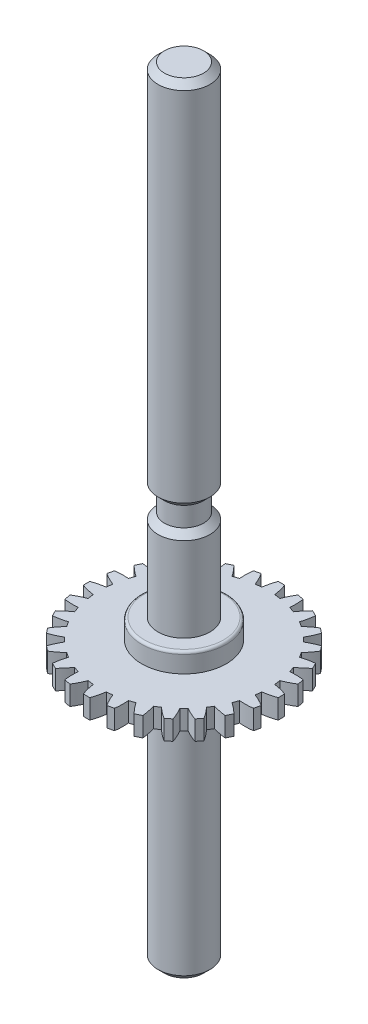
ISO-10303-21;
HEADER;
FILE_DESCRIPTION(('STEP AP214'),'2;1');
FILE_NAME('part.step','',(''),(''),'','','');
FILE_SCHEMA(('AUTOMOTIVE_DESIGN { 1 0 10303 214 1 1 1 1 }'));
ENDSEC;
DATA;
#1=APPLICATION_CONTEXT('core data for automotive mechanical design processes');
#2=APPLICATION_PROTOCOL_DEFINITION('international standard','automotive_design',2000,#1);
#3=PRODUCT_CONTEXT('',#1,'mechanical');
#4=PRODUCT('Part','Part','',(#3));
#5=PRODUCT_RELATED_PRODUCT_CATEGORY('part','',(#4));
#6=PRODUCT_DEFINITION_FORMATION('','',#4);
#7=PRODUCT_DEFINITION_CONTEXT('part definition',#1,'design');
#8=PRODUCT_DEFINITION('design','',#6,#7);
#9=PRODUCT_DEFINITION_SHAPE('','',#8);
#10=(LENGTH_UNIT() NAMED_UNIT(*) SI_UNIT(.MILLI.,.METRE.));
#11=(NAMED_UNIT(*) PLANE_ANGLE_UNIT() SI_UNIT($,.RADIAN.));
#12=(NAMED_UNIT(*) SI_UNIT($,.STERADIAN.) SOLID_ANGLE_UNIT());
#13=UNCERTAINTY_MEASURE_WITH_UNIT(LENGTH_MEASURE(1.E-05),#10,'distance_accuracy_value','');
#14=(GEOMETRIC_REPRESENTATION_CONTEXT(3) GLOBAL_UNCERTAINTY_ASSIGNED_CONTEXT((#13)) GLOBAL_UNIT_ASSIGNED_CONTEXT((#10,
#11,#12)) REPRESENTATION_CONTEXT('',''));
#15=CARTESIAN_POINT('',(0.,0.,0.));
#16=DIRECTION('',(0.,0.,1.));
#17=DIRECTION('',(1.,0.,0.));
#18=AXIS2_PLACEMENT_3D('',#15,#16,#17);
#19=CARTESIAN_POINT('',(0.,0.,0.));
#20=DIRECTION('',(0.,1.,0.));
#21=DIRECTION('',(0.,0.,1.));
#22=AXIS2_PLACEMENT_3D('',#19,#20,#21);
#23=PLANE('',#22);
#24=CARTESIAN_POINT('',(0.,0.,0.));
#25=DIRECTION('',(0.,1.,0.));
#26=DIRECTION('',(0.,0.,1.));
#27=AXIS2_PLACEMENT_3D('',#24,#25,#26);
#28=CIRCLE('',#27,6.5);
#29=CARTESIAN_POINT('',(0.499999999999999,0.,6.48074069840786));
#30=VERTEX_POINT('',#29);
#31=CARTESIAN_POINT('',(0.954636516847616,0.,6.42951546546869));
#32=VERTEX_POINT('',#31);
#33=EDGE_CURVE('E1532',#30,#32,#28,.T.);
#34=ORIENTED_EDGE('',*,*,#33,.F.);
#35=CARTESIAN_POINT('',(-4.64346386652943,0.,5.75946084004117));
#36=DIRECTION('',(0.,-1.,0.));
#37=DIRECTION('',(0.,0.,-1.));
#38=AXIS2_PLACEMENT_3D('',#35,#36,#37);
#39=CIRCLE('',#38,5.19379102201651);
#40=CARTESIAN_POINT('',(0.25,0.,7.5));
#41=VERTEX_POINT('',#40);
#42=EDGE_CURVE('E1491',#30,#41,#39,.T.);
#43=ORIENTED_EDGE('',*,*,#42,.T.);
#44=DIRECTION('',(-1.,0.,0.));
#45=VECTOR('',#44,1.);
#46=CARTESIAN_POINT('',(-0.25,0.,7.5));
#47=LINE('',#46,#45);
#48=CARTESIAN_POINT('',(-0.25,0.,7.5));
#49=VERTEX_POINT('',#48);
#50=EDGE_CURVE('E1487',#41,#49,#47,.T.);
#51=ORIENTED_EDGE('',*,*,#50,.T.);
#52=CARTESIAN_POINT('',(4.64346386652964,0.,5.75946084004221));
#53=DIRECTION('',(0.,-1.,0.));
#54=DIRECTION('',(0.,0.,1.));
#55=AXIS2_PLACEMENT_3D('',#52,#53,#54);
#56=CIRCLE('',#55,5.19379102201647);
#57=CARTESIAN_POINT('',(-0.49999999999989,0.,6.48074069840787));
#58=VERTEX_POINT('',#57);
#59=EDGE_CURVE('E1486',#49,#58,#56,.T.);
#60=ORIENTED_EDGE('',*,*,#59,.T.);
#61=CARTESIAN_POINT('',(-0.954636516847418,0.,6.42951546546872));
#62=VERTEX_POINT('',#61);
#63=EDGE_CURVE('E1526',#62,#58,#28,.T.);
#64=ORIENTED_EDGE('',*,*,#63,.F.);
#65=CARTESIAN_POINT('',(-5.80864313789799,0.,4.58179121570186));
#66=DIRECTION('',(0.,-1.,0.));
#67=DIRECTION('',(0.,0.,-1.));
#68=AXIS2_PLACEMENT_3D('',#65,#66,#67);
#69=CIRCLE('',#68,5.19379102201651);
#70=CARTESIAN_POINT('',(-1.42517502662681,0.,7.36758957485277));
#71=VERTEX_POINT('',#70);
#72=EDGE_CURVE('E740',#62,#71,#69,.T.);
#73=ORIENTED_EDGE('',*,*,#72,.T.);
#74=DIRECTION('',(-0.974927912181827,0.,-0.222520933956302));
#75=VECTOR('',#74,1.);
#76=CARTESIAN_POINT('',(-1.91263898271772,0.,7.25632910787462));
#77=LINE('',#76,#75);
#78=CARTESIAN_POINT('',(-1.91263898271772,0.,7.25632910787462));
#79=VERTEX_POINT('',#78);
#80=EDGE_CURVE('E730',#71,#79,#77,.T.);
#81=ORIENTED_EDGE('',*,*,#80,.T.);
#82=CARTESIAN_POINT('',(3.24544192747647,0.,6.64832704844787));
#83=DIRECTION('',(0.,-1.,0.));
#84=DIRECTION('',(0.,0.,1.));
#85=AXIS2_PLACEMENT_3D('',#82,#83,#84);
#86=CIRCLE('',#85,5.19379102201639);
#87=CARTESIAN_POINT('',(-1.92956442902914,0.,6.20699453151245));
#88=VERTEX_POINT('',#87);
#89=EDGE_CURVE('E737',#79,#88,#86,.T.);
#90=ORIENTED_EDGE('',*,*,#89,.T.);
#91=CARTESIAN_POINT('',(-2.36140357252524,0.,6.05588747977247));
#92=VERTEX_POINT('',#91);
#93=EDGE_CURVE('E2968',#92,#88,#28,.T.);
#94=ORIENTED_EDGE('',*,*,#93,.F.);
#95=CARTESIAN_POINT('',(-6.68255278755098,0.,3.17437144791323));
#96=DIRECTION('',(0.,-1.,0.));
#97=DIRECTION('',(0.,0.,-1.));
#98=AXIS2_PLACEMENT_3D('',#95,#96,#97);
#99=CIRCLE('',#98,5.19379102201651);
#100=CARTESIAN_POINT('',(-3.02888582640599,0.,6.86573744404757));
#101=VERTEX_POINT('',#100);
#102=EDGE_CURVE('E763',#92,#101,#99,.T.);
#103=ORIENTED_EDGE('',*,*,#102,.T.);
#104=DIRECTION('',(-0.900968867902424,0.,-0.433883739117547));
#105=VECTOR('',#104,1.);
#106=CARTESIAN_POINT('',(-3.4793702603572,0.,6.6487955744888));
#107=LINE('',#106,#105);
#108=CARTESIAN_POINT('',(-3.4793702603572,0.,6.6487955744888));
#109=VERTEX_POINT('',#108);
#110=EDGE_CURVE('E759',#101,#109,#107,.T.);
#111=ORIENTED_EDGE('',*,*,#110,.T.);
#112=CARTESIAN_POINT('',(1.68467997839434,0.,7.20381837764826));
#113=DIRECTION('',(0.,-1.,0.));
#114=DIRECTION('',(0.,0.,1.));
#115=AXIS2_PLACEMENT_3D('',#112,#113,#114);
#116=CIRCLE('',#115,5.19379102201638);
#117=CARTESIAN_POINT('',(-3.26237244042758,0.,5.62200374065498));
#118=VERTEX_POINT('',#117);
#119=EDGE_CURVE('E758',#109,#118,#116,.T.);
#120=ORIENTED_EDGE('',*,*,#119,.T.);
#121=CARTESIAN_POINT('',(-3.64975999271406,0.,5.37859200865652));
#122=VERTEX_POINT('',#121);
#123=EDGE_CURVE('E2971',#122,#118,#28,.T.);
#124=ORIENTED_EDGE('',*,*,#123,.F.);
#125=CARTESIAN_POINT('',(-7.22137133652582,0.,1.60777544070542));
#126=DIRECTION('',(0.,-1.,0.));
#127=DIRECTION('',(0.,0.,-1.));
#128=AXIS2_PLACEMENT_3D('',#125,#126,#127);
#129=CIRCLE('',#128,5.19379102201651);
#130=CARTESIAN_POINT('',(-4.48071564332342,0.,6.01960856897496));
#131=VERTEX_POINT('',#130);
#132=EDGE_CURVE('E791',#122,#131,#129,.T.);
#133=ORIENTED_EDGE('',*,*,#132,.T.);
#134=DIRECTION('',(-0.781831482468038,0.,-0.623489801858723));
#135=VECTOR('',#134,1.);
#136=CARTESIAN_POINT('',(-4.87163138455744,0.,5.7078636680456));
#137=LINE('',#136,#135);
#138=CARTESIAN_POINT('',(-4.87163138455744,0.,5.7078636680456));
#139=VERTEX_POINT('',#138);
#140=EDGE_CURVE('E787',#131,#139,#137,.T.);
#141=ORIENTED_EDGE('',*,*,#140,.T.);
#142=CARTESIAN_POINT('',(0.039441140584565,0.,7.39808017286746));
#143=DIRECTION('',(0.,-1.,0.));
#144=DIRECTION('',(0.,0.,1.));
#145=AXIS2_PLACEMENT_3D('',#142,#143,#144);
#146=CIRCLE('',#145,5.19379102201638);
#147=CARTESIAN_POINT('',(-4.43159147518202,0.,4.75510220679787));
#148=VERTEX_POINT('',#147);
#149=EDGE_CURVE('E786',#139,#148,#146,.T.);
#150=ORIENTED_EDGE('',*,*,#149,.T.);
#151=CARTESIAN_POINT('',(-4.75510220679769,0.,4.43159147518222));
#152=VERTEX_POINT('',#151);
#153=EDGE_CURVE('E2972',#152,#148,#28,.T.);
#154=ORIENTED_EDGE('',*,*,#153,.F.);
#155=CARTESIAN_POINT('',(-7.39808017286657,0.,-0.0394411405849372));
#156=DIRECTION('',(0.,-1.,0.));
#157=DIRECTION('',(0.,0.,-1.));
#158=AXIS2_PLACEMENT_3D('',#155,#156,#157);
#159=CIRCLE('',#158,5.19379102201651);
#160=CARTESIAN_POINT('',(-5.70786366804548,0.,4.87163138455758));
#161=VERTEX_POINT('',#160);
#162=EDGE_CURVE('E819',#152,#161,#159,.T.);
#163=ORIENTED_EDGE('',*,*,#162,.T.);
#164=DIRECTION('',(-0.623489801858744,0.,-0.781831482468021));
#165=VECTOR('',#164,1.);
#166=CARTESIAN_POINT('',(-6.01960856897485,0.,4.48071564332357));
#167=LINE('',#166,#165);
#168=CARTESIAN_POINT('',(-6.01960856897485,0.,4.48071564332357));
#169=VERTEX_POINT('',#168);
#170=EDGE_CURVE('E815',#161,#169,#167,.T.);
#171=ORIENTED_EDGE('',*,*,#170,.T.);
#172=CARTESIAN_POINT('',(-1.60777544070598,0.,7.22137133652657));
#173=DIRECTION('',(0.,-1.,0.));
#174=DIRECTION('',(0.,0.,1.));
#175=AXIS2_PLACEMENT_3D('',#172,#173,#174);
#176=CIRCLE('',#175,5.19379102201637);
#177=CARTESIAN_POINT('',(-5.37859200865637,0.,3.64975999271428));
#178=VERTEX_POINT('',#177);
#179=EDGE_CURVE('E814',#169,#178,#176,.T.);
#180=ORIENTED_EDGE('',*,*,#179,.T.);
#181=CARTESIAN_POINT('',(-5.62200374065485,0.,3.26237244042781));
#182=VERTEX_POINT('',#181);
#183=EDGE_CURVE('E3212',#182,#178,#28,.T.);
#184=ORIENTED_EDGE('',*,*,#183,.F.);
#185=CARTESIAN_POINT('',(-7.20381837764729,0.,-1.68467997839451));
#186=DIRECTION('',(0.,-1.,0.));
#187=DIRECTION('',(0.,0.,-1.));
#188=AXIS2_PLACEMENT_3D('',#185,#186,#187);
#189=CIRCLE('',#188,5.19379102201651);
#190=CARTESIAN_POINT('',(-6.64879557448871,0.,3.47937026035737));
#191=VERTEX_POINT('',#190);
#192=EDGE_CURVE('E847',#182,#191,#189,.T.);
#193=ORIENTED_EDGE('',*,*,#192,.T.);
#194=DIRECTION('',(-0.433883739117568,0.,-0.900968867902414));
#195=VECTOR('',#194,1.);
#196=CARTESIAN_POINT('',(-6.8657374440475,0.,3.02888582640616));
#197=LINE('',#196,#195);
#198=CARTESIAN_POINT('',(-6.8657374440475,0.,3.02888582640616));
#199=VERTEX_POINT('',#198);
#200=EDGE_CURVE('E843',#191,#199,#197,.T.);
#201=ORIENTED_EDGE('',*,*,#200,.T.);
#202=CARTESIAN_POINT('',(-3.17437144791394,0.,6.68255278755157));
#203=DIRECTION('',(0.,-1.,0.));
#204=DIRECTION('',(0.,0.,1.));
#205=AXIS2_PLACEMENT_3D('',#202,#203,#204);
#206=CIRCLE('',#205,5.19379102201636);
#207=CARTESIAN_POINT('',(-6.05588747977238,0.,2.36140357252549));
#208=VERTEX_POINT('',#207);
#209=EDGE_CURVE('E842',#199,#208,#206,.T.);
#210=ORIENTED_EDGE('',*,*,#209,.T.);
#211=CARTESIAN_POINT('',(-6.20699453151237,0.,1.92956442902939));
#212=VERTEX_POINT('',#211);
#213=EDGE_CURVE('E3205',#212,#208,#28,.T.);
#214=ORIENTED_EDGE('',*,*,#213,.F.);
#215=CARTESIAN_POINT('',(-6.64832704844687,0.,-3.24544192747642));
#216=DIRECTION('',(0.,-1.,0.));
#217=DIRECTION('',(0.,0.,-1.));
#218=AXIS2_PLACEMENT_3D('',#215,#216,#217);
#219=CIRCLE('',#218,5.19379102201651);
#220=CARTESIAN_POINT('',(-7.25632910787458,0.,1.91263898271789));
#221=VERTEX_POINT('',#220);
#222=EDGE_CURVE('E875',#212,#221,#219,.T.);
#223=ORIENTED_EDGE('',*,*,#222,.T.);
#224=DIRECTION('',(-0.222520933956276,0.,-0.974927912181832));
#225=VECTOR('',#224,1.);
#226=CARTESIAN_POINT('',(-7.36758957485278,0.,1.42517502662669));
#227=LINE('',#226,#225);
#228=CARTESIAN_POINT('',(-7.36758957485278,0.,1.42517502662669));
#229=VERTEX_POINT('',#228);
#230=EDGE_CURVE('E871',#221,#229,#227,.T.);
#231=ORIENTED_EDGE('',*,*,#230,.T.);
#232=CARTESIAN_POINT('',(-4.58179121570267,0.,5.80864313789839));
#233=DIRECTION('',(0.,-1.,0.));
#234=DIRECTION('',(0.,0.,1.));
#235=AXIS2_PLACEMENT_3D('',#232,#233,#234);
#236=CIRCLE('',#235,5.19379102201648);
#237=CARTESIAN_POINT('',(-6.4295154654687,0.,0.954636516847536));
#238=VERTEX_POINT('',#237);
#239=EDGE_CURVE('E870',#229,#238,#236,.T.);
#240=ORIENTED_EDGE('',*,*,#239,.T.);
#241=CARTESIAN_POINT('',(-6.48074069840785,0.,0.500000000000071));
#242=VERTEX_POINT('',#241);
#243=EDGE_CURVE('E3198',#242,#238,#28,.T.);
#244=ORIENTED_EDGE('',*,*,#243,.F.);
#245=CARTESIAN_POINT('',(-5.75946084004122,0.,-4.64346386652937));
#246=DIRECTION('',(0.,-1.,0.));
#247=DIRECTION('',(0.,0.,-1.));
#248=AXIS2_PLACEMENT_3D('',#245,#246,#247);
#249=CIRCLE('',#248,5.19379102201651);
#250=CARTESIAN_POINT('',(-7.49999999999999,0.,0.250000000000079));
#251=VERTEX_POINT('',#250);
#252=EDGE_CURVE('E903',#242,#251,#249,.T.);
#253=ORIENTED_EDGE('',*,*,#252,.T.);
#254=DIRECTION('',(0.,0.,-1.));
#255=VECTOR('',#254,1.);
#256=CARTESIAN_POINT('',(-7.49999999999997,0.,-0.250000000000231));
#257=LINE('',#256,#255);
#258=CARTESIAN_POINT('',(-7.49999999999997,0.,-0.250000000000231));
#259=VERTEX_POINT('',#258);
#260=EDGE_CURVE('E899',#251,#259,#257,.T.);
#261=ORIENTED_EDGE('',*,*,#260,.T.);
#262=CARTESIAN_POINT('',(-5.75946084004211,0.,4.64346386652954));
#263=DIRECTION('',(0.,-1.,0.));
#264=DIRECTION('',(0.,0.,1.));
#265=AXIS2_PLACEMENT_3D('',#262,#263,#264);
#266=CIRCLE('',#265,5.19379102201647);
#267=CARTESIAN_POINT('',(-6.48074069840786,0.,-0.499999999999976));
#268=VERTEX_POINT('',#267);
#269=EDGE_CURVE('E898',#259,#268,#266,.T.);
#270=ORIENTED_EDGE('',*,*,#269,.T.);
#271=CARTESIAN_POINT('',(-6.42951546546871,0.,-0.954636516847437));
#272=VERTEX_POINT('',#271);
#273=EDGE_CURVE('E3191',#272,#268,#28,.T.);
#274=ORIENTED_EDGE('',*,*,#273,.F.);
#275=CARTESIAN_POINT('',(-4.58179121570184,0.,-5.80864313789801));
#276=DIRECTION('',(0.,-1.,0.));
#277=DIRECTION('',(0.,0.,-1.));
#278=AXIS2_PLACEMENT_3D('',#275,#276,#277);
#279=CIRCLE('',#278,5.19379102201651);
#280=CARTESIAN_POINT('',(-7.36758957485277,0.,-1.42517502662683));
#281=VERTEX_POINT('',#280);
#282=EDGE_CURVE('E931',#272,#281,#279,.T.);
#283=ORIENTED_EDGE('',*,*,#282,.T.);
#284=DIRECTION('',(0.222520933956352,0.,-0.974927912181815));
#285=VECTOR('',#284,1.);
#286=CARTESIAN_POINT('',(-7.25632910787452,0.,-1.91263898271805));
#287=LINE('',#286,#285);
#288=CARTESIAN_POINT('',(-7.25632910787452,0.,-1.91263898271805));
#289=VERTEX_POINT('',#288);
#290=EDGE_CURVE('E927',#281,#289,#287,.T.);
#291=ORIENTED_EDGE('',*,*,#290,.T.);
#292=CARTESIAN_POINT('',(-6.64832704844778,0.,3.24544192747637));
#293=DIRECTION('',(0.,-1.,0.));
#294=DIRECTION('',(0.,0.,1.));
#295=AXIS2_PLACEMENT_3D('',#292,#293,#294);
#296=CIRCLE('',#295,5.19379102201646);
#297=CARTESIAN_POINT('',(-6.20699453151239,0.,-1.92956442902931));
#298=VERTEX_POINT('',#297);
#299=EDGE_CURVE('E926',#289,#298,#296,.T.);
#300=ORIENTED_EDGE('',*,*,#299,.T.);
#301=CARTESIAN_POINT('',(-6.05588747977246,0.,-2.36140357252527));
#302=VERTEX_POINT('',#301);
#303=EDGE_CURVE('E3184',#302,#298,#28,.T.);
#304=ORIENTED_EDGE('',*,*,#303,.F.);
#305=CARTESIAN_POINT('',(-3.17437144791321,0.,-6.68255278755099));
#306=DIRECTION('',(0.,-1.,0.));
#307=DIRECTION('',(0.,0.,-1.));
#308=AXIS2_PLACEMENT_3D('',#305,#306,#307);
#309=CIRCLE('',#308,5.19379102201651);
#310=CARTESIAN_POINT('',(-6.86573744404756,0.,-3.02888582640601));
#311=VERTEX_POINT('',#310);
#312=EDGE_CURVE('E959',#302,#311,#309,.T.);
#313=ORIENTED_EDGE('',*,*,#312,.T.);
#314=DIRECTION('',(0.43388373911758,0.,-0.900968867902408));
#315=VECTOR('',#314,1.);
#316=CARTESIAN_POINT('',(-6.64879557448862,0.,-3.47937026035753));
#317=LINE('',#316,#315);
#318=CARTESIAN_POINT('',(-6.64879557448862,0.,-3.47937026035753));
#319=VERTEX_POINT('',#318);
#320=EDGE_CURVE('E955',#311,#319,#317,.T.);
#321=ORIENTED_EDGE('',*,*,#320,.T.);
#322=CARTESIAN_POINT('',(-7.20381837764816,0.,1.68467997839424));
#323=DIRECTION('',(0.,-1.,0.));
#324=DIRECTION('',(0.,0.,1.));
#325=AXIS2_PLACEMENT_3D('',#322,#323,#324);
#326=CIRCLE('',#325,5.19379102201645);
#327=CARTESIAN_POINT('',(-5.62200374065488,0.,-3.26237244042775));
#328=VERTEX_POINT('',#327);
#329=EDGE_CURVE('E954',#319,#328,#326,.T.);
#330=ORIENTED_EDGE('',*,*,#329,.T.);
#331=CARTESIAN_POINT('',(-5.37859200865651,0.,-3.64975999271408));
#332=VERTEX_POINT('',#331);
#333=EDGE_CURVE('E3177',#332,#328,#28,.T.);
#334=ORIENTED_EDGE('',*,*,#333,.F.);
#335=CARTESIAN_POINT('',(-1.60777544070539,0.,-7.22137133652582));
#336=DIRECTION('',(0.,-1.,0.));
#337=DIRECTION('',(0.,0.,-1.));
#338=AXIS2_PLACEMENT_3D('',#335,#336,#337);
#339=CIRCLE('',#338,5.19379102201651);
#340=CARTESIAN_POINT('',(-6.01960856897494,0.,-4.48071564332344));
#341=VERTEX_POINT('',#340);
#342=EDGE_CURVE('E987',#332,#341,#339,.T.);
#343=ORIENTED_EDGE('',*,*,#342,.T.);
#344=DIRECTION('',(0.623489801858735,0.,-0.781831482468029));
#345=VECTOR('',#344,1.);
#346=CARTESIAN_POINT('',(-5.70786366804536,0.,-4.87163138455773));
#347=LINE('',#346,#345);
#348=CARTESIAN_POINT('',(-5.70786366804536,0.,-4.87163138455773));
#349=VERTEX_POINT('',#348);
#350=EDGE_CURVE('E983',#341,#349,#347,.T.);
#351=ORIENTED_EDGE('',*,*,#350,.T.);
#352=CARTESIAN_POINT('',(-7.39808017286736,0.,0.0394411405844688));
#353=DIRECTION('',(0.,-1.,0.));
#354=DIRECTION('',(0.,0.,1.));
#355=AXIS2_PLACEMENT_3D('',#352,#353,#354);
#356=CIRCLE('',#355,5.19379102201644);
#357=CARTESIAN_POINT('',(-4.75510220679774,0.,-4.43159147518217));
#358=VERTEX_POINT('',#357);
#359=EDGE_CURVE('E982',#349,#358,#356,.T.);
#360=ORIENTED_EDGE('',*,*,#359,.T.);
#361=CARTESIAN_POINT('',(-4.4315914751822,0.,-4.75510220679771));
#362=VERTEX_POINT('',#361);
#363=EDGE_CURVE('E3170',#362,#358,#28,.T.);
#364=ORIENTED_EDGE('',*,*,#363,.F.);
#365=CARTESIAN_POINT('',(0.0394411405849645,0.,-7.39808017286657));
#366=DIRECTION('',(0.,-1.,0.));
#367=DIRECTION('',(0.,0.,-1.));
#368=AXIS2_PLACEMENT_3D('',#365,#366,#367);
#369=CIRCLE('',#368,5.19379102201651);
#370=CARTESIAN_POINT('',(-4.87163138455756,0.,-5.70786366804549));
#371=VERTEX_POINT('',#370);
#372=EDGE_CURVE('E1015',#362,#371,#369,.T.);
#373=ORIENTED_EDGE('',*,*,#372,.T.);
#374=DIRECTION('',(0.781831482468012,0.,-0.623489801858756));
#375=VECTOR('',#374,1.);
#376=CARTESIAN_POINT('',(-4.48071564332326,0.,-6.01960856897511));
#377=LINE('',#376,#375);
#378=CARTESIAN_POINT('',(-4.48071564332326,0.,-6.01960856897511));
#379=VERTEX_POINT('',#378);
#380=EDGE_CURVE('E1011',#371,#379,#377,.T.);
#381=ORIENTED_EDGE('',*,*,#380,.T.);
#382=CARTESIAN_POINT('',(-7.22137133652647,0.,-1.60777544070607));
#383=DIRECTION('',(0.,-1.,0.));
#384=DIRECTION('',(0.,0.,1.));
#385=AXIS2_PLACEMENT_3D('',#382,#383,#384);
#386=CIRCLE('',#385,5.19379102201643);
#387=CARTESIAN_POINT('',(-3.64975999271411,0.,-5.37859200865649));
#388=VERTEX_POINT('',#387);
#389=EDGE_CURVE('E1010',#379,#388,#386,.T.);
#390=ORIENTED_EDGE('',*,*,#389,.T.);
#391=CARTESIAN_POINT('',(-3.26237244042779,0.,-5.62200374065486));
#392=VERTEX_POINT('',#391);
#393=EDGE_CURVE('E3163',#392,#388,#28,.T.);
#394=ORIENTED_EDGE('',*,*,#393,.F.);
#395=CARTESIAN_POINT('',(1.68467997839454,0.,-7.20381837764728));
#396=DIRECTION('',(0.,-1.,0.));
#397=DIRECTION('',(0.,0.,-1.));
#398=AXIS2_PLACEMENT_3D('',#395,#396,#397);
#399=CIRCLE('',#398,5.19379102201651);
#400=CARTESIAN_POINT('',(-3.47937026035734,0.,-6.64879557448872));
#401=VERTEX_POINT('',#400);
#402=EDGE_CURVE('E1043',#392,#401,#399,.T.);
#403=ORIENTED_EDGE('',*,*,#402,.T.);
#404=DIRECTION('',(0.900968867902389,0.,-0.43388373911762));
#405=VECTOR('',#404,1.);
#406=CARTESIAN_POINT('',(-3.02888582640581,0.,-6.8657374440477));
#407=LINE('',#406,#405);
#408=CARTESIAN_POINT('',(-3.02888582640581,0.,-6.8657374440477));
#409=VERTEX_POINT('',#408);
#410=EDGE_CURVE('E1039',#401,#409,#407,.T.);
#411=ORIENTED_EDGE('',*,*,#410,.T.);
#412=CARTESIAN_POINT('',(-6.68255278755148,0.,-3.17437144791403));
#413=DIRECTION('',(0.,-1.,0.));
#414=DIRECTION('',(0.,0.,1.));
#415=AXIS2_PLACEMENT_3D('',#412,#413,#414);
#416=CIRCLE('',#415,5.19379102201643);
#417=CARTESIAN_POINT('',(-2.3614035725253,0.,-6.05588747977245));
#418=VERTEX_POINT('',#417);
#419=EDGE_CURVE('E1038',#409,#418,#416,.T.);
#420=ORIENTED_EDGE('',*,*,#419,.T.);
#421=CARTESIAN_POINT('',(-1.92956442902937,0.,-6.20699453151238));
#422=VERTEX_POINT('',#421);
#423=EDGE_CURVE('E3156',#422,#418,#28,.T.);
#424=ORIENTED_EDGE('',*,*,#423,.F.);
#425=CARTESIAN_POINT('',(3.24544192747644,0.,-6.64832704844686));
#426=DIRECTION('',(0.,-1.,0.));
#427=DIRECTION('',(0.,0.,-1.));
#428=AXIS2_PLACEMENT_3D('',#425,#426,#427);
#429=CIRCLE('',#428,5.19379102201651);
#430=CARTESIAN_POINT('',(-1.91263898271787,0.,-7.25632910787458));
#431=VERTEX_POINT('',#430);
#432=EDGE_CURVE('E1071',#422,#431,#429,.T.);
#433=ORIENTED_EDGE('',*,*,#432,.T.);
#434=DIRECTION('',(0.974927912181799,0.,-0.222520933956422));
#435=VECTOR('',#434,1.);
#436=CARTESIAN_POINT('',(-1.4251750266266,0.,-7.36758957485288));
#437=LINE('',#436,#435);
#438=CARTESIAN_POINT('',(-1.4251750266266,0.,-7.36758957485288));
#439=VERTEX_POINT('',#438);
#440=EDGE_CURVE('E1067',#431,#439,#437,.T.);
#441=ORIENTED_EDGE('',*,*,#440,.T.);
#442=CARTESIAN_POINT('',(-5.8086431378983,0.,-4.58179121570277));
#443=DIRECTION('',(0.,-1.,0.));
#444=DIRECTION('',(0.,0.,1.));
#445=AXIS2_PLACEMENT_3D('',#442,#443,#444);
#446=CIRCLE('',#445,5.19379102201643);
#447=CARTESIAN_POINT('',(-0.954636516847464,0.,-6.42951546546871));
#448=VERTEX_POINT('',#447);
#449=EDGE_CURVE('E1066',#439,#448,#446,.T.);
#450=ORIENTED_EDGE('',*,*,#449,.T.);
#451=CARTESIAN_POINT('',(-0.500000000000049,0.,-6.48074069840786));
#452=VERTEX_POINT('',#451);
#453=EDGE_CURVE('E3149',#452,#448,#28,.T.);
#454=ORIENTED_EDGE('',*,*,#453,.F.);
#455=CARTESIAN_POINT('',(4.64346386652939,0.,-5.7594608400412));
#456=DIRECTION('',(0.,-1.,0.));
#457=DIRECTION('',(0.,0.,-1.));
#458=AXIS2_PLACEMENT_3D('',#455,#456,#457);
#459=CIRCLE('',#458,5.19379102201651);
#460=CARTESIAN_POINT('',(-0.250000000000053,0.,-7.5));
#461=VERTEX_POINT('',#460);
#462=EDGE_CURVE('E1099',#452,#461,#459,.T.);
#463=ORIENTED_EDGE('',*,*,#462,.T.);
#464=DIRECTION('',(1.,0.,-1.54390389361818E-13));
#465=VECTOR('',#464,1.);
#466=CARTESIAN_POINT('',(0.250000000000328,0.,-7.50000000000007));
#467=LINE('',#466,#465);
#468=CARTESIAN_POINT('',(0.250000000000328,0.,-7.50000000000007));
#469=VERTEX_POINT('',#468);
#470=EDGE_CURVE('E1095',#461,#469,#467,.T.);
#471=ORIENTED_EDGE('',*,*,#470,.T.);
#472=CARTESIAN_POINT('',(-4.64346386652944,0.,-5.75946084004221));
#473=DIRECTION('',(0.,-1.,0.));
#474=DIRECTION('',(0.,0.,1.));
#475=AXIS2_PLACEMENT_3D('',#472,#473,#474);
#476=CIRCLE('',#475,5.19379102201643);
#477=CARTESIAN_POINT('',(0.500000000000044,0.,-6.48074069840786));
#478=VERTEX_POINT('',#477);
#479=EDGE_CURVE('E1094',#469,#478,#476,.T.);
#480=ORIENTED_EDGE('',*,*,#479,.T.);
#481=CARTESIAN_POINT('',(0.95463651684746,0.,-6.42951546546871));
#482=VERTEX_POINT('',#481);
#483=EDGE_CURVE('E3142',#482,#478,#28,.T.);
#484=ORIENTED_EDGE('',*,*,#483,.F.);
#485=CARTESIAN_POINT('',(5.80864313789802,0.,-4.58179121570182));
#486=DIRECTION('',(0.,-1.,0.));
#487=DIRECTION('',(0.,0.,-1.));
#488=AXIS2_PLACEMENT_3D('',#485,#486,#487);
#489=CIRCLE('',#488,5.19379102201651);
#490=CARTESIAN_POINT('',(1.42517502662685,0.,-7.36758957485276));
#491=VERTEX_POINT('',#490);
#492=EDGE_CURVE('E1127',#482,#491,#489,.T.);
#493=ORIENTED_EDGE('',*,*,#492,.T.);
#494=DIRECTION('',(0.974927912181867,0.,0.222520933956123));
#495=VECTOR('',#494,1.);
#496=CARTESIAN_POINT('',(1.91263898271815,0.,-7.25632910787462));
#497=LINE('',#496,#495);
#498=CARTESIAN_POINT('',(1.91263898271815,0.,-7.25632910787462));
#499=VERTEX_POINT('',#498);
#500=EDGE_CURVE('E1123',#491,#499,#497,.T.);
#501=ORIENTED_EDGE('',*,*,#500,.T.);
#502=CARTESIAN_POINT('',(-3.24544192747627,0.,-6.64832704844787));
#503=DIRECTION('',(0.,-1.,0.));
#504=DIRECTION('',(0.,0.,1.));
#505=AXIS2_PLACEMENT_3D('',#502,#503,#504);
#506=CIRCLE('',#505,5.19379102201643);
#507=CARTESIAN_POINT('',(1.92956442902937,0.,-6.20699453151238));
#508=VERTEX_POINT('',#507);
#509=EDGE_CURVE('E1122',#499,#508,#506,.T.);
#510=ORIENTED_EDGE('',*,*,#509,.T.);
#511=CARTESIAN_POINT('',(2.36140357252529,0.,-6.05588747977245));
#512=VERTEX_POINT('',#511);
#513=EDGE_CURVE('E3135',#512,#508,#28,.T.);
#514=ORIENTED_EDGE('',*,*,#513,.F.);
#515=CARTESIAN_POINT('',(6.682552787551,0.,-3.17437144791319));
#516=DIRECTION('',(0.,-1.,0.));
#517=DIRECTION('',(0.,0.,-1.));
#518=AXIS2_PLACEMENT_3D('',#515,#516,#517);
#519=CIRCLE('',#518,5.19379102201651);
#520=CARTESIAN_POINT('',(3.02888582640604,0.,-6.86573744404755));
#521=VERTEX_POINT('',#520);
#522=EDGE_CURVE('E1155',#512,#521,#519,.T.);
#523=ORIENTED_EDGE('',*,*,#522,.T.);
#524=DIRECTION('',(0.900968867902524,0.,0.43388373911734));
#525=VECTOR('',#524,1.);
#526=CARTESIAN_POINT('',(3.47937026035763,0.,-6.64879557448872));
#527=LINE('',#526,#525);
#528=CARTESIAN_POINT('',(3.47937026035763,0.,-6.64879557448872));
#529=VERTEX_POINT('',#528);
#530=EDGE_CURVE('E1151',#521,#529,#527,.T.);
#531=ORIENTED_EDGE('',*,*,#530,.T.);
#532=CARTESIAN_POINT('',(-1.68467997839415,0.,-7.20381837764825));
#533=DIRECTION('',(0.,-1.,0.));
#534=DIRECTION('',(0.,0.,1.));
#535=AXIS2_PLACEMENT_3D('',#532,#533,#534);
#536=CIRCLE('',#535,5.19379102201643);
#537=CARTESIAN_POINT('',(3.26237244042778,0.,-5.62200374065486));
#538=VERTEX_POINT('',#537);
#539=EDGE_CURVE('E1150',#529,#538,#536,.T.);
#540=ORIENTED_EDGE('',*,*,#539,.T.);
#541=CARTESIAN_POINT('',(3.6497599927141,0.,-5.3785920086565));
#542=VERTEX_POINT('',#541);
#543=EDGE_CURVE('E3128',#542,#538,#28,.T.);
#544=ORIENTED_EDGE('',*,*,#543,.F.);
#545=CARTESIAN_POINT('',(7.22137133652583,0.,-1.60777544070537));
#546=DIRECTION('',(0.,-1.,0.));
#547=DIRECTION('',(0.,0.,-1.));
#548=AXIS2_PLACEMENT_3D('',#545,#546,#547);
#549=CIRCLE('',#548,5.19379102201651);
#550=CARTESIAN_POINT('',(4.48071564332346,0.,-6.01960856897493));
#551=VERTEX_POINT('',#550);
#552=EDGE_CURVE('E1183',#542,#551,#549,.T.);
#553=ORIENTED_EDGE('',*,*,#552,.T.);
#554=DIRECTION('',(0.781831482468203,0.,0.623489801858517));
#555=VECTOR('',#554,1.);
#556=CARTESIAN_POINT('',(4.87163138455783,0.,-5.70786366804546));
#557=LINE('',#556,#555);
#558=CARTESIAN_POINT('',(4.87163138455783,0.,-5.70786366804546));
#559=VERTEX_POINT('',#558);
#560=EDGE_CURVE('E1179',#551,#559,#557,.T.);
#561=ORIENTED_EDGE('',*,*,#560,.T.);
#562=CARTESIAN_POINT('',(-0.0394411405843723,0.,-7.39808017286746));
#563=DIRECTION('',(0.,-1.,0.));
#564=DIRECTION('',(0.,0.,1.));
#565=AXIS2_PLACEMENT_3D('',#562,#563,#564);
#566=CIRCLE('',#565,5.19379102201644);
#567=CARTESIAN_POINT('',(4.43159147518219,0.,-4.75510220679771));
#568=VERTEX_POINT('',#567);
#569=EDGE_CURVE('E1178',#559,#568,#566,.T.);
#570=ORIENTED_EDGE('',*,*,#569,.T.);
#571=CARTESIAN_POINT('',(4.75510220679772,0.,-4.43159147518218));
#572=VERTEX_POINT('',#571);
#573=EDGE_CURVE('E3121',#572,#568,#28,.T.);
#574=ORIENTED_EDGE('',*,*,#573,.F.);
#575=CARTESIAN_POINT('',(7.39808017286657,0.,0.0394411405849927));
#576=DIRECTION('',(0.,-1.,0.));
#577=DIRECTION('',(0.,0.,-1.));
#578=AXIS2_PLACEMENT_3D('',#575,#576,#577);
#579=CIRCLE('',#578,5.19379102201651);
#580=CARTESIAN_POINT('',(5.70786366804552,0.,-4.87163138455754));
#581=VERTEX_POINT('',#580);
#582=EDGE_CURVE('E1211',#572,#581,#579,.T.);
#583=ORIENTED_EDGE('',*,*,#582,.T.);
#584=DIRECTION('',(0.623489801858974,0.,0.781831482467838));
#585=VECTOR('',#584,1.);
#586=CARTESIAN_POINT('',(6.01960856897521,0.,-4.48071564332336));
#587=LINE('',#586,#585);
#588=CARTESIAN_POINT('',(6.01960856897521,0.,-4.48071564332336));
#589=VERTEX_POINT('',#588);
#590=EDGE_CURVE('E1207',#581,#589,#587,.T.);
#591=ORIENTED_EDGE('',*,*,#590,.T.);
#592=CARTESIAN_POINT('',(1.60777544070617,0.,-7.22137133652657));
#593=DIRECTION('',(0.,-1.,0.));
#594=DIRECTION('',(0.,0.,1.));
#595=AXIS2_PLACEMENT_3D('',#592,#593,#594);
#596=CIRCLE('',#595,5.19379102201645);
#597=CARTESIAN_POINT('',(5.3785920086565,0.,-3.6497599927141));
#598=VERTEX_POINT('',#597);
#599=EDGE_CURVE('E1206',#589,#598,#596,.T.);
#600=ORIENTED_EDGE('',*,*,#599,.T.);
#601=CARTESIAN_POINT('',(5.62200374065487,0.,-3.26237244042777));
#602=VERTEX_POINT('',#601);
#603=EDGE_CURVE('E3114',#602,#598,#28,.T.);
#604=ORIENTED_EDGE('',*,*,#603,.F.);
#605=CARTESIAN_POINT('',(7.20381837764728,0.,1.68467997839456));
#606=DIRECTION('',(0.,-1.,0.));
#607=DIRECTION('',(0.,0.,-1.));
#608=AXIS2_PLACEMENT_3D('',#605,#606,#607);
#609=CIRCLE('',#608,5.19379102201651);
#610=CARTESIAN_POINT('',(6.64879557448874,0.,-3.47937026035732));
#611=VERTEX_POINT('',#610);
#612=EDGE_CURVE('E1239',#602,#611,#609,.T.);
#613=ORIENTED_EDGE('',*,*,#612,.T.);
#614=DIRECTION('',(0.433883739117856,0.,0.900968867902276));
#615=VECTOR('',#614,1.);
#616=CARTESIAN_POINT('',(6.8657374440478,0.,-3.02888582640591));
#617=LINE('',#616,#615);
#618=CARTESIAN_POINT('',(6.8657374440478,0.,-3.02888582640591));
#619=VERTEX_POINT('',#618);
#620=EDGE_CURVE('E1235',#611,#619,#617,.T.);
#621=ORIENTED_EDGE('',*,*,#620,.T.);
#622=CARTESIAN_POINT('',(3.17437144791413,0.,-6.68255278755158));
#623=DIRECTION('',(0.,-1.,0.));
#624=DIRECTION('',(0.,0.,1.));
#625=AXIS2_PLACEMENT_3D('',#622,#623,#624);
#626=CIRCLE('',#625,5.19379102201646);
#627=CARTESIAN_POINT('',(6.05588747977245,0.,-2.3614035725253));
#628=VERTEX_POINT('',#627);
#629=EDGE_CURVE('E1234',#619,#628,#626,.T.);
#630=ORIENTED_EDGE('',*,*,#629,.T.);
#631=CARTESIAN_POINT('',(6.20699453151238,0.,-1.92956442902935));
#632=VERTEX_POINT('',#631);
#633=EDGE_CURVE('E3107',#632,#628,#28,.T.);
#634=ORIENTED_EDGE('',*,*,#633,.F.);
#635=CARTESIAN_POINT('',(6.64832704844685,0.,3.24544192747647));
#636=DIRECTION('',(0.,-1.,0.));
#637=DIRECTION('',(0.,0.,-1.));
#638=AXIS2_PLACEMENT_3D('',#635,#636,#637);
#639=CIRCLE('',#638,5.19379102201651);
#640=CARTESIAN_POINT('',(7.25632910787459,0.,-1.91263898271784));
#641=VERTEX_POINT('',#640);
#642=EDGE_CURVE('E1267',#632,#641,#639,.T.);
#643=ORIENTED_EDGE('',*,*,#642,.T.);
#644=DIRECTION('',(0.22252093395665,0.,0.974927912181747));
#645=VECTOR('',#644,1.);
#646=CARTESIAN_POINT('',(7.36758957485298,0.,-1.42517502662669));
#647=LINE('',#646,#645);
#648=CARTESIAN_POINT('',(7.36758957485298,0.,-1.42517502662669));
#649=VERTEX_POINT('',#648);
#650=EDGE_CURVE('E1263',#641,#649,#647,.T.);
#651=ORIENTED_EDGE('',*,*,#650,.T.);
#652=CARTESIAN_POINT('',(4.58179121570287,0.,-5.8086431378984));
#653=DIRECTION('',(0.,-1.,0.));
#654=DIRECTION('',(0.,0.,1.));
#655=AXIS2_PLACEMENT_3D('',#652,#653,#654);
#656=CIRCLE('',#655,5.19379102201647);
#657=CARTESIAN_POINT('',(6.42951546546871,0.,-0.954636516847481));
#658=VERTEX_POINT('',#657);
#659=EDGE_CURVE('E1262',#649,#658,#656,.T.);
#660=ORIENTED_EDGE('',*,*,#659,.T.);
#661=CARTESIAN_POINT('',(6.48074069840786,0.,-0.500000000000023));
#662=VERTEX_POINT('',#661);
#663=EDGE_CURVE('E3100',#662,#658,#28,.T.);
#664=ORIENTED_EDGE('',*,*,#663,.F.);
#665=CARTESIAN_POINT('',(5.75946084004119,0.,4.64346386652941));
#666=DIRECTION('',(0.,-1.,0.));
#667=DIRECTION('',(0.,0.,-1.));
#668=AXIS2_PLACEMENT_3D('',#665,#666,#667);
#669=CIRCLE('',#668,5.19379102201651);
#670=CARTESIAN_POINT('',(7.5,0.,-0.250000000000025));
#671=VERTEX_POINT('',#670);
#672=EDGE_CURVE('E1295',#662,#671,#669,.T.);
#673=ORIENTED_EDGE('',*,*,#672,.T.);
#674=DIRECTION('',(3.50414142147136E-13,0.,1.));
#675=VECTOR('',#674,1.);
#676=CARTESIAN_POINT('',(7.50000000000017,0.,0.25000000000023));
#677=LINE('',#676,#675);
#678=CARTESIAN_POINT('',(7.50000000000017,0.,0.25000000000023));
#679=VERTEX_POINT('',#678);
#680=EDGE_CURVE('E1291',#671,#679,#677,.T.);
#681=ORIENTED_EDGE('',*,*,#680,.T.);
#682=CARTESIAN_POINT('',(5.7594608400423,0.,-4.64346386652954));
#683=DIRECTION('',(0.,-1.,0.));
#684=DIRECTION('',(0.,0.,1.));
#685=AXIS2_PLACEMENT_3D('',#682,#683,#684);
#686=CIRCLE('',#685,5.19379102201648);
#687=CARTESIAN_POINT('',(6.48074069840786,0.,0.500000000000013));
#688=VERTEX_POINT('',#687);
#689=EDGE_CURVE('E1290',#679,#688,#686,.T.);
#690=ORIENTED_EDGE('',*,*,#689,.T.);
#691=CARTESIAN_POINT('',(6.42951546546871,0.,0.954636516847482));
#692=VERTEX_POINT('',#691);
#693=EDGE_CURVE('E3093',#692,#688,#28,.T.);
#694=ORIENTED_EDGE('',*,*,#693,.F.);
#695=CARTESIAN_POINT('',(4.5817912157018,0.,5.80864313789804));
#696=DIRECTION('',(0.,-1.,0.));
#697=DIRECTION('',(0.,0.,-1.));
#698=AXIS2_PLACEMENT_3D('',#695,#696,#697);
#699=CIRCLE('',#698,5.19379102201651);
#700=CARTESIAN_POINT('',(7.36758957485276,0.,1.42517502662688));
#701=VERTEX_POINT('',#700);
#702=EDGE_CURVE('E1323',#692,#701,#699,.T.);
#703=ORIENTED_EDGE('',*,*,#702,.T.);
#704=DIRECTION('',(-0.22252093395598,0.,0.9749279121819));
#705=VECTOR('',#704,1.);
#706=CARTESIAN_POINT('',(7.25632910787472,0.,1.91263898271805));
#707=LINE('',#706,#705);
#708=CARTESIAN_POINT('',(7.25632910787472,0.,1.91263898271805));
#709=VERTEX_POINT('',#708);
#710=EDGE_CURVE('E1319',#701,#709,#707,.T.);
#711=ORIENTED_EDGE('',*,*,#710,.T.);
#712=CARTESIAN_POINT('',(6.64832704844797,0.,-3.24544192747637));
#713=DIRECTION('',(0.,-1.,0.));
#714=DIRECTION('',(0.,0.,1.));
#715=AXIS2_PLACEMENT_3D('',#712,#713,#714);
#716=CIRCLE('',#715,5.19379102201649);
#717=CARTESIAN_POINT('',(6.20699453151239,0.,1.92956442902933));
#718=VERTEX_POINT('',#717);
#719=EDGE_CURVE('E1318',#709,#718,#716,.T.);
#720=ORIENTED_EDGE('',*,*,#719,.T.);
#721=CARTESIAN_POINT('',(6.05588747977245,0.,2.36140357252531));
#722=VERTEX_POINT('',#721);
#723=EDGE_CURVE('E3086',#722,#718,#28,.T.);
#724=ORIENTED_EDGE('',*,*,#723,.F.);
#725=CARTESIAN_POINT('',(3.17437144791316,0.,6.68255278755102));
#726=DIRECTION('',(0.,-1.,0.));
#727=DIRECTION('',(0.,0.,-1.));
#728=AXIS2_PLACEMENT_3D('',#725,#726,#727);
#729=CIRCLE('',#728,5.19379102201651);
#730=CARTESIAN_POINT('',(6.86573744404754,0.,3.02888582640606));
#731=VERTEX_POINT('',#730);
#732=EDGE_CURVE('E1351',#722,#731,#729,.T.);
#733=ORIENTED_EDGE('',*,*,#732,.T.);
#734=DIRECTION('',(-0.433883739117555,0.,0.900968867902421));
#735=VECTOR('',#734,1.);
#736=CARTESIAN_POINT('',(6.64879557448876,0.,3.47937026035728));
#737=LINE('',#736,#735);
#738=CARTESIAN_POINT('',(6.64879557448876,0.,3.47937026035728));
#739=VERTEX_POINT('',#738);
#740=EDGE_CURVE('E1347',#731,#739,#737,.T.);
#741=ORIENTED_EDGE('',*,*,#740,.T.);
#742=CARTESIAN_POINT('',(7.20381837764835,0.,-1.68467997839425));
#743=DIRECTION('',(0.,-1.,0.));
#744=DIRECTION('',(0.,0.,1.));
#745=AXIS2_PLACEMENT_3D('',#742,#743,#744);
#746=CIRCLE('',#745,5.19379102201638);
#747=CARTESIAN_POINT('',(5.62200374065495,0.,3.26237244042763));
#748=VERTEX_POINT('',#747);
#749=EDGE_CURVE('E1346',#739,#748,#746,.T.);
#750=ORIENTED_EDGE('',*,*,#749,.T.);
#751=CARTESIAN_POINT('',(5.37859200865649,0.,3.64975999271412));
#752=VERTEX_POINT('',#751);
#753=EDGE_CURVE('E3079',#752,#748,#28,.T.);
#754=ORIENTED_EDGE('',*,*,#753,.F.);
#755=CARTESIAN_POINT('',(1.60777544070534,0.,7.22137133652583));
#756=DIRECTION('',(0.,-1.,0.));
#757=DIRECTION('',(0.,0.,-1.));
#758=AXIS2_PLACEMENT_3D('',#755,#756,#757);
#759=CIRCLE('',#758,5.19379102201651);
#760=CARTESIAN_POINT('',(6.01960856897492,0.,4.48071564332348));
#761=VERTEX_POINT('',#760);
#762=EDGE_CURVE('E1379',#752,#761,#759,.T.);
#763=ORIENTED_EDGE('',*,*,#762,.T.);
#764=DIRECTION('',(-0.623489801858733,0.,0.78183148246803));
#765=VECTOR('',#764,1.);
#766=CARTESIAN_POINT('',(5.70786366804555,0.,4.8716313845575));
#767=LINE('',#766,#765);
#768=CARTESIAN_POINT('',(5.70786366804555,0.,4.8716313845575));
#769=VERTEX_POINT('',#768);
#770=EDGE_CURVE('E1375',#761,#769,#767,.T.);
#771=ORIENTED_EDGE('',*,*,#770,.T.);
#772=CARTESIAN_POINT('',(7.39808017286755,0.,-0.0394411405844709));
#773=DIRECTION('',(0.,-1.,0.));
#774=DIRECTION('',(0.,0.,1.));
#775=AXIS2_PLACEMENT_3D('',#772,#773,#774);
#776=CIRCLE('',#775,5.1937910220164);
#777=CARTESIAN_POINT('',(4.75510220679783,0.,4.43159147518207));
#778=VERTEX_POINT('',#777);
#779=EDGE_CURVE('E1374',#769,#778,#776,.T.);
#780=ORIENTED_EDGE('',*,*,#779,.T.);
#781=CARTESIAN_POINT('',(4.43159147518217,0.,4.75510220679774));
#782=VERTEX_POINT('',#781);
#783=EDGE_CURVE('E3072',#782,#778,#28,.T.);
#784=ORIENTED_EDGE('',*,*,#783,.F.);
#785=CARTESIAN_POINT('',(-0.0394411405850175,0.,7.39808017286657));
#786=DIRECTION('',(0.,-1.,0.));
#787=DIRECTION('',(0.,0.,-1.));
#788=AXIS2_PLACEMENT_3D('',#785,#786,#787);
#789=CIRCLE('',#788,5.19379102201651);
#790=CARTESIAN_POINT('',(4.87163138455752,0.,5.70786366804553));
#791=VERTEX_POINT('',#790);
#792=EDGE_CURVE('E1407',#782,#791,#789,.T.);
#793=ORIENTED_EDGE('',*,*,#792,.T.);
#794=DIRECTION('',(-0.781831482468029,0.,0.623489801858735));
#795=VECTOR('',#794,1.);
#796=CARTESIAN_POINT('',(4.4807156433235,0.,6.0196085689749));
#797=LINE('',#796,#795);
#798=CARTESIAN_POINT('',(4.4807156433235,0.,6.0196085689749));
#799=VERTEX_POINT('',#798);
#800=EDGE_CURVE('E1403',#791,#799,#797,.T.);
#801=ORIENTED_EDGE('',*,*,#800,.T.);
#802=CARTESIAN_POINT('',(7.22137133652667,0.,1.60777544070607));
#803=DIRECTION('',(0.,-1.,0.));
#804=DIRECTION('',(0.,0.,1.));
#805=AXIS2_PLACEMENT_3D('',#802,#803,#804);
#806=CIRCLE('',#805,5.19379102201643);
#807=CARTESIAN_POINT('',(3.64975999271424,0.,5.37859200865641));
#808=VERTEX_POINT('',#807);
#809=EDGE_CURVE('E1402',#799,#808,#806,.T.);
#810=ORIENTED_EDGE('',*,*,#809,.T.);
#811=CARTESIAN_POINT('',(3.26237244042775,0.,5.62200374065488));
#812=VERTEX_POINT('',#811);
#813=EDGE_CURVE('E3065',#812,#808,#28,.T.);
#814=ORIENTED_EDGE('',*,*,#813,.F.);
#815=CARTESIAN_POINT('',(-1.68467997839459,0.,7.20381837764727));
#816=DIRECTION('',(0.,-1.,0.));
#817=DIRECTION('',(0.,0.,-1.));
#818=AXIS2_PLACEMENT_3D('',#815,#816,#817);
#819=CIRCLE('',#818,5.19379102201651);
#820=CARTESIAN_POINT('',(3.4793702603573,0.,6.64879557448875));
#821=VERTEX_POINT('',#820);
#822=EDGE_CURVE('E1435',#812,#821,#819,.T.);
#823=ORIENTED_EDGE('',*,*,#822,.T.);
#824=DIRECTION('',(-0.900968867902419,0.,0.433883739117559));
#825=VECTOR('',#824,1.);
#826=CARTESIAN_POINT('',(3.02888582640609,0.,6.86573744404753));
#827=LINE('',#826,#825);
#828=CARTESIAN_POINT('',(3.02888582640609,0.,6.86573744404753));
#829=VERTEX_POINT('',#828);
#830=EDGE_CURVE('E1431',#821,#829,#827,.T.);
#831=ORIENTED_EDGE('',*,*,#830,.T.);
#832=CARTESIAN_POINT('',(6.68255278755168,0.,3.17437144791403));
#833=DIRECTION('',(0.,-1.,0.));
#834=DIRECTION('',(0.,0.,1.));
#835=AXIS2_PLACEMENT_3D('',#832,#833,#834);
#836=CIRCLE('',#835,5.19379102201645);
#837=CARTESIAN_POINT('',(2.36140357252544,0.,6.0558874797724));
#838=VERTEX_POINT('',#837);
#839=EDGE_CURVE('E1430',#829,#838,#836,.T.);
#840=ORIENTED_EDGE('',*,*,#839,.T.);
#841=CARTESIAN_POINT('',(1.92956442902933,0.,6.20699453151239));
#842=VERTEX_POINT('',#841);
#843=EDGE_CURVE('E1534',#842,#838,#28,.T.);
#844=ORIENTED_EDGE('',*,*,#843,.F.);
#845=CARTESIAN_POINT('',(-3.24544192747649,0.,6.64832704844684));
#846=DIRECTION('',(0.,-1.,0.));
#847=DIRECTION('',(0.,0.,-1.));
#848=AXIS2_PLACEMENT_3D('',#845,#846,#847);
#849=CIRCLE('',#848,5.19379102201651);
#850=CARTESIAN_POINT('',(1.91263898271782,0.,7.2563291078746));
#851=VERTEX_POINT('',#850);
#852=EDGE_CURVE('E1463',#842,#851,#849,.T.);
#853=ORIENTED_EDGE('',*,*,#852,.T.);
#854=DIRECTION('',(-0.974927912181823,0.,0.222520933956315));
#855=VECTOR('',#854,1.);
#856=CARTESIAN_POINT('',(1.42517502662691,0.,7.36758957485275));
#857=LINE('',#856,#855);
#858=CARTESIAN_POINT('',(1.42517502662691,0.,7.36758957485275));
#859=VERTEX_POINT('',#858);
#860=EDGE_CURVE('E1459',#851,#859,#857,.T.);
#861=ORIENTED_EDGE('',*,*,#860,.T.);
#862=CARTESIAN_POINT('',(5.80864313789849,0.,4.58179121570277));
#863=DIRECTION('',(0.,-1.,0.));
#864=DIRECTION('',(0.,0.,1.));
#865=AXIS2_PLACEMENT_3D('',#862,#863,#864);
#866=CIRCLE('',#865,5.19379102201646);
#867=EDGE_CURVE('E1458',#859,#32,#866,.T.);
#868=ORIENTED_EDGE('',*,*,#867,.T.);
#869=EDGE_LOOP('',(#34,#43,#51,#60,#64,#73,#81,#90,#94,#103,#111,#120,#124,#133,#141,#150,#154,
#163,#171,#180,#184,#193,#201,#210,#214,#223,#231,#240,#244,#253,#261,#270,#274,#283,#291,#300,
#304,#313,#321,#330,#334,#343,#351,#360,#364,#373,#381,#390,#394,#403,#411,#420,#424,#433,#441,
#450,#454,#463,#471,#480,#484,#493,#501,#510,#514,#523,#531,#540,#544,#553,#561,#570,#574,#583,
#591,#600,#604,#613,#621,#630,#634,#643,#651,#660,#664,#673,#681,#690,#694,#703,#711,#720,#724,
#733,#741,#750,#754,#763,#771,#780,#784,#793,#801,#810,#814,#823,#831,#840,#844,#853,#861,#868));
#870=FACE_BOUND('',#869,.T.);
#871=CARTESIAN_POINT('',(0.,0.,0.));
#872=DIRECTION('',(0.,1.,0.));
#873=DIRECTION('',(0.,0.,1.));
#874=AXIS2_PLACEMENT_3D('',#871,#872,#873);
#875=CIRCLE('',#874,2.);
#876=CARTESIAN_POINT('',(0.,0.,2.));
#877=VERTEX_POINT('',#876);
#878=EDGE_CURVE('E1546',#877,#877,#875,.F.);
#879=ORIENTED_EDGE('',*,*,#878,.F.);
#880=EDGE_LOOP('',(#879));
#881=FACE_BOUND('',#880,.T.);
#882=ADVANCED_FACE('F34',(#870,#881),#23,.F.);
#883=CARTESIAN_POINT('',(0.,1.5,0.));
#884=DIRECTION('',(0.,-1.,0.));
#885=DIRECTION('',(0.,0.,-1.));
#886=AXIS2_PLACEMENT_3D('',#883,#884,#885);
#887=CYLINDRICAL_SURFACE('',#886,6.5);
#888=CARTESIAN_POINT('',(0.,1.5,0.));
#889=DIRECTION('',(0.,1.,0.));
#890=DIRECTION('',(0.,0.,1.));
#891=AXIS2_PLACEMENT_3D('',#888,#889,#890);
#892=CIRCLE('',#891,6.5);
#893=CARTESIAN_POINT('',(-0.954636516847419,1.5,6.42951546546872));
#894=VERTEX_POINT('',#893);
#895=CARTESIAN_POINT('',(-0.499999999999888,1.5,6.48074069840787));
#896=VERTEX_POINT('',#895);
#897=EDGE_CURVE('E49',#894,#896,#892,.T.);
#898=ORIENTED_EDGE('',*,*,#897,.F.);
#899=DIRECTION('',(0.,-1.,0.));
#900=VECTOR('',#899,1.);
#901=CARTESIAN_POINT('',(-0.954636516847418,3.25839302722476,6.42951546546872));
#902=LINE('',#901,#900);
#903=EDGE_CURVE('E745',#894,#62,#902,.T.);
#904=ORIENTED_EDGE('',*,*,#903,.T.);
#905=ORIENTED_EDGE('',*,*,#63,.T.);
#906=DIRECTION('',(0.,-1.,0.));
#907=VECTOR('',#906,1.);
#908=CARTESIAN_POINT('',(-0.499999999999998,3.25839302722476,6.48074069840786));
#909=LINE('',#908,#907);
#910=EDGE_CURVE('E1499',#896,#58,#909,.T.);
#911=ORIENTED_EDGE('',*,*,#910,.F.);
#912=EDGE_LOOP('',(#898,#904,#905,#911));
#913=FACE_BOUND('',#912,.T.);
#914=ADVANCED_FACE('F1568',(#913),#887,.T.);
#915=ORIENTED_EDGE('',*,*,#93,.T.);
#916=DIRECTION('',(0.,-1.,0.));
#917=VECTOR('',#916,1.);
#918=CARTESIAN_POINT('',(-1.92956442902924,3.25839302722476,6.20699453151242));
#919=LINE('',#918,#917);
#920=CARTESIAN_POINT('',(-1.92956442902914,1.5,6.20699453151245));
#921=VERTEX_POINT('',#920);
#922=EDGE_CURVE('E57',#921,#88,#919,.T.);
#923=ORIENTED_EDGE('',*,*,#922,.F.);
#924=CARTESIAN_POINT('',(-2.36140357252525,1.5,6.05588747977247));
#925=VERTEX_POINT('',#924);
#926=EDGE_CURVE('E2982',#925,#921,#892,.T.);
#927=ORIENTED_EDGE('',*,*,#926,.F.);
#928=DIRECTION('',(0.,-1.,0.));
#929=VECTOR('',#928,1.);
#930=CARTESIAN_POINT('',(-2.36140357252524,3.25839302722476,6.05588747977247));
#931=LINE('',#930,#929);
#932=EDGE_CURVE('E762',#925,#92,#931,.T.);
#933=ORIENTED_EDGE('',*,*,#932,.T.);
#934=EDGE_LOOP('',(#915,#923,#927,#933));
#935=FACE_BOUND('',#934,.T.);
#936=ADVANCED_FACE('F1573',(#935),#887,.T.);
#937=ORIENTED_EDGE('',*,*,#123,.T.);
#938=DIRECTION('',(0.,-1.,0.));
#939=VECTOR('',#938,1.);
#940=CARTESIAN_POINT('',(-3.26237244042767,3.25839302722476,5.62200374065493));
#941=LINE('',#940,#939);
#942=CARTESIAN_POINT('',(-3.26237244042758,1.5,5.62200374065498));
#943=VERTEX_POINT('',#942);
#944=EDGE_CURVE('E771',#943,#118,#941,.T.);
#945=ORIENTED_EDGE('',*,*,#944,.F.);
#946=CARTESIAN_POINT('',(-3.64975999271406,1.5,5.37859200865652));
#947=VERTEX_POINT('',#946);
#948=EDGE_CURVE('E2983',#947,#943,#892,.T.);
#949=ORIENTED_EDGE('',*,*,#948,.F.);
#950=DIRECTION('',(0.,-1.,0.));
#951=VECTOR('',#950,1.);
#952=CARTESIAN_POINT('',(-3.64975999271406,3.25839302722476,5.37859200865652));
#953=LINE('',#952,#951);
#954=EDGE_CURVE('E790',#947,#122,#953,.T.);
#955=ORIENTED_EDGE('',*,*,#954,.T.);
#956=EDGE_LOOP('',(#937,#945,#949,#955));
#957=FACE_BOUND('',#956,.T.);
#958=ADVANCED_FACE('F2920',(#957),#887,.T.);
#959=ORIENTED_EDGE('',*,*,#153,.T.);
#960=DIRECTION('',(0.,-1.,0.));
#961=VECTOR('',#960,1.);
#962=CARTESIAN_POINT('',(-4.4315914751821,3.25839302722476,4.7551022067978));
#963=LINE('',#962,#961);
#964=CARTESIAN_POINT('',(-4.43159147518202,1.5,4.75510220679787));
#965=VERTEX_POINT('',#964);
#966=EDGE_CURVE('E799',#965,#148,#963,.T.);
#967=ORIENTED_EDGE('',*,*,#966,.F.);
#968=CARTESIAN_POINT('',(-4.75510220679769,1.5,4.43159147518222));
#969=VERTEX_POINT('',#968);
#970=EDGE_CURVE('E2986',#969,#965,#892,.T.);
#971=ORIENTED_EDGE('',*,*,#970,.F.);
#972=DIRECTION('',(0.,-1.,0.));
#973=VECTOR('',#972,1.);
#974=CARTESIAN_POINT('',(-4.75510220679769,3.25839302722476,4.43159147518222));
#975=LINE('',#974,#973);
#976=EDGE_CURVE('E818',#969,#152,#975,.T.);
#977=ORIENTED_EDGE('',*,*,#976,.T.);
#978=EDGE_LOOP('',(#959,#967,#971,#977));
#979=FACE_BOUND('',#978,.T.);
#980=ADVANCED_FACE('F2911',(#979),#887,.T.);
#981=ORIENTED_EDGE('',*,*,#183,.T.);
#982=DIRECTION('',(0.,-1.,0.));
#983=VECTOR('',#982,1.);
#984=CARTESIAN_POINT('',(-5.37859200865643,3.25839302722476,3.6497599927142));
#985=LINE('',#984,#983);
#986=CARTESIAN_POINT('',(-5.37859200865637,1.5,3.64975999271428));
#987=VERTEX_POINT('',#986);
#988=EDGE_CURVE('E827',#987,#178,#985,.T.);
#989=ORIENTED_EDGE('',*,*,#988,.F.);
#990=CARTESIAN_POINT('',(-5.62200374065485,1.5,3.26237244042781));
#991=VERTEX_POINT('',#990);
#992=EDGE_CURVE('E2989',#991,#987,#892,.T.);
#993=ORIENTED_EDGE('',*,*,#992,.F.);
#994=DIRECTION('',(0.,-1.,0.));
#995=VECTOR('',#994,1.);
#996=CARTESIAN_POINT('',(-5.62200374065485,3.25839302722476,3.26237244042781));
#997=LINE('',#996,#995);
#998=EDGE_CURVE('E846',#991,#182,#997,.T.);
#999=ORIENTED_EDGE('',*,*,#998,.T.);
#1000=EDGE_LOOP('',(#981,#989,#993,#999));
#1001=FACE_BOUND('',#1000,.T.);
#1002=ADVANCED_FACE('F2902',(#1001),#887,.T.);
#1003=ORIENTED_EDGE('',*,*,#213,.T.);
#1004=DIRECTION('',(0.,-1.,0.));
#1005=VECTOR('',#1004,1.);
#1006=CARTESIAN_POINT('',(-6.05588747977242,3.25839302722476,2.3614035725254));
#1007=LINE('',#1006,#1005);
#1008=CARTESIAN_POINT('',(-6.05588747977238,1.5,2.36140357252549));
#1009=VERTEX_POINT('',#1008);
#1010=EDGE_CURVE('E855',#1009,#208,#1007,.T.);
#1011=ORIENTED_EDGE('',*,*,#1010,.F.);
#1012=CARTESIAN_POINT('',(-6.20699453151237,1.5,1.92956442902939));
#1013=VERTEX_POINT('',#1012);
#1014=EDGE_CURVE('E2992',#1013,#1009,#892,.T.);
#1015=ORIENTED_EDGE('',*,*,#1014,.F.);
#1016=DIRECTION('',(0.,-1.,0.));
#1017=VECTOR('',#1016,1.);
#1018=CARTESIAN_POINT('',(-6.20699453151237,3.25839302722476,1.92956442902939));
#1019=LINE('',#1018,#1017);
#1020=EDGE_CURVE('E874',#1013,#212,#1019,.T.);
#1021=ORIENTED_EDGE('',*,*,#1020,.T.);
#1022=EDGE_LOOP('',(#1003,#1011,#1015,#1021));
#1023=FACE_BOUND('',#1022,.T.);
#1024=ADVANCED_FACE('F2893',(#1023),#887,.T.);
#1025=ORIENTED_EDGE('',*,*,#243,.T.);
#1026=DIRECTION('',(0.,-1.,0.));
#1027=VECTOR('',#1026,1.);
#1028=CARTESIAN_POINT('',(-6.4295154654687,3.25839302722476,0.954636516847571));
#1029=LINE('',#1028,#1027);
#1030=CARTESIAN_POINT('',(-6.4295154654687,1.5,0.954636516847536));
#1031=VERTEX_POINT('',#1030);
#1032=EDGE_CURVE('E883',#1031,#238,#1029,.T.);
#1033=ORIENTED_EDGE('',*,*,#1032,.F.);
#1034=CARTESIAN_POINT('',(-6.48074069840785,1.5,0.500000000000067));
#1035=VERTEX_POINT('',#1034);
#1036=EDGE_CURVE('E2995',#1035,#1031,#892,.T.);
#1037=ORIENTED_EDGE('',*,*,#1036,.F.);
#1038=DIRECTION('',(0.,-1.,0.));
#1039=VECTOR('',#1038,1.);
#1040=CARTESIAN_POINT('',(-6.48074069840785,3.25839302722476,0.500000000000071));
#1041=LINE('',#1040,#1039);
#1042=EDGE_CURVE('E902',#1035,#242,#1041,.T.);
#1043=ORIENTED_EDGE('',*,*,#1042,.T.);
#1044=EDGE_LOOP('',(#1025,#1033,#1037,#1043));
#1045=FACE_BOUND('',#1044,.T.);
#1046=ADVANCED_FACE('F2884',(#1045),#887,.T.);
#1047=ORIENTED_EDGE('',*,*,#273,.T.);
#1048=DIRECTION('',(0.,-1.,0.));
#1049=VECTOR('',#1048,1.);
#1050=CARTESIAN_POINT('',(-6.48074069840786,3.25839302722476,-0.499999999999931));
#1051=LINE('',#1050,#1049);
#1052=CARTESIAN_POINT('',(-6.48074069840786,1.5,-0.499999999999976));
#1053=VERTEX_POINT('',#1052);
#1054=EDGE_CURVE('E911',#1053,#268,#1051,.T.);
#1055=ORIENTED_EDGE('',*,*,#1054,.F.);
#1056=CARTESIAN_POINT('',(-6.42951546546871,1.5,-0.95463651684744));
#1057=VERTEX_POINT('',#1056);
#1058=EDGE_CURVE('E2998',#1057,#1053,#892,.T.);
#1059=ORIENTED_EDGE('',*,*,#1058,.F.);
#1060=DIRECTION('',(0.,-1.,0.));
#1061=VECTOR('',#1060,1.);
#1062=CARTESIAN_POINT('',(-6.42951546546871,3.25839302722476,-0.954636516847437));
#1063=LINE('',#1062,#1061);
#1064=EDGE_CURVE('E930',#1057,#272,#1063,.T.);
#1065=ORIENTED_EDGE('',*,*,#1064,.T.);
#1066=EDGE_LOOP('',(#1047,#1055,#1059,#1065));
#1067=FACE_BOUND('',#1066,.T.);
#1068=ADVANCED_FACE('F2875',(#1067),#887,.T.);
#1069=ORIENTED_EDGE('',*,*,#303,.T.);
#1070=DIRECTION('',(0.,-1.,0.));
#1071=VECTOR('',#1070,1.);
#1072=CARTESIAN_POINT('',(-6.20699453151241,3.25839302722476,-1.92956442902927));
#1073=LINE('',#1072,#1071);
#1074=CARTESIAN_POINT('',(-6.20699453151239,1.5,-1.92956442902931));
#1075=VERTEX_POINT('',#1074);
#1076=EDGE_CURVE('E939',#1075,#298,#1073,.T.);
#1077=ORIENTED_EDGE('',*,*,#1076,.F.);
#1078=CARTESIAN_POINT('',(-6.05588747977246,1.5,-2.36140357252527));
#1079=VERTEX_POINT('',#1078);
#1080=EDGE_CURVE('E3001',#1079,#1075,#892,.T.);
#1081=ORIENTED_EDGE('',*,*,#1080,.F.);
#1082=DIRECTION('',(0.,-1.,0.));
#1083=VECTOR('',#1082,1.);
#1084=CARTESIAN_POINT('',(-6.05588747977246,3.25839302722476,-2.36140357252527));
#1085=LINE('',#1084,#1083);
#1086=EDGE_CURVE('E958',#1079,#302,#1085,.T.);
#1087=ORIENTED_EDGE('',*,*,#1086,.T.);
#1088=EDGE_LOOP('',(#1069,#1077,#1081,#1087));
#1089=FACE_BOUND('',#1088,.T.);
#1090=ADVANCED_FACE('F2866',(#1089),#887,.T.);
#1091=ORIENTED_EDGE('',*,*,#333,.T.);
#1092=DIRECTION('',(0.,-1.,0.));
#1093=VECTOR('',#1092,1.);
#1094=CARTESIAN_POINT('',(-5.62200374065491,3.25839302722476,-3.26237244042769));
#1095=LINE('',#1094,#1093);
#1096=CARTESIAN_POINT('',(-5.62200374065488,1.5,-3.26237244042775));
#1097=VERTEX_POINT('',#1096);
#1098=EDGE_CURVE('E967',#1097,#328,#1095,.T.);
#1099=ORIENTED_EDGE('',*,*,#1098,.F.);
#1100=CARTESIAN_POINT('',(-5.37859200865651,1.5,-3.64975999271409));
#1101=VERTEX_POINT('',#1100);
#1102=EDGE_CURVE('E3004',#1101,#1097,#892,.T.);
#1103=ORIENTED_EDGE('',*,*,#1102,.F.);
#1104=DIRECTION('',(0.,-1.,0.));
#1105=VECTOR('',#1104,1.);
#1106=CARTESIAN_POINT('',(-5.37859200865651,3.25839302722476,-3.64975999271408));
#1107=LINE('',#1106,#1105);
#1108=EDGE_CURVE('E986',#1101,#332,#1107,.T.);
#1109=ORIENTED_EDGE('',*,*,#1108,.T.);
#1110=EDGE_LOOP('',(#1091,#1099,#1103,#1109));
#1111=FACE_BOUND('',#1110,.T.);
#1112=ADVANCED_FACE('F2857',(#1111),#887,.T.);
#1113=ORIENTED_EDGE('',*,*,#363,.T.);
#1114=DIRECTION('',(0.,-1.,0.));
#1115=VECTOR('',#1114,1.);
#1116=CARTESIAN_POINT('',(-4.75510220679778,3.25839302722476,-4.43159147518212));
#1117=LINE('',#1116,#1115);
#1118=CARTESIAN_POINT('',(-4.75510220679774,1.5,-4.43159147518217));
#1119=VERTEX_POINT('',#1118);
#1120=EDGE_CURVE('E995',#1119,#358,#1117,.T.);
#1121=ORIENTED_EDGE('',*,*,#1120,.F.);
#1122=CARTESIAN_POINT('',(-4.4315914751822,1.5,-4.75510220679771));
#1123=VERTEX_POINT('',#1122);
#1124=EDGE_CURVE('E3007',#1123,#1119,#892,.T.);
#1125=ORIENTED_EDGE('',*,*,#1124,.F.);
#1126=DIRECTION('',(0.,-1.,0.));
#1127=VECTOR('',#1126,1.);
#1128=CARTESIAN_POINT('',(-4.4315914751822,3.25839302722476,-4.75510220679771));
#1129=LINE('',#1128,#1127);
#1130=EDGE_CURVE('E1014',#1123,#362,#1129,.T.);
#1131=ORIENTED_EDGE('',*,*,#1130,.T.);
#1132=EDGE_LOOP('',(#1113,#1121,#1125,#1131));
#1133=FACE_BOUND('',#1132,.T.);
#1134=ADVANCED_FACE('F2848',(#1133),#887,.T.);
#1135=ORIENTED_EDGE('',*,*,#393,.T.);
#1136=DIRECTION('',(0.,-1.,0.));
#1137=VECTOR('',#1136,1.);
#1138=CARTESIAN_POINT('',(-3.64975999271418,3.25839302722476,-5.37859200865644));
#1139=LINE('',#1138,#1137);
#1140=CARTESIAN_POINT('',(-3.64975999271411,1.5,-5.37859200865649));
#1141=VERTEX_POINT('',#1140);
#1142=EDGE_CURVE('E1023',#1141,#388,#1139,.T.);
#1143=ORIENTED_EDGE('',*,*,#1142,.F.);
#1144=CARTESIAN_POINT('',(-3.26237244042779,1.5,-5.62200374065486));
#1145=VERTEX_POINT('',#1144);
#1146=EDGE_CURVE('E3010',#1145,#1141,#892,.T.);
#1147=ORIENTED_EDGE('',*,*,#1146,.F.);
#1148=DIRECTION('',(0.,-1.,0.));
#1149=VECTOR('',#1148,1.);
#1150=CARTESIAN_POINT('',(-3.26237244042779,3.25839302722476,-5.62200374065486));
#1151=LINE('',#1150,#1149);
#1152=EDGE_CURVE('E1042',#1145,#392,#1151,.T.);
#1153=ORIENTED_EDGE('',*,*,#1152,.T.);
#1154=EDGE_LOOP('',(#1135,#1143,#1147,#1153));
#1155=FACE_BOUND('',#1154,.T.);
#1156=ADVANCED_FACE('F2839',(#1155),#887,.T.);
#1157=ORIENTED_EDGE('',*,*,#423,.T.);
#1158=DIRECTION('',(0.,-1.,0.));
#1159=VECTOR('',#1158,1.);
#1160=CARTESIAN_POINT('',(-2.36140357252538,3.25839302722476,-6.05588747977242));
#1161=LINE('',#1160,#1159);
#1162=CARTESIAN_POINT('',(-2.3614035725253,1.5,-6.05588747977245));
#1163=VERTEX_POINT('',#1162);
#1164=EDGE_CURVE('E1051',#1163,#418,#1161,.T.);
#1165=ORIENTED_EDGE('',*,*,#1164,.F.);
#1166=CARTESIAN_POINT('',(-1.92956442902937,1.5,-6.20699453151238));
#1167=VERTEX_POINT('',#1166);
#1168=EDGE_CURVE('E3013',#1167,#1163,#892,.T.);
#1169=ORIENTED_EDGE('',*,*,#1168,.F.);
#1170=DIRECTION('',(0.,-1.,0.));
#1171=VECTOR('',#1170,1.);
#1172=CARTESIAN_POINT('',(-1.92956442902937,3.25839302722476,-6.20699453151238));
#1173=LINE('',#1172,#1171);
#1174=EDGE_CURVE('E1070',#1167,#422,#1173,.T.);
#1175=ORIENTED_EDGE('',*,*,#1174,.T.);
#1176=EDGE_LOOP('',(#1157,#1165,#1169,#1175));
#1177=FACE_BOUND('',#1176,.T.);
#1178=ADVANCED_FACE('F2830',(#1177),#887,.T.);
#1179=ORIENTED_EDGE('',*,*,#453,.T.);
#1180=DIRECTION('',(0.,-1.,0.));
#1181=VECTOR('',#1180,1.);
#1182=CARTESIAN_POINT('',(-0.954636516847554,3.25839302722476,-6.4295154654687));
#1183=LINE('',#1182,#1181);
#1184=CARTESIAN_POINT('',(-0.954636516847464,1.5,-6.42951546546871));
#1185=VERTEX_POINT('',#1184);
#1186=EDGE_CURVE('E1079',#1185,#448,#1183,.T.);
#1187=ORIENTED_EDGE('',*,*,#1186,.F.);
#1188=CARTESIAN_POINT('',(-0.500000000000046,1.5,-6.48074069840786));
#1189=VERTEX_POINT('',#1188);
#1190=EDGE_CURVE('E3016',#1189,#1185,#892,.T.);
#1191=ORIENTED_EDGE('',*,*,#1190,.F.);
#1192=DIRECTION('',(0.,-1.,0.));
#1193=VECTOR('',#1192,1.);
#1194=CARTESIAN_POINT('',(-0.500000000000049,3.25839302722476,-6.48074069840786));
#1195=LINE('',#1194,#1193);
#1196=EDGE_CURVE('E1098',#1189,#452,#1195,.T.);
#1197=ORIENTED_EDGE('',*,*,#1196,.T.);
#1198=EDGE_LOOP('',(#1179,#1187,#1191,#1197));
#1199=FACE_BOUND('',#1198,.T.);
#1200=ADVANCED_FACE('F2821',(#1199),#887,.T.);
#1201=ORIENTED_EDGE('',*,*,#483,.T.);
#1202=DIRECTION('',(0.,-1.,0.));
#1203=VECTOR('',#1202,1.);
#1204=CARTESIAN_POINT('',(0.499999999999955,3.25839302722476,-6.48074069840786));
#1205=LINE('',#1204,#1203);
#1206=CARTESIAN_POINT('',(0.500000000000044,1.5,-6.48074069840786));
#1207=VERTEX_POINT('',#1206);
#1208=EDGE_CURVE('E1107',#1207,#478,#1205,.T.);
#1209=ORIENTED_EDGE('',*,*,#1208,.F.);
#1210=CARTESIAN_POINT('',(0.954636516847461,1.5,-6.42951546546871));
#1211=VERTEX_POINT('',#1210);
#1212=EDGE_CURVE('E3019',#1211,#1207,#892,.T.);
#1213=ORIENTED_EDGE('',*,*,#1212,.F.);
#1214=DIRECTION('',(0.,-1.,0.));
#1215=VECTOR('',#1214,1.);
#1216=CARTESIAN_POINT('',(0.95463651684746,3.25839302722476,-6.42951546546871));
#1217=LINE('',#1216,#1215);
#1218=EDGE_CURVE('E1126',#1211,#482,#1217,.T.);
#1219=ORIENTED_EDGE('',*,*,#1218,.T.);
#1220=EDGE_LOOP('',(#1201,#1209,#1213,#1219));
#1221=FACE_BOUND('',#1220,.T.);
#1222=ADVANCED_FACE('F2812',(#1221),#887,.T.);
#1223=ORIENTED_EDGE('',*,*,#513,.T.);
#1224=DIRECTION('',(0.,-1.,0.));
#1225=VECTOR('',#1224,1.);
#1226=CARTESIAN_POINT('',(1.92956442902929,3.25839302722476,-6.2069945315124));
#1227=LINE('',#1226,#1225);
#1228=CARTESIAN_POINT('',(1.92956442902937,1.5,-6.20699453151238));
#1229=VERTEX_POINT('',#1228);
#1230=EDGE_CURVE('E1135',#1229,#508,#1227,.T.);
#1231=ORIENTED_EDGE('',*,*,#1230,.F.);
#1232=CARTESIAN_POINT('',(2.36140357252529,1.5,-6.05588747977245));
#1233=VERTEX_POINT('',#1232);
#1234=EDGE_CURVE('E3022',#1233,#1229,#892,.T.);
#1235=ORIENTED_EDGE('',*,*,#1234,.F.);
#1236=DIRECTION('',(0.,-1.,0.));
#1237=VECTOR('',#1236,1.);
#1238=CARTESIAN_POINT('',(2.36140357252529,3.25839302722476,-6.05588747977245));
#1239=LINE('',#1238,#1237);
#1240=EDGE_CURVE('E1154',#1233,#512,#1239,.T.);
#1241=ORIENTED_EDGE('',*,*,#1240,.T.);
#1242=EDGE_LOOP('',(#1223,#1231,#1235,#1241));
#1243=FACE_BOUND('',#1242,.T.);
#1244=ADVANCED_FACE('F2803',(#1243),#887,.T.);
#1245=ORIENTED_EDGE('',*,*,#543,.T.);
#1246=DIRECTION('',(0.,-1.,0.));
#1247=VECTOR('',#1246,1.);
#1248=CARTESIAN_POINT('',(3.26237244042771,3.25839302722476,-5.6220037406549));
#1249=LINE('',#1248,#1247);
#1250=CARTESIAN_POINT('',(3.26237244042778,1.5,-5.62200374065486));
#1251=VERTEX_POINT('',#1250);
#1252=EDGE_CURVE('E1163',#1251,#538,#1249,.T.);
#1253=ORIENTED_EDGE('',*,*,#1252,.F.);
#1254=CARTESIAN_POINT('',(3.6497599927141,1.5,-5.3785920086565));
#1255=VERTEX_POINT('',#1254);
#1256=EDGE_CURVE('E3025',#1255,#1251,#892,.T.);
#1257=ORIENTED_EDGE('',*,*,#1256,.F.);
#1258=DIRECTION('',(0.,-1.,0.));
#1259=VECTOR('',#1258,1.);
#1260=CARTESIAN_POINT('',(3.6497599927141,3.25839302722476,-5.3785920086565));
#1261=LINE('',#1260,#1259);
#1262=EDGE_CURVE('E1182',#1255,#542,#1261,.T.);
#1263=ORIENTED_EDGE('',*,*,#1262,.T.);
#1264=EDGE_LOOP('',(#1245,#1253,#1257,#1263));
#1265=FACE_BOUND('',#1264,.T.);
#1266=ADVANCED_FACE('F2794',(#1265),#887,.T.);
#1267=ORIENTED_EDGE('',*,*,#573,.T.);
#1268=DIRECTION('',(0.,-1.,0.));
#1269=VECTOR('',#1268,1.);
#1270=CARTESIAN_POINT('',(4.43159147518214,3.25839302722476,-4.75510220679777));
#1271=LINE('',#1270,#1269);
#1272=CARTESIAN_POINT('',(4.43159147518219,1.5,-4.75510220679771));
#1273=VERTEX_POINT('',#1272);
#1274=EDGE_CURVE('E1191',#1273,#568,#1271,.T.);
#1275=ORIENTED_EDGE('',*,*,#1274,.F.);
#1276=CARTESIAN_POINT('',(4.75510220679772,1.5,-4.43159147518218));
#1277=VERTEX_POINT('',#1276);
#1278=EDGE_CURVE('E3028',#1277,#1273,#892,.T.);
#1279=ORIENTED_EDGE('',*,*,#1278,.F.);
#1280=DIRECTION('',(0.,-1.,0.));
#1281=VECTOR('',#1280,1.);
#1282=CARTESIAN_POINT('',(4.75510220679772,3.25839302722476,-4.43159147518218));
#1283=LINE('',#1282,#1281);
#1284=EDGE_CURVE('E1210',#1277,#572,#1283,.T.);
#1285=ORIENTED_EDGE('',*,*,#1284,.T.);
#1286=EDGE_LOOP('',(#1267,#1275,#1279,#1285));
#1287=FACE_BOUND('',#1286,.T.);
#1288=ADVANCED_FACE('F2785',(#1287),#887,.T.);
#1289=ORIENTED_EDGE('',*,*,#603,.T.);
#1290=DIRECTION('',(0.,-1.,0.));
#1291=VECTOR('',#1290,1.);
#1292=CARTESIAN_POINT('',(5.37859200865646,3.25839302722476,-3.64975999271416));
#1293=LINE('',#1292,#1291);
#1294=CARTESIAN_POINT('',(5.3785920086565,1.5,-3.6497599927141));
#1295=VERTEX_POINT('',#1294);
#1296=EDGE_CURVE('E1219',#1295,#598,#1293,.T.);
#1297=ORIENTED_EDGE('',*,*,#1296,.F.);
#1298=CARTESIAN_POINT('',(5.62200374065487,1.5,-3.26237244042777));
#1299=VERTEX_POINT('',#1298);
#1300=EDGE_CURVE('E3031',#1299,#1295,#892,.T.);
#1301=ORIENTED_EDGE('',*,*,#1300,.F.);
#1302=DIRECTION('',(0.,-1.,0.));
#1303=VECTOR('',#1302,1.);
#1304=CARTESIAN_POINT('',(5.62200374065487,3.25839302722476,-3.26237244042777));
#1305=LINE('',#1304,#1303);
#1306=EDGE_CURVE('E1238',#1299,#602,#1305,.T.);
#1307=ORIENTED_EDGE('',*,*,#1306,.T.);
#1308=EDGE_LOOP('',(#1289,#1297,#1301,#1307));
#1309=FACE_BOUND('',#1308,.T.);
#1310=ADVANCED_FACE('F2776',(#1309),#887,.T.);
#1311=ORIENTED_EDGE('',*,*,#633,.T.);
#1312=DIRECTION('',(0.,-1.,0.));
#1313=VECTOR('',#1312,1.);
#1314=CARTESIAN_POINT('',(6.05588747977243,3.25839302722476,-2.36140357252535));
#1315=LINE('',#1314,#1313);
#1316=CARTESIAN_POINT('',(6.05588747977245,1.5,-2.3614035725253));
#1317=VERTEX_POINT('',#1316);
#1318=EDGE_CURVE('E1247',#1317,#628,#1315,.T.);
#1319=ORIENTED_EDGE('',*,*,#1318,.F.);
#1320=CARTESIAN_POINT('',(6.20699453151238,1.5,-1.92956442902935));
#1321=VERTEX_POINT('',#1320);
#1322=EDGE_CURVE('E3034',#1321,#1317,#892,.T.);
#1323=ORIENTED_EDGE('',*,*,#1322,.F.);
#1324=DIRECTION('',(0.,-1.,0.));
#1325=VECTOR('',#1324,1.);
#1326=CARTESIAN_POINT('',(6.20699453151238,3.25839302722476,-1.92956442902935));
#1327=LINE('',#1326,#1325);
#1328=EDGE_CURVE('E1266',#1321,#632,#1327,.T.);
#1329=ORIENTED_EDGE('',*,*,#1328,.T.);
#1330=EDGE_LOOP('',(#1311,#1319,#1323,#1329));
#1331=FACE_BOUND('',#1330,.T.);
#1332=ADVANCED_FACE('F2767',(#1331),#887,.T.);
#1333=ORIENTED_EDGE('',*,*,#663,.T.);
#1334=DIRECTION('',(0.,-1.,0.));
#1335=VECTOR('',#1334,1.);
#1336=CARTESIAN_POINT('',(6.4295154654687,3.25839302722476,-0.954636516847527));
#1337=LINE('',#1336,#1335);
#1338=CARTESIAN_POINT('',(6.42951546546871,1.5,-0.954636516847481));
#1339=VERTEX_POINT('',#1338);
#1340=EDGE_CURVE('E1275',#1339,#658,#1337,.T.);
#1341=ORIENTED_EDGE('',*,*,#1340,.F.);
#1342=CARTESIAN_POINT('',(6.48074069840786,1.5,-0.500000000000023));
#1343=VERTEX_POINT('',#1342);
#1344=EDGE_CURVE('E3037',#1343,#1339,#892,.T.);
#1345=ORIENTED_EDGE('',*,*,#1344,.F.);
#1346=DIRECTION('',(0.,-1.,0.));
#1347=VECTOR('',#1346,1.);
#1348=CARTESIAN_POINT('',(6.48074069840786,3.25839302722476,-0.500000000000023));
#1349=LINE('',#1348,#1347);
#1350=EDGE_CURVE('E1294',#1343,#662,#1349,.T.);
#1351=ORIENTED_EDGE('',*,*,#1350,.T.);
#1352=EDGE_LOOP('',(#1333,#1341,#1345,#1351));
#1353=FACE_BOUND('',#1352,.T.);
#1354=ADVANCED_FACE('F2758',(#1353),#887,.T.);
#1355=ORIENTED_EDGE('',*,*,#693,.T.);
#1356=DIRECTION('',(0.,-1.,0.));
#1357=VECTOR('',#1356,1.);
#1358=CARTESIAN_POINT('',(6.48074069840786,3.25839302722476,0.499999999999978));
#1359=LINE('',#1358,#1357);
#1360=CARTESIAN_POINT('',(6.48074069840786,1.5,0.500000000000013));
#1361=VERTEX_POINT('',#1360);
#1362=EDGE_CURVE('E1303',#1361,#688,#1359,.T.);
#1363=ORIENTED_EDGE('',*,*,#1362,.F.);
#1364=CARTESIAN_POINT('',(6.42951546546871,1.5,0.954636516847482));
#1365=VERTEX_POINT('',#1364);
#1366=EDGE_CURVE('E3040',#1365,#1361,#892,.T.);
#1367=ORIENTED_EDGE('',*,*,#1366,.F.);
#1368=DIRECTION('',(0.,-1.,0.));
#1369=VECTOR('',#1368,1.);
#1370=CARTESIAN_POINT('',(6.42951546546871,3.25839302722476,0.954636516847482));
#1371=LINE('',#1370,#1369);
#1372=EDGE_CURVE('E1322',#1365,#692,#1371,.T.);
#1373=ORIENTED_EDGE('',*,*,#1372,.T.);
#1374=EDGE_LOOP('',(#1355,#1363,#1367,#1373));
#1375=FACE_BOUND('',#1374,.T.);
#1376=ADVANCED_FACE('F2749',(#1375),#887,.T.);
#1377=ORIENTED_EDGE('',*,*,#723,.T.);
#1378=DIRECTION('',(0.,-1.,0.));
#1379=VECTOR('',#1378,1.);
#1380=CARTESIAN_POINT('',(6.2069945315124,3.25839302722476,1.92956442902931));
#1381=LINE('',#1380,#1379);
#1382=CARTESIAN_POINT('',(6.20699453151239,1.5,1.92956442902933));
#1383=VERTEX_POINT('',#1382);
#1384=EDGE_CURVE('E1331',#1383,#718,#1381,.T.);
#1385=ORIENTED_EDGE('',*,*,#1384,.F.);
#1386=CARTESIAN_POINT('',(6.05588747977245,1.5,2.36140357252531));
#1387=VERTEX_POINT('',#1386);
#1388=EDGE_CURVE('E3043',#1387,#1383,#892,.T.);
#1389=ORIENTED_EDGE('',*,*,#1388,.F.);
#1390=DIRECTION('',(0.,-1.,0.));
#1391=VECTOR('',#1390,1.);
#1392=CARTESIAN_POINT('',(6.05588747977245,3.25839302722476,2.36140357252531));
#1393=LINE('',#1392,#1391);
#1394=EDGE_CURVE('E1350',#1387,#722,#1393,.T.);
#1395=ORIENTED_EDGE('',*,*,#1394,.T.);
#1396=EDGE_LOOP('',(#1377,#1385,#1389,#1395));
#1397=FACE_BOUND('',#1396,.T.);
#1398=ADVANCED_FACE('F2740',(#1397),#887,.T.);
#1399=ORIENTED_EDGE('',*,*,#753,.T.);
#1400=DIRECTION('',(0.,-1.,0.));
#1401=VECTOR('',#1400,1.);
#1402=CARTESIAN_POINT('',(5.62200374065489,3.25839302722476,3.26237244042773));
#1403=LINE('',#1402,#1401);
#1404=CARTESIAN_POINT('',(5.62200374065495,1.5,3.26237244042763));
#1405=VERTEX_POINT('',#1404);
#1406=EDGE_CURVE('E1359',#1405,#748,#1403,.T.);
#1407=ORIENTED_EDGE('',*,*,#1406,.F.);
#1408=CARTESIAN_POINT('',(5.37859200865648,1.5,3.64975999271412));
#1409=VERTEX_POINT('',#1408);
#1410=EDGE_CURVE('E3046',#1409,#1405,#892,.T.);
#1411=ORIENTED_EDGE('',*,*,#1410,.F.);
#1412=DIRECTION('',(0.,-1.,0.));
#1413=VECTOR('',#1412,1.);
#1414=CARTESIAN_POINT('',(5.37859200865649,3.25839302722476,3.64975999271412));
#1415=LINE('',#1414,#1413);
#1416=EDGE_CURVE('E1378',#1409,#752,#1415,.T.);
#1417=ORIENTED_EDGE('',*,*,#1416,.T.);
#1418=EDGE_LOOP('',(#1399,#1407,#1411,#1417));
#1419=FACE_BOUND('',#1418,.T.);
#1420=ADVANCED_FACE('F2731',(#1419),#887,.T.);
#1421=ORIENTED_EDGE('',*,*,#783,.T.);
#1422=DIRECTION('',(0.,-1.,0.));
#1423=VECTOR('',#1422,1.);
#1424=CARTESIAN_POINT('',(4.75510220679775,3.25839302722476,4.43159147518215));
#1425=LINE('',#1424,#1423);
#1426=CARTESIAN_POINT('',(4.75510220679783,1.5,4.43159147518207));
#1427=VERTEX_POINT('',#1426);
#1428=EDGE_CURVE('E1387',#1427,#778,#1425,.T.);
#1429=ORIENTED_EDGE('',*,*,#1428,.F.);
#1430=CARTESIAN_POINT('',(4.43159147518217,1.5,4.75510220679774));
#1431=VERTEX_POINT('',#1430);
#1432=EDGE_CURVE('E3049',#1431,#1427,#892,.T.);
#1433=ORIENTED_EDGE('',*,*,#1432,.F.);
#1434=DIRECTION('',(0.,-1.,0.));
#1435=VECTOR('',#1434,1.);
#1436=CARTESIAN_POINT('',(4.43159147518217,3.25839302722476,4.75510220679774));
#1437=LINE('',#1436,#1435);
#1438=EDGE_CURVE('E1406',#1431,#782,#1437,.T.);
#1439=ORIENTED_EDGE('',*,*,#1438,.T.);
#1440=EDGE_LOOP('',(#1421,#1429,#1433,#1439));
#1441=FACE_BOUND('',#1440,.T.);
#1442=ADVANCED_FACE('F2722',(#1441),#887,.T.);
#1443=ORIENTED_EDGE('',*,*,#813,.T.);
#1444=DIRECTION('',(0.,-1.,0.));
#1445=VECTOR('',#1444,1.);
#1446=CARTESIAN_POINT('',(3.64975999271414,3.25839302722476,5.37859200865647));
#1447=LINE('',#1446,#1445);
#1448=CARTESIAN_POINT('',(3.64975999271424,1.5,5.37859200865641));
#1449=VERTEX_POINT('',#1448);
#1450=EDGE_CURVE('E1415',#1449,#808,#1447,.T.);
#1451=ORIENTED_EDGE('',*,*,#1450,.F.);
#1452=CARTESIAN_POINT('',(3.26237244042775,1.5,5.62200374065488));
#1453=VERTEX_POINT('',#1452);
#1454=EDGE_CURVE('E3052',#1453,#1449,#892,.T.);
#1455=ORIENTED_EDGE('',*,*,#1454,.F.);
#1456=DIRECTION('',(0.,-1.,0.));
#1457=VECTOR('',#1456,1.);
#1458=CARTESIAN_POINT('',(3.26237244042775,3.25839302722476,5.62200374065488));
#1459=LINE('',#1458,#1457);
#1460=EDGE_CURVE('E1434',#1453,#812,#1459,.T.);
#1461=ORIENTED_EDGE('',*,*,#1460,.T.);
#1462=EDGE_LOOP('',(#1443,#1451,#1455,#1461));
#1463=FACE_BOUND('',#1462,.T.);
#1464=ADVANCED_FACE('F1620',(#1463),#887,.T.);
#1465=ORIENTED_EDGE('',*,*,#843,.T.);
#1466=DIRECTION('',(0.,-1.,0.));
#1467=VECTOR('',#1466,1.);
#1468=CARTESIAN_POINT('',(2.36140357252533,3.25839302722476,6.05588747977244));
#1469=LINE('',#1468,#1467);
#1470=CARTESIAN_POINT('',(2.36140357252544,1.5,6.0558874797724));
#1471=VERTEX_POINT('',#1470);
#1472=EDGE_CURVE('E1443',#1471,#838,#1469,.T.);
#1473=ORIENTED_EDGE('',*,*,#1472,.F.);
#1474=CARTESIAN_POINT('',(1.92956442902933,1.5,6.20699453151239));
#1475=VERTEX_POINT('',#1474);
#1476=EDGE_CURVE('E1531',#1475,#1471,#892,.T.);
#1477=ORIENTED_EDGE('',*,*,#1476,.F.);
#1478=DIRECTION('',(0.,-1.,0.));
#1479=VECTOR('',#1478,1.);
#1480=CARTESIAN_POINT('',(1.92956442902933,3.25839302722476,6.20699453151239));
#1481=LINE('',#1480,#1479);
#1482=EDGE_CURVE('E1462',#1475,#842,#1481,.T.);
#1483=ORIENTED_EDGE('',*,*,#1482,.T.);
#1484=EDGE_LOOP('',(#1465,#1473,#1477,#1483));
#1485=FACE_BOUND('',#1484,.T.);
#1486=ADVANCED_FACE('F1583',(#1485),#887,.T.);
#1487=CARTESIAN_POINT('',(0.,40.,0.));
#1488=DIRECTION('',(0.,-1.,0.));
#1489=DIRECTION('',(0.,0.,-1.));
#1490=AXIS2_PLACEMENT_3D('',#1487,#1488,#1489);
#1491=CYLINDRICAL_SURFACE('',#1490,2.);
#1492=CARTESIAN_POINT('',(0.,9.5,0.));
#1493=DIRECTION('',(0.,1.,0.));
#1494=DIRECTION('',(0.,0.,1.));
#1495=AXIS2_PLACEMENT_3D('',#1492,#1493,#1494);
#1496=CIRCLE('',#1495,2.);
#1497=CARTESIAN_POINT('',(0.,9.5,2.));
#1498=VERTEX_POINT('',#1497);
#1499=EDGE_CURVE('E1530',#1498,#1498,#1496,.F.);
#1500=ORIENTED_EDGE('',*,*,#1499,.T.);
#1501=EDGE_LOOP('',(#1500));
#1502=FACE_BOUND('',#1501,.T.);
#1503=CARTESIAN_POINT('',(0.,3.,0.));
#1504=DIRECTION('',(0.,1.,0.));
#1505=DIRECTION('',(0.,0.,1.));
#1506=AXIS2_PLACEMENT_3D('',#1503,#1504,#1505);
#1507=CIRCLE('',#1506,2.);
#1508=CARTESIAN_POINT('',(0.,3.,2.));
#1509=VERTEX_POINT('',#1508);
#1510=EDGE_CURVE('E1518',#1509,#1509,#1507,.T.);
#1511=ORIENTED_EDGE('',*,*,#1510,.T.);
#1512=EDGE_LOOP('',(#1511));
#1513=FACE_BOUND('',#1512,.T.);
#1514=ADVANCED_FACE('F1610',(#1502,#1513),#1491,.T.);
#1515=CARTESIAN_POINT('',(0.,3.,0.));
#1516=DIRECTION('',(0.,1.,0.));
#1517=DIRECTION('',(0.,0.,1.));
#1518=AXIS2_PLACEMENT_3D('',#1515,#1516,#1517);
#1519=PLANE('',#1518);
#1520=CARTESIAN_POINT('',(0.,3.,0.));
#1521=DIRECTION('',(0.,1.,0.));
#1522=DIRECTION('',(0.,0.,1.));
#1523=AXIS2_PLACEMENT_3D('',#1520,#1521,#1522);
#1524=CIRCLE('',#1523,3.05);
#1525=CARTESIAN_POINT('',(0.,3.,3.05));
#1526=VERTEX_POINT('',#1525);
#1527=EDGE_CURVE('E1540',#1526,#1526,#1524,.T.);
#1528=ORIENTED_EDGE('',*,*,#1527,.T.);
#1529=EDGE_LOOP('',(#1528));
#1530=FACE_BOUND('',#1529,.T.);
#1531=ORIENTED_EDGE('',*,*,#1510,.F.);
#1532=EDGE_LOOP('',(#1531));
#1533=FACE_BOUND('',#1532,.T.);
#1534=ADVANCED_FACE('F1607',(#1530,#1533),#1519,.T.);
#1535=CARTESIAN_POINT('',(0.,1.5,0.));
#1536=DIRECTION('',(0.,1.,0.));
#1537=DIRECTION('',(0.,0.,1.));
#1538=AXIS2_PLACEMENT_3D('',#1535,#1536,#1537);
#1539=PLANE('',#1538);
#1540=CARTESIAN_POINT('',(0.499999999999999,1.5,6.48074069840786));
#1541=VERTEX_POINT('',#1540);
#1542=CARTESIAN_POINT('',(0.954636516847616,1.5,6.42951546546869));
#1543=VERTEX_POINT('',#1542);
#1544=EDGE_CURVE('E1527',#1541,#1543,#892,.T.);
#1545=ORIENTED_EDGE('',*,*,#1544,.T.);
#1546=CARTESIAN_POINT('',(5.80864313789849,1.5,4.58179121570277));
#1547=DIRECTION('',(0.,1.,0.));
#1548=DIRECTION('',(0.,0.,1.));
#1549=AXIS2_PLACEMENT_3D('',#1546,#1547,#1548);
#1550=CIRCLE('',#1549,5.19379102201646);
#1551=CARTESIAN_POINT('',(1.42517502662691,1.5,7.36758957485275));
#1552=VERTEX_POINT('',#1551);
#1553=EDGE_CURVE('E1468',#1552,#1543,#1550,.F.);
#1554=ORIENTED_EDGE('',*,*,#1553,.F.);
#1555=DIRECTION('',(-0.974927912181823,0.,0.222520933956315));
#1556=VECTOR('',#1555,1.);
#1557=CARTESIAN_POINT('',(1.42517502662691,1.5,7.36758957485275));
#1558=LINE('',#1557,#1556);
#1559=CARTESIAN_POINT('',(1.91263898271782,1.5,7.2563291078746));
#1560=VERTEX_POINT('',#1559);
#1561=EDGE_CURVE('E1473',#1560,#1552,#1558,.T.);
#1562=ORIENTED_EDGE('',*,*,#1561,.F.);
#1563=CARTESIAN_POINT('',(-3.24544192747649,1.5,6.64832704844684));
#1564=DIRECTION('',(0.,1.,0.));
#1565=DIRECTION('',(0.,0.,1.));
#1566=AXIS2_PLACEMENT_3D('',#1563,#1564,#1565);
#1567=CIRCLE('',#1566,5.19379102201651);
#1568=EDGE_CURVE('E1477',#1475,#1560,#1567,.F.);
#1569=ORIENTED_EDGE('',*,*,#1568,.F.);
#1570=ORIENTED_EDGE('',*,*,#1476,.T.);
#1571=CARTESIAN_POINT('',(6.68255278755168,1.5,3.17437144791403));
#1572=DIRECTION('',(0.,1.,0.));
#1573=DIRECTION('',(0.,0.,1.));
#1574=AXIS2_PLACEMENT_3D('',#1571,#1572,#1573);
#1575=CIRCLE('',#1574,5.19379102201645);
#1576=CARTESIAN_POINT('',(3.02888582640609,1.5,6.86573744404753));
#1577=VERTEX_POINT('',#1576);
#1578=EDGE_CURVE('E1440',#1577,#1471,#1575,.F.);
#1579=ORIENTED_EDGE('',*,*,#1578,.F.);
#1580=DIRECTION('',(-0.900968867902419,0.,0.433883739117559));
#1581=VECTOR('',#1580,1.);
#1582=CARTESIAN_POINT('',(3.02888582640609,1.5,6.86573744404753));
#1583=LINE('',#1582,#1581);
#1584=CARTESIAN_POINT('',(3.4793702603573,1.5,6.64879557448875));
#1585=VERTEX_POINT('',#1584);
#1586=EDGE_CURVE('E1445',#1585,#1577,#1583,.T.);
#1587=ORIENTED_EDGE('',*,*,#1586,.F.);
#1588=CARTESIAN_POINT('',(-1.68467997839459,1.5,7.20381837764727));
#1589=DIRECTION('',(0.,1.,0.));
#1590=DIRECTION('',(0.,0.,1.));
#1591=AXIS2_PLACEMENT_3D('',#1588,#1589,#1590);
#1592=CIRCLE('',#1591,5.19379102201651);
#1593=EDGE_CURVE('E1449',#1453,#1585,#1592,.F.);
#1594=ORIENTED_EDGE('',*,*,#1593,.F.);
#1595=ORIENTED_EDGE('',*,*,#1454,.T.);
#1596=CARTESIAN_POINT('',(7.22137133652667,1.5,1.60777544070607));
#1597=DIRECTION('',(0.,1.,0.));
#1598=DIRECTION('',(0.,0.,1.));
#1599=AXIS2_PLACEMENT_3D('',#1596,#1597,#1598);
#1600=CIRCLE('',#1599,5.19379102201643);
#1601=CARTESIAN_POINT('',(4.4807156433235,1.5,6.0196085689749));
#1602=VERTEX_POINT('',#1601);
#1603=EDGE_CURVE('E1412',#1602,#1449,#1600,.F.);
#1604=ORIENTED_EDGE('',*,*,#1603,.F.);
#1605=DIRECTION('',(-0.781831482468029,0.,0.623489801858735));
#1606=VECTOR('',#1605,1.);
#1607=CARTESIAN_POINT('',(4.4807156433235,1.5,6.0196085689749));
#1608=LINE('',#1607,#1606);
#1609=CARTESIAN_POINT('',(4.87163138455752,1.5,5.70786366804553));
#1610=VERTEX_POINT('',#1609);
#1611=EDGE_CURVE('E1417',#1610,#1602,#1608,.T.);
#1612=ORIENTED_EDGE('',*,*,#1611,.F.);
#1613=CARTESIAN_POINT('',(-0.0394411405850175,1.5,7.39808017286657));
#1614=DIRECTION('',(0.,1.,0.));
#1615=DIRECTION('',(0.,0.,1.));
#1616=AXIS2_PLACEMENT_3D('',#1613,#1614,#1615);
#1617=CIRCLE('',#1616,5.19379102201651);
#1618=EDGE_CURVE('E1421',#1431,#1610,#1617,.F.);
#1619=ORIENTED_EDGE('',*,*,#1618,.F.);
#1620=ORIENTED_EDGE('',*,*,#1432,.T.);
#1621=CARTESIAN_POINT('',(7.39808017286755,1.5,-0.0394411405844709));
#1622=DIRECTION('',(0.,1.,0.));
#1623=DIRECTION('',(0.,0.,1.));
#1624=AXIS2_PLACEMENT_3D('',#1621,#1622,#1623);
#1625=CIRCLE('',#1624,5.1937910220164);
#1626=CARTESIAN_POINT('',(5.70786366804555,1.5,4.8716313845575));
#1627=VERTEX_POINT('',#1626);
#1628=EDGE_CURVE('E1384',#1627,#1427,#1625,.F.);
#1629=ORIENTED_EDGE('',*,*,#1628,.F.);
#1630=DIRECTION('',(-0.623489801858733,0.,0.78183148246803));
#1631=VECTOR('',#1630,1.);
#1632=CARTESIAN_POINT('',(5.70786366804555,1.5,4.8716313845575));
#1633=LINE('',#1632,#1631);
#1634=CARTESIAN_POINT('',(6.01960856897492,1.5,4.48071564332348));
#1635=VERTEX_POINT('',#1634);
#1636=EDGE_CURVE('E1389',#1635,#1627,#1633,.T.);
#1637=ORIENTED_EDGE('',*,*,#1636,.F.);
#1638=CARTESIAN_POINT('',(1.60777544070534,1.5,7.22137133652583));
#1639=DIRECTION('',(0.,1.,0.));
#1640=DIRECTION('',(0.,0.,1.));
#1641=AXIS2_PLACEMENT_3D('',#1638,#1639,#1640);
#1642=CIRCLE('',#1641,5.19379102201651);
#1643=EDGE_CURVE('E1393',#1409,#1635,#1642,.F.);
#1644=ORIENTED_EDGE('',*,*,#1643,.F.);
#1645=ORIENTED_EDGE('',*,*,#1410,.T.);
#1646=CARTESIAN_POINT('',(7.20381837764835,1.5,-1.68467997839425));
#1647=DIRECTION('',(0.,1.,0.));
#1648=DIRECTION('',(0.,0.,1.));
#1649=AXIS2_PLACEMENT_3D('',#1646,#1647,#1648);
#1650=CIRCLE('',#1649,5.19379102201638);
#1651=CARTESIAN_POINT('',(6.64879557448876,1.5,3.47937026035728));
#1652=VERTEX_POINT('',#1651);
#1653=EDGE_CURVE('E1356',#1652,#1405,#1650,.F.);
#1654=ORIENTED_EDGE('',*,*,#1653,.F.);
#1655=DIRECTION('',(-0.433883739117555,0.,0.900968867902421));
#1656=VECTOR('',#1655,1.);
#1657=CARTESIAN_POINT('',(6.64879557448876,1.5,3.47937026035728));
#1658=LINE('',#1657,#1656);
#1659=CARTESIAN_POINT('',(6.86573744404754,1.5,3.02888582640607));
#1660=VERTEX_POINT('',#1659);
#1661=EDGE_CURVE('E1361',#1660,#1652,#1658,.T.);
#1662=ORIENTED_EDGE('',*,*,#1661,.F.);
#1663=CARTESIAN_POINT('',(3.17437144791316,1.5,6.68255278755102));
#1664=DIRECTION('',(0.,1.,0.));
#1665=DIRECTION('',(0.,0.,1.));
#1666=AXIS2_PLACEMENT_3D('',#1663,#1664,#1665);
#1667=CIRCLE('',#1666,5.19379102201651);
#1668=EDGE_CURVE('E1365',#1387,#1660,#1667,.F.);
#1669=ORIENTED_EDGE('',*,*,#1668,.F.);
#1670=ORIENTED_EDGE('',*,*,#1388,.T.);
#1671=CARTESIAN_POINT('',(6.64832704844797,1.5,-3.24544192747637));
#1672=DIRECTION('',(0.,1.,0.));
#1673=DIRECTION('',(0.,0.,1.));
#1674=AXIS2_PLACEMENT_3D('',#1671,#1672,#1673);
#1675=CIRCLE('',#1674,5.19379102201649);
#1676=CARTESIAN_POINT('',(7.25632910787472,1.5,1.91263898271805));
#1677=VERTEX_POINT('',#1676);
#1678=EDGE_CURVE('E1328',#1677,#1383,#1675,.F.);
#1679=ORIENTED_EDGE('',*,*,#1678,.F.);
#1680=DIRECTION('',(-0.22252093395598,0.,0.9749279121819));
#1681=VECTOR('',#1680,1.);
#1682=CARTESIAN_POINT('',(7.25632910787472,1.5,1.91263898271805));
#1683=LINE('',#1682,#1681);
#1684=CARTESIAN_POINT('',(7.36758957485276,1.5,1.42517502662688));
#1685=VERTEX_POINT('',#1684);
#1686=EDGE_CURVE('E1333',#1685,#1677,#1683,.T.);
#1687=ORIENTED_EDGE('',*,*,#1686,.F.);
#1688=CARTESIAN_POINT('',(4.5817912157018,1.5,5.80864313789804));
#1689=DIRECTION('',(0.,1.,0.));
#1690=DIRECTION('',(0.,0.,1.));
#1691=AXIS2_PLACEMENT_3D('',#1688,#1689,#1690);
#1692=CIRCLE('',#1691,5.19379102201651);
#1693=EDGE_CURVE('E1337',#1365,#1685,#1692,.F.);
#1694=ORIENTED_EDGE('',*,*,#1693,.F.);
#1695=ORIENTED_EDGE('',*,*,#1366,.T.);
#1696=CARTESIAN_POINT('',(5.7594608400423,1.5,-4.64346386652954));
#1697=DIRECTION('',(0.,1.,0.));
#1698=DIRECTION('',(0.,0.,1.));
#1699=AXIS2_PLACEMENT_3D('',#1696,#1697,#1698);
#1700=CIRCLE('',#1699,5.19379102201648);
#1701=CARTESIAN_POINT('',(7.50000000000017,1.5,0.25000000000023));
#1702=VERTEX_POINT('',#1701);
#1703=EDGE_CURVE('E1300',#1702,#1361,#1700,.F.);
#1704=ORIENTED_EDGE('',*,*,#1703,.F.);
#1705=DIRECTION('',(3.50414142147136E-13,0.,1.));
#1706=VECTOR('',#1705,1.);
#1707=CARTESIAN_POINT('',(7.50000000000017,1.5,0.25000000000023));
#1708=LINE('',#1707,#1706);
#1709=CARTESIAN_POINT('',(7.5,1.5,-0.250000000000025));
#1710=VERTEX_POINT('',#1709);
#1711=EDGE_CURVE('E1305',#1710,#1702,#1708,.T.);
#1712=ORIENTED_EDGE('',*,*,#1711,.F.);
#1713=CARTESIAN_POINT('',(5.75946084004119,1.5,4.64346386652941));
#1714=DIRECTION('',(0.,1.,0.));
#1715=DIRECTION('',(0.,0.,1.));
#1716=AXIS2_PLACEMENT_3D('',#1713,#1714,#1715);
#1717=CIRCLE('',#1716,5.19379102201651);
#1718=EDGE_CURVE('E1309',#1343,#1710,#1717,.F.);
#1719=ORIENTED_EDGE('',*,*,#1718,.F.);
#1720=ORIENTED_EDGE('',*,*,#1344,.T.);
#1721=CARTESIAN_POINT('',(4.58179121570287,1.5,-5.8086431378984));
#1722=DIRECTION('',(0.,1.,0.));
#1723=DIRECTION('',(0.,0.,1.));
#1724=AXIS2_PLACEMENT_3D('',#1721,#1722,#1723);
#1725=CIRCLE('',#1724,5.19379102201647);
#1726=CARTESIAN_POINT('',(7.36758957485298,1.5,-1.42517502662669));
#1727=VERTEX_POINT('',#1726);
#1728=EDGE_CURVE('E1272',#1727,#1339,#1725,.F.);
#1729=ORIENTED_EDGE('',*,*,#1728,.F.);
#1730=DIRECTION('',(0.22252093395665,0.,0.974927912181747));
#1731=VECTOR('',#1730,1.);
#1732=CARTESIAN_POINT('',(7.36758957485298,1.5,-1.42517502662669));
#1733=LINE('',#1732,#1731);
#1734=CARTESIAN_POINT('',(7.25632910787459,1.5,-1.91263898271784));
#1735=VERTEX_POINT('',#1734);
#1736=EDGE_CURVE('E1277',#1735,#1727,#1733,.T.);
#1737=ORIENTED_EDGE('',*,*,#1736,.F.);
#1738=CARTESIAN_POINT('',(6.64832704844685,1.5,3.24544192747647));
#1739=DIRECTION('',(0.,1.,0.));
#1740=DIRECTION('',(0.,0.,1.));
#1741=AXIS2_PLACEMENT_3D('',#1738,#1739,#1740);
#1742=CIRCLE('',#1741,5.19379102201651);
#1743=EDGE_CURVE('E1281',#1321,#1735,#1742,.F.);
#1744=ORIENTED_EDGE('',*,*,#1743,.F.);
#1745=ORIENTED_EDGE('',*,*,#1322,.T.);
#1746=CARTESIAN_POINT('',(3.17437144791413,1.5,-6.68255278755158));
#1747=DIRECTION('',(0.,1.,0.));
#1748=DIRECTION('',(0.,0.,1.));
#1749=AXIS2_PLACEMENT_3D('',#1746,#1747,#1748);
#1750=CIRCLE('',#1749,5.19379102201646);
#1751=CARTESIAN_POINT('',(6.8657374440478,1.5,-3.02888582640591));
#1752=VERTEX_POINT('',#1751);
#1753=EDGE_CURVE('E1244',#1752,#1317,#1750,.F.);
#1754=ORIENTED_EDGE('',*,*,#1753,.F.);
#1755=DIRECTION('',(0.433883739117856,0.,0.900968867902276));
#1756=VECTOR('',#1755,1.);
#1757=CARTESIAN_POINT('',(6.8657374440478,1.5,-3.02888582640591));
#1758=LINE('',#1757,#1756);
#1759=CARTESIAN_POINT('',(6.64879557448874,1.5,-3.47937026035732));
#1760=VERTEX_POINT('',#1759);
#1761=EDGE_CURVE('E1249',#1760,#1752,#1758,.T.);
#1762=ORIENTED_EDGE('',*,*,#1761,.F.);
#1763=CARTESIAN_POINT('',(7.20381837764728,1.5,1.68467997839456));
#1764=DIRECTION('',(0.,1.,0.));
#1765=DIRECTION('',(0.,0.,1.));
#1766=AXIS2_PLACEMENT_3D('',#1763,#1764,#1765);
#1767=CIRCLE('',#1766,5.19379102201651);
#1768=EDGE_CURVE('E1253',#1299,#1760,#1767,.F.);
#1769=ORIENTED_EDGE('',*,*,#1768,.F.);
#1770=ORIENTED_EDGE('',*,*,#1300,.T.);
#1771=CARTESIAN_POINT('',(1.60777544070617,1.5,-7.22137133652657));
#1772=DIRECTION('',(0.,1.,0.));
#1773=DIRECTION('',(0.,0.,1.));
#1774=AXIS2_PLACEMENT_3D('',#1771,#1772,#1773);
#1775=CIRCLE('',#1774,5.19379102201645);
#1776=CARTESIAN_POINT('',(6.01960856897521,1.5,-4.48071564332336));
#1777=VERTEX_POINT('',#1776);
#1778=EDGE_CURVE('E1216',#1777,#1295,#1775,.F.);
#1779=ORIENTED_EDGE('',*,*,#1778,.F.);
#1780=DIRECTION('',(0.623489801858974,0.,0.781831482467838));
#1781=VECTOR('',#1780,1.);
#1782=CARTESIAN_POINT('',(6.01960856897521,1.5,-4.48071564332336));
#1783=LINE('',#1782,#1781);
#1784=CARTESIAN_POINT('',(5.70786366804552,1.5,-4.87163138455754));
#1785=VERTEX_POINT('',#1784);
#1786=EDGE_CURVE('E1221',#1785,#1777,#1783,.T.);
#1787=ORIENTED_EDGE('',*,*,#1786,.F.);
#1788=CARTESIAN_POINT('',(7.39808017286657,1.5,0.0394411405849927));
#1789=DIRECTION('',(0.,1.,0.));
#1790=DIRECTION('',(0.,0.,1.));
#1791=AXIS2_PLACEMENT_3D('',#1788,#1789,#1790);
#1792=CIRCLE('',#1791,5.19379102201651);
#1793=EDGE_CURVE('E1225',#1277,#1785,#1792,.F.);
#1794=ORIENTED_EDGE('',*,*,#1793,.F.);
#1795=ORIENTED_EDGE('',*,*,#1278,.T.);
#1796=CARTESIAN_POINT('',(-0.0394411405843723,1.5,-7.39808017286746));
#1797=DIRECTION('',(0.,1.,0.));
#1798=DIRECTION('',(0.,0.,1.));
#1799=AXIS2_PLACEMENT_3D('',#1796,#1797,#1798);
#1800=CIRCLE('',#1799,5.19379102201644);
#1801=CARTESIAN_POINT('',(4.87163138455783,1.5,-5.70786366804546));
#1802=VERTEX_POINT('',#1801);
#1803=EDGE_CURVE('E1188',#1802,#1273,#1800,.F.);
#1804=ORIENTED_EDGE('',*,*,#1803,.F.);
#1805=DIRECTION('',(0.781831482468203,0.,0.623489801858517));
#1806=VECTOR('',#1805,1.);
#1807=CARTESIAN_POINT('',(4.87163138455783,1.5,-5.70786366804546));
#1808=LINE('',#1807,#1806);
#1809=CARTESIAN_POINT('',(4.48071564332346,1.5,-6.01960856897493));
#1810=VERTEX_POINT('',#1809);
#1811=EDGE_CURVE('E1193',#1810,#1802,#1808,.T.);
#1812=ORIENTED_EDGE('',*,*,#1811,.F.);
#1813=CARTESIAN_POINT('',(7.22137133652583,1.5,-1.60777544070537));
#1814=DIRECTION('',(0.,1.,0.));
#1815=DIRECTION('',(0.,0.,1.));
#1816=AXIS2_PLACEMENT_3D('',#1813,#1814,#1815);
#1817=CIRCLE('',#1816,5.19379102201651);
#1818=EDGE_CURVE('E1197',#1255,#1810,#1817,.F.);
#1819=ORIENTED_EDGE('',*,*,#1818,.F.);
#1820=ORIENTED_EDGE('',*,*,#1256,.T.);
#1821=CARTESIAN_POINT('',(-1.68467997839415,1.5,-7.20381837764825));
#1822=DIRECTION('',(0.,1.,0.));
#1823=DIRECTION('',(0.,0.,1.));
#1824=AXIS2_PLACEMENT_3D('',#1821,#1822,#1823);
#1825=CIRCLE('',#1824,5.19379102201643);
#1826=CARTESIAN_POINT('',(3.47937026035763,1.5,-6.64879557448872));
#1827=VERTEX_POINT('',#1826);
#1828=EDGE_CURVE('E1160',#1827,#1251,#1825,.F.);
#1829=ORIENTED_EDGE('',*,*,#1828,.F.);
#1830=DIRECTION('',(0.900968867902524,0.,0.43388373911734));
#1831=VECTOR('',#1830,1.);
#1832=CARTESIAN_POINT('',(3.47937026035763,1.5,-6.64879557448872));
#1833=LINE('',#1832,#1831);
#1834=CARTESIAN_POINT('',(3.02888582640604,1.5,-6.86573744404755));
#1835=VERTEX_POINT('',#1834);
#1836=EDGE_CURVE('E1165',#1835,#1827,#1833,.T.);
#1837=ORIENTED_EDGE('',*,*,#1836,.F.);
#1838=CARTESIAN_POINT('',(6.682552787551,1.5,-3.17437144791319));
#1839=DIRECTION('',(0.,1.,0.));
#1840=DIRECTION('',(0.,0.,1.));
#1841=AXIS2_PLACEMENT_3D('',#1838,#1839,#1840);
#1842=CIRCLE('',#1841,5.19379102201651);
#1843=EDGE_CURVE('E1169',#1233,#1835,#1842,.F.);
#1844=ORIENTED_EDGE('',*,*,#1843,.F.);
#1845=ORIENTED_EDGE('',*,*,#1234,.T.);
#1846=CARTESIAN_POINT('',(-3.24544192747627,1.5,-6.64832704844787));
#1847=DIRECTION('',(0.,1.,0.));
#1848=DIRECTION('',(0.,0.,1.));
#1849=AXIS2_PLACEMENT_3D('',#1846,#1847,#1848);
#1850=CIRCLE('',#1849,5.19379102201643);
#1851=CARTESIAN_POINT('',(1.91263898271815,1.5,-7.25632910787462));
#1852=VERTEX_POINT('',#1851);
#1853=EDGE_CURVE('E1132',#1852,#1229,#1850,.F.);
#1854=ORIENTED_EDGE('',*,*,#1853,.F.);
#1855=DIRECTION('',(0.974927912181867,0.,0.222520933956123));
#1856=VECTOR('',#1855,1.);
#1857=CARTESIAN_POINT('',(1.91263898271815,1.5,-7.25632910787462));
#1858=LINE('',#1857,#1856);
#1859=CARTESIAN_POINT('',(1.42517502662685,1.5,-7.36758957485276));
#1860=VERTEX_POINT('',#1859);
#1861=EDGE_CURVE('E1137',#1860,#1852,#1858,.T.);
#1862=ORIENTED_EDGE('',*,*,#1861,.F.);
#1863=CARTESIAN_POINT('',(5.80864313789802,1.5,-4.58179121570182));
#1864=DIRECTION('',(0.,1.,0.));
#1865=DIRECTION('',(0.,0.,1.));
#1866=AXIS2_PLACEMENT_3D('',#1863,#1864,#1865);
#1867=CIRCLE('',#1866,5.19379102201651);
#1868=EDGE_CURVE('E1141',#1211,#1860,#1867,.F.);
#1869=ORIENTED_EDGE('',*,*,#1868,.F.);
#1870=ORIENTED_EDGE('',*,*,#1212,.T.);
#1871=CARTESIAN_POINT('',(-4.64346386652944,1.5,-5.75946084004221));
#1872=DIRECTION('',(0.,1.,0.));
#1873=DIRECTION('',(0.,0.,1.));
#1874=AXIS2_PLACEMENT_3D('',#1871,#1872,#1873);
#1875=CIRCLE('',#1874,5.19379102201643);
#1876=CARTESIAN_POINT('',(0.250000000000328,1.5,-7.50000000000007));
#1877=VERTEX_POINT('',#1876);
#1878=EDGE_CURVE('E1104',#1877,#1207,#1875,.F.);
#1879=ORIENTED_EDGE('',*,*,#1878,.F.);
#1880=DIRECTION('',(1.,0.,-1.54390389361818E-13));
#1881=VECTOR('',#1880,1.);
#1882=CARTESIAN_POINT('',(0.250000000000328,1.5,-7.50000000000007));
#1883=LINE('',#1882,#1881);
#1884=CARTESIAN_POINT('',(-0.250000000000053,1.5,-7.5));
#1885=VERTEX_POINT('',#1884);
#1886=EDGE_CURVE('E1109',#1885,#1877,#1883,.T.);
#1887=ORIENTED_EDGE('',*,*,#1886,.F.);
#1888=CARTESIAN_POINT('',(4.64346386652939,1.5,-5.7594608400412));
#1889=DIRECTION('',(0.,1.,0.));
#1890=DIRECTION('',(0.,0.,1.));
#1891=AXIS2_PLACEMENT_3D('',#1888,#1889,#1890);
#1892=CIRCLE('',#1891,5.19379102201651);
#1893=EDGE_CURVE('E1113',#1189,#1885,#1892,.F.);
#1894=ORIENTED_EDGE('',*,*,#1893,.F.);
#1895=ORIENTED_EDGE('',*,*,#1190,.T.);
#1896=CARTESIAN_POINT('',(-5.8086431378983,1.5,-4.58179121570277));
#1897=DIRECTION('',(0.,1.,0.));
#1898=DIRECTION('',(0.,0.,1.));
#1899=AXIS2_PLACEMENT_3D('',#1896,#1897,#1898);
#1900=CIRCLE('',#1899,5.19379102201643);
#1901=CARTESIAN_POINT('',(-1.4251750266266,1.5,-7.36758957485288));
#1902=VERTEX_POINT('',#1901);
#1903=EDGE_CURVE('E1076',#1902,#1185,#1900,.F.);
#1904=ORIENTED_EDGE('',*,*,#1903,.F.);
#1905=DIRECTION('',(0.974927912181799,0.,-0.222520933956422));
#1906=VECTOR('',#1905,1.);
#1907=CARTESIAN_POINT('',(-1.4251750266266,1.5,-7.36758957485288));
#1908=LINE('',#1907,#1906);
#1909=CARTESIAN_POINT('',(-1.91263898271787,1.5,-7.25632910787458));
#1910=VERTEX_POINT('',#1909);
#1911=EDGE_CURVE('E1081',#1910,#1902,#1908,.T.);
#1912=ORIENTED_EDGE('',*,*,#1911,.F.);
#1913=CARTESIAN_POINT('',(3.24544192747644,1.5,-6.64832704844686));
#1914=DIRECTION('',(0.,1.,0.));
#1915=DIRECTION('',(0.,0.,1.));
#1916=AXIS2_PLACEMENT_3D('',#1913,#1914,#1915);
#1917=CIRCLE('',#1916,5.19379102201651);
#1918=EDGE_CURVE('E1085',#1167,#1910,#1917,.F.);
#1919=ORIENTED_EDGE('',*,*,#1918,.F.);
#1920=ORIENTED_EDGE('',*,*,#1168,.T.);
#1921=CARTESIAN_POINT('',(-6.68255278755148,1.5,-3.17437144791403));
#1922=DIRECTION('',(0.,1.,0.));
#1923=DIRECTION('',(0.,0.,1.));
#1924=AXIS2_PLACEMENT_3D('',#1921,#1922,#1923);
#1925=CIRCLE('',#1924,5.19379102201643);
#1926=CARTESIAN_POINT('',(-3.02888582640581,1.5,-6.8657374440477));
#1927=VERTEX_POINT('',#1926);
#1928=EDGE_CURVE('E1048',#1927,#1163,#1925,.F.);
#1929=ORIENTED_EDGE('',*,*,#1928,.F.);
#1930=DIRECTION('',(0.900968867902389,0.,-0.43388373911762));
#1931=VECTOR('',#1930,1.);
#1932=CARTESIAN_POINT('',(-3.02888582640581,1.5,-6.8657374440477));
#1933=LINE('',#1932,#1931);
#1934=CARTESIAN_POINT('',(-3.47937026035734,1.5,-6.64879557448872));
#1935=VERTEX_POINT('',#1934);
#1936=EDGE_CURVE('E1053',#1935,#1927,#1933,.T.);
#1937=ORIENTED_EDGE('',*,*,#1936,.F.);
#1938=CARTESIAN_POINT('',(1.68467997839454,1.5,-7.20381837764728));
#1939=DIRECTION('',(0.,1.,0.));
#1940=DIRECTION('',(0.,0.,1.));
#1941=AXIS2_PLACEMENT_3D('',#1938,#1939,#1940);
#1942=CIRCLE('',#1941,5.19379102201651);
#1943=EDGE_CURVE('E1057',#1145,#1935,#1942,.F.);
#1944=ORIENTED_EDGE('',*,*,#1943,.F.);
#1945=ORIENTED_EDGE('',*,*,#1146,.T.);
#1946=CARTESIAN_POINT('',(-7.22137133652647,1.5,-1.60777544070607));
#1947=DIRECTION('',(0.,1.,0.));
#1948=DIRECTION('',(0.,0.,1.));
#1949=AXIS2_PLACEMENT_3D('',#1946,#1947,#1948);
#1950=CIRCLE('',#1949,5.19379102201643);
#1951=CARTESIAN_POINT('',(-4.48071564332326,1.5,-6.01960856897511));
#1952=VERTEX_POINT('',#1951);
#1953=EDGE_CURVE('E1020',#1952,#1141,#1950,.F.);
#1954=ORIENTED_EDGE('',*,*,#1953,.F.);
#1955=DIRECTION('',(0.781831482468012,0.,-0.623489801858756));
#1956=VECTOR('',#1955,1.);
#1957=CARTESIAN_POINT('',(-4.48071564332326,1.5,-6.01960856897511));
#1958=LINE('',#1957,#1956);
#1959=CARTESIAN_POINT('',(-4.87163138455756,1.5,-5.70786366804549));
#1960=VERTEX_POINT('',#1959);
#1961=EDGE_CURVE('E1025',#1960,#1952,#1958,.T.);
#1962=ORIENTED_EDGE('',*,*,#1961,.F.);
#1963=CARTESIAN_POINT('',(0.0394411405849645,1.5,-7.39808017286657));
#1964=DIRECTION('',(0.,1.,0.));
#1965=DIRECTION('',(0.,0.,1.));
#1966=AXIS2_PLACEMENT_3D('',#1963,#1964,#1965);
#1967=CIRCLE('',#1966,5.19379102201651);
#1968=EDGE_CURVE('E1029',#1123,#1960,#1967,.F.);
#1969=ORIENTED_EDGE('',*,*,#1968,.F.);
#1970=ORIENTED_EDGE('',*,*,#1124,.T.);
#1971=CARTESIAN_POINT('',(-7.39808017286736,1.5,0.0394411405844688));
#1972=DIRECTION('',(0.,1.,0.));
#1973=DIRECTION('',(0.,0.,1.));
#1974=AXIS2_PLACEMENT_3D('',#1971,#1972,#1973);
#1975=CIRCLE('',#1974,5.19379102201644);
#1976=CARTESIAN_POINT('',(-5.70786366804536,1.5,-4.87163138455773));
#1977=VERTEX_POINT('',#1976);
#1978=EDGE_CURVE('E992',#1977,#1119,#1975,.F.);
#1979=ORIENTED_EDGE('',*,*,#1978,.F.);
#1980=DIRECTION('',(0.623489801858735,0.,-0.781831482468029));
#1981=VECTOR('',#1980,1.);
#1982=CARTESIAN_POINT('',(-5.70786366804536,1.5,-4.87163138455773));
#1983=LINE('',#1982,#1981);
#1984=CARTESIAN_POINT('',(-6.01960856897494,1.5,-4.48071564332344));
#1985=VERTEX_POINT('',#1984);
#1986=EDGE_CURVE('E997',#1985,#1977,#1983,.T.);
#1987=ORIENTED_EDGE('',*,*,#1986,.F.);
#1988=CARTESIAN_POINT('',(-1.60777544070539,1.5,-7.22137133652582));
#1989=DIRECTION('',(0.,1.,0.));
#1990=DIRECTION('',(0.,0.,1.));
#1991=AXIS2_PLACEMENT_3D('',#1988,#1989,#1990);
#1992=CIRCLE('',#1991,5.19379102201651);
#1993=EDGE_CURVE('E1001',#1101,#1985,#1992,.F.);
#1994=ORIENTED_EDGE('',*,*,#1993,.F.);
#1995=ORIENTED_EDGE('',*,*,#1102,.T.);
#1996=CARTESIAN_POINT('',(-7.20381837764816,1.5,1.68467997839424));
#1997=DIRECTION('',(0.,1.,0.));
#1998=DIRECTION('',(0.,0.,1.));
#1999=AXIS2_PLACEMENT_3D('',#1996,#1997,#1998);
#2000=CIRCLE('',#1999,5.19379102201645);
#2001=CARTESIAN_POINT('',(-6.64879557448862,1.5,-3.47937026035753));
#2002=VERTEX_POINT('',#2001);
#2003=EDGE_CURVE('E964',#2002,#1097,#2000,.F.);
#2004=ORIENTED_EDGE('',*,*,#2003,.F.);
#2005=DIRECTION('',(0.43388373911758,0.,-0.900968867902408));
#2006=VECTOR('',#2005,1.);
#2007=CARTESIAN_POINT('',(-6.64879557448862,1.5,-3.47937026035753));
#2008=LINE('',#2007,#2006);
#2009=CARTESIAN_POINT('',(-6.86573744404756,1.5,-3.02888582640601));
#2010=VERTEX_POINT('',#2009);
#2011=EDGE_CURVE('E969',#2010,#2002,#2008,.T.);
#2012=ORIENTED_EDGE('',*,*,#2011,.F.);
#2013=CARTESIAN_POINT('',(-3.17437144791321,1.5,-6.68255278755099));
#2014=DIRECTION('',(0.,1.,0.));
#2015=DIRECTION('',(0.,0.,1.));
#2016=AXIS2_PLACEMENT_3D('',#2013,#2014,#2015);
#2017=CIRCLE('',#2016,5.19379102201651);
#2018=EDGE_CURVE('E973',#1079,#2010,#2017,.F.);
#2019=ORIENTED_EDGE('',*,*,#2018,.F.);
#2020=ORIENTED_EDGE('',*,*,#1080,.T.);
#2021=CARTESIAN_POINT('',(-6.64832704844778,1.5,3.24544192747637));
#2022=DIRECTION('',(0.,1.,0.));
#2023=DIRECTION('',(0.,0.,1.));
#2024=AXIS2_PLACEMENT_3D('',#2021,#2022,#2023);
#2025=CIRCLE('',#2024,5.19379102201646);
#2026=CARTESIAN_POINT('',(-7.25632910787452,1.5,-1.91263898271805));
#2027=VERTEX_POINT('',#2026);
#2028=EDGE_CURVE('E936',#2027,#1075,#2025,.F.);
#2029=ORIENTED_EDGE('',*,*,#2028,.F.);
#2030=DIRECTION('',(0.222520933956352,0.,-0.974927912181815));
#2031=VECTOR('',#2030,1.);
#2032=CARTESIAN_POINT('',(-7.25632910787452,1.5,-1.91263898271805));
#2033=LINE('',#2032,#2031);
#2034=CARTESIAN_POINT('',(-7.36758957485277,1.5,-1.42517502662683));
#2035=VERTEX_POINT('',#2034);
#2036=EDGE_CURVE('E941',#2035,#2027,#2033,.T.);
#2037=ORIENTED_EDGE('',*,*,#2036,.F.);
#2038=CARTESIAN_POINT('',(-4.58179121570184,1.5,-5.80864313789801));
#2039=DIRECTION('',(0.,1.,0.));
#2040=DIRECTION('',(0.,0.,1.));
#2041=AXIS2_PLACEMENT_3D('',#2038,#2039,#2040);
#2042=CIRCLE('',#2041,5.19379102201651);
#2043=EDGE_CURVE('E945',#1057,#2035,#2042,.F.);
#2044=ORIENTED_EDGE('',*,*,#2043,.F.);
#2045=ORIENTED_EDGE('',*,*,#1058,.T.);
#2046=CARTESIAN_POINT('',(-5.75946084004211,1.5,4.64346386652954));
#2047=DIRECTION('',(0.,1.,0.));
#2048=DIRECTION('',(0.,0.,1.));
#2049=AXIS2_PLACEMENT_3D('',#2046,#2047,#2048);
#2050=CIRCLE('',#2049,5.19379102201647);
#2051=CARTESIAN_POINT('',(-7.49999999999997,1.5,-0.250000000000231));
#2052=VERTEX_POINT('',#2051);
#2053=EDGE_CURVE('E908',#2052,#1053,#2050,.F.);
#2054=ORIENTED_EDGE('',*,*,#2053,.F.);
#2055=DIRECTION('',(0.,0.,-1.));
#2056=VECTOR('',#2055,1.);
#2057=CARTESIAN_POINT('',(-7.49999999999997,1.5,-0.250000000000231));
#2058=LINE('',#2057,#2056);
#2059=CARTESIAN_POINT('',(-7.49999999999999,1.5,0.250000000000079));
#2060=VERTEX_POINT('',#2059);
#2061=EDGE_CURVE('E913',#2060,#2052,#2058,.T.);
#2062=ORIENTED_EDGE('',*,*,#2061,.F.);
#2063=CARTESIAN_POINT('',(-5.75946084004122,1.5,-4.64346386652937));
#2064=DIRECTION('',(0.,1.,0.));
#2065=DIRECTION('',(0.,0.,1.));
#2066=AXIS2_PLACEMENT_3D('',#2063,#2064,#2065);
#2067=CIRCLE('',#2066,5.19379102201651);
#2068=EDGE_CURVE('E917',#1035,#2060,#2067,.F.);
#2069=ORIENTED_EDGE('',*,*,#2068,.F.);
#2070=ORIENTED_EDGE('',*,*,#1036,.T.);
#2071=CARTESIAN_POINT('',(-4.58179121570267,1.5,5.80864313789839));
#2072=DIRECTION('',(0.,1.,0.));
#2073=DIRECTION('',(0.,0.,1.));
#2074=AXIS2_PLACEMENT_3D('',#2071,#2072,#2073);
#2075=CIRCLE('',#2074,5.19379102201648);
#2076=CARTESIAN_POINT('',(-7.36758957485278,1.5,1.42517502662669));
#2077=VERTEX_POINT('',#2076);
#2078=EDGE_CURVE('E880',#2077,#1031,#2075,.F.);
#2079=ORIENTED_EDGE('',*,*,#2078,.F.);
#2080=DIRECTION('',(-0.222520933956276,0.,-0.974927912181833));
#2081=VECTOR('',#2080,1.);
#2082=CARTESIAN_POINT('',(-7.36758957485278,1.5,1.42517502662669));
#2083=LINE('',#2082,#2081);
#2084=CARTESIAN_POINT('',(-7.25632910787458,1.5,1.91263898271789));
#2085=VERTEX_POINT('',#2084);
#2086=EDGE_CURVE('E885',#2085,#2077,#2083,.T.);
#2087=ORIENTED_EDGE('',*,*,#2086,.F.);
#2088=CARTESIAN_POINT('',(-6.64832704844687,1.5,-3.24544192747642));
#2089=DIRECTION('',(0.,1.,0.));
#2090=DIRECTION('',(0.,0.,1.));
#2091=AXIS2_PLACEMENT_3D('',#2088,#2089,#2090);
#2092=CIRCLE('',#2091,5.19379102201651);
#2093=EDGE_CURVE('E889',#1013,#2085,#2092,.F.);
#2094=ORIENTED_EDGE('',*,*,#2093,.F.);
#2095=ORIENTED_EDGE('',*,*,#1014,.T.);
#2096=CARTESIAN_POINT('',(-3.17437144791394,1.5,6.68255278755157));
#2097=DIRECTION('',(0.,1.,0.));
#2098=DIRECTION('',(0.,0.,1.));
#2099=AXIS2_PLACEMENT_3D('',#2096,#2097,#2098);
#2100=CIRCLE('',#2099,5.19379102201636);
#2101=CARTESIAN_POINT('',(-6.8657374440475,1.5,3.02888582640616));
#2102=VERTEX_POINT('',#2101);
#2103=EDGE_CURVE('E852',#2102,#1009,#2100,.F.);
#2104=ORIENTED_EDGE('',*,*,#2103,.F.);
#2105=DIRECTION('',(-0.433883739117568,0.,-0.900968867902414));
#2106=VECTOR('',#2105,1.);
#2107=CARTESIAN_POINT('',(-6.8657374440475,1.5,3.02888582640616));
#2108=LINE('',#2107,#2106);
#2109=CARTESIAN_POINT('',(-6.64879557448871,1.5,3.47937026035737));
#2110=VERTEX_POINT('',#2109);
#2111=EDGE_CURVE('E857',#2110,#2102,#2108,.T.);
#2112=ORIENTED_EDGE('',*,*,#2111,.F.);
#2113=CARTESIAN_POINT('',(-7.20381837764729,1.5,-1.68467997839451));
#2114=DIRECTION('',(0.,1.,0.));
#2115=DIRECTION('',(0.,0.,1.));
#2116=AXIS2_PLACEMENT_3D('',#2113,#2114,#2115);
#2117=CIRCLE('',#2116,5.19379102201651);
#2118=EDGE_CURVE('E861',#991,#2110,#2117,.F.);
#2119=ORIENTED_EDGE('',*,*,#2118,.F.);
#2120=ORIENTED_EDGE('',*,*,#992,.T.);
#2121=CARTESIAN_POINT('',(-1.60777544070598,1.5,7.22137133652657));
#2122=DIRECTION('',(0.,1.,0.));
#2123=DIRECTION('',(0.,0.,1.));
#2124=AXIS2_PLACEMENT_3D('',#2121,#2122,#2123);
#2125=CIRCLE('',#2124,5.19379102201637);
#2126=CARTESIAN_POINT('',(-6.01960856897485,1.5,4.48071564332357));
#2127=VERTEX_POINT('',#2126);
#2128=EDGE_CURVE('E824',#2127,#987,#2125,.F.);
#2129=ORIENTED_EDGE('',*,*,#2128,.F.);
#2130=DIRECTION('',(-0.623489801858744,0.,-0.781831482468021));
#2131=VECTOR('',#2130,1.);
#2132=CARTESIAN_POINT('',(-6.01960856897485,1.5,4.48071564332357));
#2133=LINE('',#2132,#2131);
#2134=CARTESIAN_POINT('',(-5.70786366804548,1.5,4.87163138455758));
#2135=VERTEX_POINT('',#2134);
#2136=EDGE_CURVE('E829',#2135,#2127,#2133,.T.);
#2137=ORIENTED_EDGE('',*,*,#2136,.F.);
#2138=CARTESIAN_POINT('',(-7.39808017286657,1.5,-0.0394411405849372));
#2139=DIRECTION('',(0.,1.,0.));
#2140=DIRECTION('',(0.,0.,1.));
#2141=AXIS2_PLACEMENT_3D('',#2138,#2139,#2140);
#2142=CIRCLE('',#2141,5.19379102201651);
#2143=EDGE_CURVE('E833',#969,#2135,#2142,.F.);
#2144=ORIENTED_EDGE('',*,*,#2143,.F.);
#2145=ORIENTED_EDGE('',*,*,#970,.T.);
#2146=CARTESIAN_POINT('',(0.039441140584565,1.5,7.39808017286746));
#2147=DIRECTION('',(0.,1.,0.));
#2148=DIRECTION('',(0.,0.,1.));
#2149=AXIS2_PLACEMENT_3D('',#2146,#2147,#2148);
#2150=CIRCLE('',#2149,5.19379102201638);
#2151=CARTESIAN_POINT('',(-4.87163138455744,1.5,5.7078636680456));
#2152=VERTEX_POINT('',#2151);
#2153=EDGE_CURVE('E796',#2152,#965,#2150,.F.);
#2154=ORIENTED_EDGE('',*,*,#2153,.F.);
#2155=DIRECTION('',(-0.781831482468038,0.,-0.623489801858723));
#2156=VECTOR('',#2155,1.);
#2157=CARTESIAN_POINT('',(-4.87163138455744,1.5,5.7078636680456));
#2158=LINE('',#2157,#2156);
#2159=CARTESIAN_POINT('',(-4.48071564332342,1.5,6.01960856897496));
#2160=VERTEX_POINT('',#2159);
#2161=EDGE_CURVE('E801',#2160,#2152,#2158,.T.);
#2162=ORIENTED_EDGE('',*,*,#2161,.F.);
#2163=CARTESIAN_POINT('',(-7.22137133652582,1.5,1.60777544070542));
#2164=DIRECTION('',(0.,1.,0.));
#2165=DIRECTION('',(0.,0.,1.));
#2166=AXIS2_PLACEMENT_3D('',#2163,#2164,#2165);
#2167=CIRCLE('',#2166,5.19379102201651);
#2168=EDGE_CURVE('E805',#947,#2160,#2167,.F.);
#2169=ORIENTED_EDGE('',*,*,#2168,.F.);
#2170=ORIENTED_EDGE('',*,*,#948,.T.);
#2171=CARTESIAN_POINT('',(1.68467997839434,1.5,7.20381837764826));
#2172=DIRECTION('',(0.,1.,0.));
#2173=DIRECTION('',(0.,0.,1.));
#2174=AXIS2_PLACEMENT_3D('',#2171,#2172,#2173);
#2175=CIRCLE('',#2174,5.19379102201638);
#2176=CARTESIAN_POINT('',(-3.4793702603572,1.5,6.6487955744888));
#2177=VERTEX_POINT('',#2176);
#2178=EDGE_CURVE('E768',#2177,#943,#2175,.F.);
#2179=ORIENTED_EDGE('',*,*,#2178,.F.);
#2180=DIRECTION('',(-0.900968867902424,0.,-0.433883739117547));
#2181=VECTOR('',#2180,1.);
#2182=CARTESIAN_POINT('',(-3.4793702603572,1.5,6.6487955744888));
#2183=LINE('',#2182,#2181);
#2184=CARTESIAN_POINT('',(-3.02888582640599,1.5,6.86573744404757));
#2185=VERTEX_POINT('',#2184);
#2186=EDGE_CURVE('E773',#2185,#2177,#2183,.T.);
#2187=ORIENTED_EDGE('',*,*,#2186,.F.);
#2188=CARTESIAN_POINT('',(-6.68255278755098,1.5,3.17437144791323));
#2189=DIRECTION('',(0.,1.,0.));
#2190=DIRECTION('',(0.,0.,1.));
#2191=AXIS2_PLACEMENT_3D('',#2188,#2189,#2190);
#2192=CIRCLE('',#2191,5.19379102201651);
#2193=EDGE_CURVE('E777',#925,#2185,#2192,.F.);
#2194=ORIENTED_EDGE('',*,*,#2193,.F.);
#2195=ORIENTED_EDGE('',*,*,#926,.T.);
#2196=CARTESIAN_POINT('',(3.24544192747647,1.5,6.64832704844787));
#2197=DIRECTION('',(0.,1.,0.));
#2198=DIRECTION('',(0.,0.,1.));
#2199=AXIS2_PLACEMENT_3D('',#2196,#2197,#2198);
#2200=CIRCLE('',#2199,5.19379102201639);
#2201=CARTESIAN_POINT('',(-1.91263898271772,1.5,7.25632910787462));
#2202=VERTEX_POINT('',#2201);
#2203=EDGE_CURVE('E734',#2202,#921,#2200,.F.);
#2204=ORIENTED_EDGE('',*,*,#2203,.F.);
#2205=DIRECTION('',(-0.974927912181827,0.,-0.222520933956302));
#2206=VECTOR('',#2205,1.);
#2207=CARTESIAN_POINT('',(-1.91263898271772,1.5,7.25632910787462));
#2208=LINE('',#2207,#2206);
#2209=CARTESIAN_POINT('',(-1.42517502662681,1.5,7.36758957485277));
#2210=VERTEX_POINT('',#2209);
#2211=EDGE_CURVE('E731',#2210,#2202,#2208,.T.);
#2212=ORIENTED_EDGE('',*,*,#2211,.F.);
#2213=CARTESIAN_POINT('',(-5.80864313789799,1.5,4.58179121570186));
#2214=DIRECTION('',(0.,1.,0.));
#2215=DIRECTION('',(0.,0.,1.));
#2216=AXIS2_PLACEMENT_3D('',#2213,#2214,#2215);
#2217=CIRCLE('',#2216,5.19379102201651);
#2218=EDGE_CURVE('E747',#894,#2210,#2217,.F.);
#2219=ORIENTED_EDGE('',*,*,#2218,.F.);
#2220=ORIENTED_EDGE('',*,*,#897,.T.);
#2221=CARTESIAN_POINT('',(4.64346386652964,1.5,5.75946084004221));
#2222=DIRECTION('',(0.,1.,0.));
#2223=DIRECTION('',(0.,0.,1.));
#2224=AXIS2_PLACEMENT_3D('',#2221,#2222,#2223);
#2225=CIRCLE('',#2224,5.19379102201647);
#2226=CARTESIAN_POINT('',(-0.25,1.5,7.5));
#2227=VERTEX_POINT('',#2226);
#2228=EDGE_CURVE('E1496',#2227,#896,#2225,.F.);
#2229=ORIENTED_EDGE('',*,*,#2228,.F.);
#2230=DIRECTION('',(-1.,0.,0.));
#2231=VECTOR('',#2230,1.);
#2232=CARTESIAN_POINT('',(-0.25,1.5,7.5));
#2233=LINE('',#2232,#2231);
#2234=CARTESIAN_POINT('',(0.25,1.5,7.5));
#2235=VERTEX_POINT('',#2234);
#2236=EDGE_CURVE('E1501',#2235,#2227,#2233,.T.);
#2237=ORIENTED_EDGE('',*,*,#2236,.F.);
#2238=CARTESIAN_POINT('',(-4.64346386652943,1.5,5.75946084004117));
#2239=DIRECTION('',(0.,1.,0.));
#2240=DIRECTION('',(0.,0.,1.));
#2241=AXIS2_PLACEMENT_3D('',#2238,#2239,#2240);
#2242=CIRCLE('',#2241,5.19379102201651);
#2243=EDGE_CURVE('E1505',#1541,#2235,#2242,.F.);
#2244=ORIENTED_EDGE('',*,*,#2243,.F.);
#2245=EDGE_LOOP('',(#1545,#1554,#1562,#1569,#1570,#1579,#1587,#1594,#1595,#1604,#1612,#1619,
#1620,#1629,#1637,#1644,#1645,#1654,#1662,#1669,#1670,#1679,#1687,#1694,#1695,#1704,#1712,#1719,
#1720,#1729,#1737,#1744,#1745,#1754,#1762,#1769,#1770,#1779,#1787,#1794,#1795,#1804,#1812,#1819,
#1820,#1829,#1837,#1844,#1845,#1854,#1862,#1869,#1870,#1879,#1887,#1894,#1895,#1904,#1912,#1919,
#1920,#1929,#1937,#1944,#1945,#1954,#1962,#1969,#1970,#1979,#1987,#1994,#1995,#2004,#2012,#2019,
#2020,#2029,#2037,#2044,#2045,#2054,#2062,#2069,#2070,#2079,#2087,#2094,#2095,#2104,#2112,#2119,
#2120,#2129,#2137,#2144,#2145,#2154,#2162,#2169,#2170,#2179,#2187,#2194,#2195,#2204,#2212,#2219,
#2220,#2229,#2237,#2244));
#2246=FACE_BOUND('',#2245,.T.);
#2247=CARTESIAN_POINT('',(0.,1.5,0.));
#2248=DIRECTION('',(0.,1.,0.));
#2249=DIRECTION('',(0.,0.,1.));
#2250=AXIS2_PLACEMENT_3D('',#2247,#2248,#2249);
#2251=CIRCLE('',#2250,3.25);
#2252=CARTESIAN_POINT('',(0.,1.5,3.25));
#2253=VERTEX_POINT('',#2252);
#2254=EDGE_CURVE('E1523',#2253,#2253,#2251,.T.);
#2255=ORIENTED_EDGE('',*,*,#2254,.F.);
#2256=EDGE_LOOP('',(#2255));
#2257=FACE_BOUND('',#2256,.T.);
#2258=ADVANCED_FACE('F1577',(#2246,#2257),#1539,.T.);
#2259=ORIENTED_EDGE('',*,*,#33,.T.);
#2260=DIRECTION('',(0.,-1.,0.));
#2261=VECTOR('',#2260,1.);
#2262=CARTESIAN_POINT('',(0.954636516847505,3.25839302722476,6.4295154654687));
#2263=LINE('',#2262,#2261);
#2264=EDGE_CURVE('E1471',#1543,#32,#2263,.T.);
#2265=ORIENTED_EDGE('',*,*,#2264,.F.);
#2266=ORIENTED_EDGE('',*,*,#1544,.F.);
#2267=DIRECTION('',(0.,-1.,0.));
#2268=VECTOR('',#2267,1.);
#2269=CARTESIAN_POINT('',(0.499999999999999,3.25839302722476,6.48074069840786));
#2270=LINE('',#2269,#2268);
#2271=EDGE_CURVE('E1490',#1541,#30,#2270,.T.);
#2272=ORIENTED_EDGE('',*,*,#2271,.T.);
#2273=EDGE_LOOP('',(#2259,#2265,#2266,#2272));
#2274=FACE_BOUND('',#2273,.T.);
#2275=ADVANCED_FACE('F1575',(#2274),#887,.T.);
#2276=CARTESIAN_POINT('',(0.,3.,0.));
#2277=DIRECTION('',(0.,-1.,0.));
#2278=DIRECTION('',(0.,0.,-1.));
#2279=AXIS2_PLACEMENT_3D('',#2276,#2277,#2278);
#2280=CYLINDRICAL_SURFACE('',#2279,3.25);
#2281=CARTESIAN_POINT('',(0.,2.8,0.));
#2282=DIRECTION('',(0.,1.,0.));
#2283=DIRECTION('',(0.,0.,1.));
#2284=AXIS2_PLACEMENT_3D('',#2281,#2282,#2283);
#2285=CIRCLE('',#2284,3.25);
#2286=CARTESIAN_POINT('',(0.,2.8,3.25));
#2287=VERTEX_POINT('',#2286);
#2288=EDGE_CURVE('E1543',#2287,#2287,#2285,.F.);
#2289=ORIENTED_EDGE('',*,*,#2288,.T.);
#2290=EDGE_LOOP('',(#2289));
#2291=FACE_BOUND('',#2290,.T.);
#2292=ORIENTED_EDGE('',*,*,#2254,.T.);
#2293=EDGE_LOOP('',(#2292));
#2294=FACE_BOUND('',#2293,.T.);
#2295=ADVANCED_FACE('F1581',(#2291,#2294),#2280,.T.);
#2296=CARTESIAN_POINT('',(0.,11.5,0.));
#2297=DIRECTION('',(0.,-1.,0.));
#2298=DIRECTION('',(0.,0.,-1.));
#2299=AXIS2_PLACEMENT_3D('',#2296,#2297,#2298);
#2300=CYLINDRICAL_SURFACE('',#2299,1.5);
#2301=CARTESIAN_POINT('',(0.,11.5,0.));
#2302=DIRECTION('',(0.,1.,0.));
#2303=DIRECTION('',(0.,0.,1.));
#2304=AXIS2_PLACEMENT_3D('',#2301,#2302,#2303);
#2305=CIRCLE('',#2304,1.5);
#2306=CARTESIAN_POINT('',(0.,11.5,1.5));
#2307=VERTEX_POINT('',#2306);
#2308=EDGE_CURVE('E1515',#2307,#2307,#2305,.T.);
#2309=ORIENTED_EDGE('',*,*,#2308,.F.);
#2310=EDGE_LOOP('',(#2309));
#2311=FACE_BOUND('',#2310,.T.);
#2312=CARTESIAN_POINT('',(0.,10.,0.));
#2313=DIRECTION('',(0.,1.,0.));
#2314=DIRECTION('',(0.,0.,1.));
#2315=AXIS2_PLACEMENT_3D('',#2312,#2313,#2314);
#2316=CIRCLE('',#2315,1.5);
#2317=CARTESIAN_POINT('',(0.,10.,1.5));
#2318=VERTEX_POINT('',#2317);
#2319=EDGE_CURVE('E1514',#2318,#2318,#2316,.T.);
#2320=ORIENTED_EDGE('',*,*,#2319,.T.);
#2321=EDGE_LOOP('',(#2320));
#2322=FACE_BOUND('',#2321,.T.);
#2323=ADVANCED_FACE('F1629',(#2311,#2322),#2300,.T.);
#2324=CARTESIAN_POINT('',(0.,40.,0.));
#2325=DIRECTION('',(0.,1.,0.));
#2326=DIRECTION('',(0.,0.,1.));
#2327=AXIS2_PLACEMENT_3D('',#2324,#2325,#2326);
#2328=PLANE('',#2327);
#2329=CARTESIAN_POINT('',(0.,40.,0.));
#2330=DIRECTION('',(0.,1.,0.));
#2331=DIRECTION('',(0.,0.,1.));
#2332=AXIS2_PLACEMENT_3D('',#2329,#2330,#2331);
#2333=CIRCLE('',#2332,1.49999999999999);
#2334=CARTESIAN_POINT('',(0.,40.,1.49999999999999));
#2335=VERTEX_POINT('',#2334);
#2336=EDGE_CURVE('E1549',#2335,#2335,#2333,.T.);
#2337=ORIENTED_EDGE('',*,*,#2336,.T.);
#2338=EDGE_LOOP('',(#2337));
#2339=FACE_BOUND('',#2338,.T.);
#2340=ADVANCED_FACE('F1624',(#2339),#2328,.T.);
#2341=CARTESIAN_POINT('',(0.,39.5,0.));
#2342=DIRECTION('',(0.,1.,0.));
#2343=DIRECTION('',(0.,0.,1.));
#2344=AXIS2_PLACEMENT_3D('',#2341,#2342,#2343);
#2345=CIRCLE('',#2344,2.);
#2346=CARTESIAN_POINT('',(0.,39.5,2.));
#2347=VERTEX_POINT('',#2346);
#2348=EDGE_CURVE('E1552',#2347,#2347,#2345,.F.);
#2349=ORIENTED_EDGE('',*,*,#2348,.T.);
#2350=EDGE_LOOP('',(#2349));
#2351=FACE_BOUND('',#2350,.T.);
#2352=CARTESIAN_POINT('',(0.,12.,0.));
#2353=DIRECTION('',(0.,1.,0.));
#2354=DIRECTION('',(0.,0.,1.));
#2355=AXIS2_PLACEMENT_3D('',#2352,#2353,#2354);
#2356=CIRCLE('',#2355,2.);
#2357=CARTESIAN_POINT('',(0.,12.,2.));
#2358=VERTEX_POINT('',#2357);
#2359=EDGE_CURVE('E1537',#2358,#2358,#2356,.T.);
#2360=ORIENTED_EDGE('',*,*,#2359,.T.);
#2361=EDGE_LOOP('',(#2360));
#2362=FACE_BOUND('',#2361,.T.);
#2363=ADVANCED_FACE('F1588',(#2351,#2362),#1491,.T.);
#2364=CARTESIAN_POINT('',(0.,10.,0.));
#2365=DIRECTION('',(0.,-1.,0.));
#2366=DIRECTION('',(0.,0.,-1.));
#2367=AXIS2_PLACEMENT_3D('',#2364,#2365,#2366);
#2368=CONICAL_SURFACE('',#2367,1.50000000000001,0.78539816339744);
#2369=ORIENTED_EDGE('',*,*,#1499,.F.);
#2370=EDGE_LOOP('',(#2369));
#2371=FACE_BOUND('',#2370,.T.);
#2372=ORIENTED_EDGE('',*,*,#2319,.F.);
#2373=EDGE_LOOP('',(#2372));
#2374=FACE_BOUND('',#2373,.T.);
#2375=ADVANCED_FACE('F1584',(#2371,#2374),#2368,.T.);
#2376=CARTESIAN_POINT('',(0.,12.,0.));
#2377=DIRECTION('',(0.,1.,0.));
#2378=DIRECTION('',(0.,0.,1.));
#2379=AXIS2_PLACEMENT_3D('',#2376,#2377,#2378);
#2380=CONICAL_SURFACE('',#2379,2.,0.78539816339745);
#2381=ORIENTED_EDGE('',*,*,#2308,.T.);
#2382=EDGE_LOOP('',(#2381));
#2383=FACE_BOUND('',#2382,.T.);
#2384=ORIENTED_EDGE('',*,*,#2359,.F.);
#2385=EDGE_LOOP('',(#2384));
#2386=FACE_BOUND('',#2385,.T.);
#2387=ADVANCED_FACE('F1587',(#2383,#2386),#2380,.T.);
#2388=CARTESIAN_POINT('',(0.,2.8,0.));
#2389=DIRECTION('',(0.,1.,0.));
#2390=DIRECTION('',(0.,0.,1.));
#2391=AXIS2_PLACEMENT_3D('',#2388,#2389,#2390);
#2392=TOROIDAL_SURFACE('',#2391,3.05,0.2);
#2393=ORIENTED_EDGE('',*,*,#2288,.F.);
#2394=EDGE_LOOP('',(#2393));
#2395=FACE_BOUND('',#2394,.T.);
#2396=ORIENTED_EDGE('',*,*,#1527,.F.);
#2397=EDGE_LOOP('',(#2396));
#2398=FACE_BOUND('',#2397,.T.);
#2399=ADVANCED_FACE('F1592',(#2395,#2398),#2392,.T.);
#2400=CARTESIAN_POINT('',(-4.64346386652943,3.25839302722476,5.75946084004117));
#2401=DIRECTION('',(0.,-1.,0.));
#2402=DIRECTION('',(0.,0.,-1.));
#2403=AXIS2_PLACEMENT_3D('',#2400,#2401,#2402);
#2404=CYLINDRICAL_SURFACE('',#2403,5.19379102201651);
#2405=ORIENTED_EDGE('',*,*,#2271,.F.);
#2406=ORIENTED_EDGE('',*,*,#2243,.T.);
#2407=DIRECTION('',(0.,-1.,0.));
#2408=VECTOR('',#2407,1.);
#2409=CARTESIAN_POINT('',(0.25,3.25839302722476,7.5));
#2410=LINE('',#2409,#2408);
#2411=EDGE_CURVE('E1504',#2235,#41,#2410,.T.);
#2412=ORIENTED_EDGE('',*,*,#2411,.T.);
#2413=ORIENTED_EDGE('',*,*,#42,.F.);
#2414=EDGE_LOOP('',(#2405,#2406,#2412,#2413));
#2415=FACE_BOUND('',#2414,.T.);
#2416=ADVANCED_FACE('F1595',(#2415),#2404,.T.);
#2417=CARTESIAN_POINT('',(-0.25,3.25839302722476,7.5));
#2418=DIRECTION('',(0.,0.,1.));
#2419=DIRECTION('',(1.,0.,0.));
#2420=AXIS2_PLACEMENT_3D('',#2417,#2418,#2419);
#2421=PLANE('',#2420);
#2422=ORIENTED_EDGE('',*,*,#2411,.F.);
#2423=ORIENTED_EDGE('',*,*,#2236,.T.);
#2424=DIRECTION('',(0.,-1.,0.));
#2425=VECTOR('',#2424,1.);
#2426=CARTESIAN_POINT('',(-0.25,3.25839302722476,7.5));
#2427=LINE('',#2426,#2425);
#2428=EDGE_CURVE('E1500',#2227,#49,#2427,.T.);
#2429=ORIENTED_EDGE('',*,*,#2428,.T.);
#2430=ORIENTED_EDGE('',*,*,#50,.F.);
#2431=EDGE_LOOP('',(#2422,#2423,#2429,#2430));
#2432=FACE_BOUND('',#2431,.T.);
#2433=ADVANCED_FACE('F1600',(#2432),#2421,.T.);
#2434=CARTESIAN_POINT('',(4.64346386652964,3.25839302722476,5.75946084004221));
#2435=DIRECTION('',(0.,-1.,0.));
#2436=DIRECTION('',(0.,0.,-1.));
#2437=AXIS2_PLACEMENT_3D('',#2434,#2435,#2436);
#2438=CYLINDRICAL_SURFACE('',#2437,5.19379102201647);
#2439=ORIENTED_EDGE('',*,*,#2428,.F.);
#2440=ORIENTED_EDGE('',*,*,#2228,.T.);
#2441=ORIENTED_EDGE('',*,*,#910,.T.);
#2442=ORIENTED_EDGE('',*,*,#59,.F.);
#2443=EDGE_LOOP('',(#2439,#2440,#2441,#2442));
#2444=FACE_BOUND('',#2443,.T.);
#2445=ADVANCED_FACE('F1645',(#2444),#2438,.T.);
#2446=CARTESIAN_POINT('',(-3.24544192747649,3.25839302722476,6.64832704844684));
#2447=DIRECTION('',(0.,-1.,0.));
#2448=DIRECTION('',(0.,0.,-1.));
#2449=AXIS2_PLACEMENT_3D('',#2446,#2447,#2448);
#2450=CYLINDRICAL_SURFACE('',#2449,5.19379102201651);
#2451=ORIENTED_EDGE('',*,*,#1482,.F.);
#2452=ORIENTED_EDGE('',*,*,#1568,.T.);
#2453=DIRECTION('',(0.,-1.,0.));
#2454=VECTOR('',#2453,1.);
#2455=CARTESIAN_POINT('',(1.91263898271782,3.25839302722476,7.2563291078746));
#2456=LINE('',#2455,#2454);
#2457=EDGE_CURVE('E1476',#1560,#851,#2456,.T.);
#2458=ORIENTED_EDGE('',*,*,#2457,.T.);
#2459=ORIENTED_EDGE('',*,*,#852,.F.);
#2460=EDGE_LOOP('',(#2451,#2452,#2458,#2459));
#2461=FACE_BOUND('',#2460,.T.);
#2462=ADVANCED_FACE('F1649',(#2461),#2450,.T.);
#2463=CARTESIAN_POINT('',(1.42517502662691,3.25839302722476,7.36758957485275));
#2464=DIRECTION('',(0.222520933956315,0.,0.974927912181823));
#2465=DIRECTION('',(0.974927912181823,0.,-0.222520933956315));
#2466=AXIS2_PLACEMENT_3D('',#2463,#2464,#2465);
#2467=PLANE('',#2466);
#2468=ORIENTED_EDGE('',*,*,#2457,.F.);
#2469=ORIENTED_EDGE('',*,*,#1561,.T.);
#2470=DIRECTION('',(0.,-1.,0.));
#2471=VECTOR('',#2470,1.);
#2472=CARTESIAN_POINT('',(1.42517502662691,3.25839302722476,7.36758957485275));
#2473=LINE('',#2472,#2471);
#2474=EDGE_CURVE('E1472',#1552,#859,#2473,.T.);
#2475=ORIENTED_EDGE('',*,*,#2474,.T.);
#2476=ORIENTED_EDGE('',*,*,#860,.F.);
#2477=EDGE_LOOP('',(#2468,#2469,#2475,#2476));
#2478=FACE_BOUND('',#2477,.T.);
#2479=ADVANCED_FACE('F1653',(#2478),#2467,.T.);
#2480=CARTESIAN_POINT('',(5.80864313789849,3.25839302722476,4.58179121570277));
#2481=DIRECTION('',(0.,-1.,0.));
#2482=DIRECTION('',(0.,0.,-1.));
#2483=AXIS2_PLACEMENT_3D('',#2480,#2481,#2482);
#2484=CYLINDRICAL_SURFACE('',#2483,5.19379102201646);
#2485=ORIENTED_EDGE('',*,*,#2474,.F.);
#2486=ORIENTED_EDGE('',*,*,#1553,.T.);
#2487=ORIENTED_EDGE('',*,*,#2264,.T.);
#2488=ORIENTED_EDGE('',*,*,#867,.F.);
#2489=EDGE_LOOP('',(#2485,#2486,#2487,#2488));
#2490=FACE_BOUND('',#2489,.T.);
#2491=ADVANCED_FACE('F1657',(#2490),#2484,.T.);
#2492=CARTESIAN_POINT('',(-1.68467997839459,3.25839302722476,7.20381837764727));
#2493=DIRECTION('',(0.,-1.,0.));
#2494=DIRECTION('',(0.,0.,-1.));
#2495=AXIS2_PLACEMENT_3D('',#2492,#2493,#2494);
#2496=CYLINDRICAL_SURFACE('',#2495,5.19379102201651);
#2497=ORIENTED_EDGE('',*,*,#1460,.F.);
#2498=ORIENTED_EDGE('',*,*,#1593,.T.);
#2499=DIRECTION('',(0.,-1.,0.));
#2500=VECTOR('',#2499,1.);
#2501=CARTESIAN_POINT('',(3.4793702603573,3.25839302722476,6.64879557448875));
#2502=LINE('',#2501,#2500);
#2503=EDGE_CURVE('E1448',#1585,#821,#2502,.T.);
#2504=ORIENTED_EDGE('',*,*,#2503,.T.);
#2505=ORIENTED_EDGE('',*,*,#822,.F.);
#2506=EDGE_LOOP('',(#2497,#2498,#2504,#2505));
#2507=FACE_BOUND('',#2506,.T.);
#2508=ADVANCED_FACE('F1661',(#2507),#2496,.T.);
#2509=CARTESIAN_POINT('',(3.02888582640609,3.25839302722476,6.86573744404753));
#2510=DIRECTION('',(0.433883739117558,0.,0.900968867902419));
#2511=DIRECTION('',(0.900968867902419,0.,-0.433883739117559));
#2512=AXIS2_PLACEMENT_3D('',#2509,#2510,#2511);
#2513=PLANE('',#2512);
#2514=ORIENTED_EDGE('',*,*,#2503,.F.);
#2515=ORIENTED_EDGE('',*,*,#1586,.T.);
#2516=DIRECTION('',(0.,-1.,0.));
#2517=VECTOR('',#2516,1.);
#2518=CARTESIAN_POINT('',(3.02888582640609,3.25839302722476,6.86573744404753));
#2519=LINE('',#2518,#2517);
#2520=EDGE_CURVE('E1444',#1577,#829,#2519,.T.);
#2521=ORIENTED_EDGE('',*,*,#2520,.T.);
#2522=ORIENTED_EDGE('',*,*,#830,.F.);
#2523=EDGE_LOOP('',(#2514,#2515,#2521,#2522));
#2524=FACE_BOUND('',#2523,.T.);
#2525=ADVANCED_FACE('F1665',(#2524),#2513,.T.);
#2526=CARTESIAN_POINT('',(6.68255278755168,3.25839302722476,3.17437144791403));
#2527=DIRECTION('',(0.,-1.,0.));
#2528=DIRECTION('',(0.,0.,-1.));
#2529=AXIS2_PLACEMENT_3D('',#2526,#2527,#2528);
#2530=CYLINDRICAL_SURFACE('',#2529,5.19379102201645);
#2531=ORIENTED_EDGE('',*,*,#2520,.F.);
#2532=ORIENTED_EDGE('',*,*,#1578,.T.);
#2533=ORIENTED_EDGE('',*,*,#1472,.T.);
#2534=ORIENTED_EDGE('',*,*,#839,.F.);
#2535=EDGE_LOOP('',(#2531,#2532,#2533,#2534));
#2536=FACE_BOUND('',#2535,.T.);
#2537=ADVANCED_FACE('F1669',(#2536),#2530,.T.);
#2538=CARTESIAN_POINT('',(-0.0394411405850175,3.25839302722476,7.39808017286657));
#2539=DIRECTION('',(0.,-1.,0.));
#2540=DIRECTION('',(0.,0.,-1.));
#2541=AXIS2_PLACEMENT_3D('',#2538,#2539,#2540);
#2542=CYLINDRICAL_SURFACE('',#2541,5.19379102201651);
#2543=ORIENTED_EDGE('',*,*,#1438,.F.);
#2544=ORIENTED_EDGE('',*,*,#1618,.T.);
#2545=DIRECTION('',(0.,-1.,0.));
#2546=VECTOR('',#2545,1.);
#2547=CARTESIAN_POINT('',(4.87163138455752,3.25839302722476,5.70786366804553));
#2548=LINE('',#2547,#2546);
#2549=EDGE_CURVE('E1420',#1610,#791,#2548,.T.);
#2550=ORIENTED_EDGE('',*,*,#2549,.T.);
#2551=ORIENTED_EDGE('',*,*,#792,.F.);
#2552=EDGE_LOOP('',(#2543,#2544,#2550,#2551));
#2553=FACE_BOUND('',#2552,.T.);
#2554=ADVANCED_FACE('F1673',(#2553),#2542,.T.);
#2555=CARTESIAN_POINT('',(4.4807156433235,3.25839302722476,6.0196085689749));
#2556=DIRECTION('',(0.623489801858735,0.,0.781831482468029));
#2557=DIRECTION('',(0.781831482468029,0.,-0.623489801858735));
#2558=AXIS2_PLACEMENT_3D('',#2555,#2556,#2557);
#2559=PLANE('',#2558);
#2560=ORIENTED_EDGE('',*,*,#2549,.F.);
#2561=ORIENTED_EDGE('',*,*,#1611,.T.);
#2562=DIRECTION('',(0.,-1.,0.));
#2563=VECTOR('',#2562,1.);
#2564=CARTESIAN_POINT('',(4.4807156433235,3.25839302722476,6.0196085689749));
#2565=LINE('',#2564,#2563);
#2566=EDGE_CURVE('E1416',#1602,#799,#2565,.T.);
#2567=ORIENTED_EDGE('',*,*,#2566,.T.);
#2568=ORIENTED_EDGE('',*,*,#800,.F.);
#2569=EDGE_LOOP('',(#2560,#2561,#2567,#2568));
#2570=FACE_BOUND('',#2569,.T.);
#2571=ADVANCED_FACE('F1677',(#2570),#2559,.T.);
#2572=CARTESIAN_POINT('',(7.22137133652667,3.25839302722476,1.60777544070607));
#2573=DIRECTION('',(0.,-1.,0.));
#2574=DIRECTION('',(0.,0.,-1.));
#2575=AXIS2_PLACEMENT_3D('',#2572,#2573,#2574);
#2576=CYLINDRICAL_SURFACE('',#2575,5.19379102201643);
#2577=ORIENTED_EDGE('',*,*,#2566,.F.);
#2578=ORIENTED_EDGE('',*,*,#1603,.T.);
#2579=ORIENTED_EDGE('',*,*,#1450,.T.);
#2580=ORIENTED_EDGE('',*,*,#809,.F.);
#2581=EDGE_LOOP('',(#2577,#2578,#2579,#2580));
#2582=FACE_BOUND('',#2581,.T.);
#2583=ADVANCED_FACE('F1681',(#2582),#2576,.T.);
#2584=CARTESIAN_POINT('',(1.60777544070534,3.25839302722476,7.22137133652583));
#2585=DIRECTION('',(0.,-1.,0.));
#2586=DIRECTION('',(0.,0.,-1.));
#2587=AXIS2_PLACEMENT_3D('',#2584,#2585,#2586);
#2588=CYLINDRICAL_SURFACE('',#2587,5.19379102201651);
#2589=ORIENTED_EDGE('',*,*,#1416,.F.);
#2590=ORIENTED_EDGE('',*,*,#1643,.T.);
#2591=DIRECTION('',(0.,-1.,0.));
#2592=VECTOR('',#2591,1.);
#2593=CARTESIAN_POINT('',(6.01960856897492,3.25839302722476,4.48071564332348));
#2594=LINE('',#2593,#2592);
#2595=EDGE_CURVE('E1392',#1635,#761,#2594,.T.);
#2596=ORIENTED_EDGE('',*,*,#2595,.T.);
#2597=ORIENTED_EDGE('',*,*,#762,.F.);
#2598=EDGE_LOOP('',(#2589,#2590,#2596,#2597));
#2599=FACE_BOUND('',#2598,.T.);
#2600=ADVANCED_FACE('F1685',(#2599),#2588,.T.);
#2601=CARTESIAN_POINT('',(5.70786366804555,3.25839302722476,4.8716313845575));
#2602=DIRECTION('',(0.78183148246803,0.,0.623489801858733));
#2603=DIRECTION('',(0.623489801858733,0.,-0.78183148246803));
#2604=AXIS2_PLACEMENT_3D('',#2601,#2602,#2603);
#2605=PLANE('',#2604);
#2606=ORIENTED_EDGE('',*,*,#2595,.F.);
#2607=ORIENTED_EDGE('',*,*,#1636,.T.);
#2608=DIRECTION('',(0.,-1.,0.));
#2609=VECTOR('',#2608,1.);
#2610=CARTESIAN_POINT('',(5.70786366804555,3.25839302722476,4.8716313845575));
#2611=LINE('',#2610,#2609);
#2612=EDGE_CURVE('E1388',#1627,#769,#2611,.T.);
#2613=ORIENTED_EDGE('',*,*,#2612,.T.);
#2614=ORIENTED_EDGE('',*,*,#770,.F.);
#2615=EDGE_LOOP('',(#2606,#2607,#2613,#2614));
#2616=FACE_BOUND('',#2615,.T.);
#2617=ADVANCED_FACE('F1689',(#2616),#2605,.T.);
#2618=CARTESIAN_POINT('',(7.39808017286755,3.25839302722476,-0.0394411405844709));
#2619=DIRECTION('',(0.,-1.,0.));
#2620=DIRECTION('',(0.,0.,-1.));
#2621=AXIS2_PLACEMENT_3D('',#2618,#2619,#2620);
#2622=CYLINDRICAL_SURFACE('',#2621,5.1937910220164);
#2623=ORIENTED_EDGE('',*,*,#2612,.F.);
#2624=ORIENTED_EDGE('',*,*,#1628,.T.);
#2625=ORIENTED_EDGE('',*,*,#1428,.T.);
#2626=ORIENTED_EDGE('',*,*,#779,.F.);
#2627=EDGE_LOOP('',(#2623,#2624,#2625,#2626));
#2628=FACE_BOUND('',#2627,.T.);
#2629=ADVANCED_FACE('F1693',(#2628),#2622,.T.);
#2630=CARTESIAN_POINT('',(3.17437144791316,3.25839302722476,6.68255278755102));
#2631=DIRECTION('',(0.,-1.,0.));
#2632=DIRECTION('',(0.,0.,-1.));
#2633=AXIS2_PLACEMENT_3D('',#2630,#2631,#2632);
#2634=CYLINDRICAL_SURFACE('',#2633,5.19379102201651);
#2635=ORIENTED_EDGE('',*,*,#1394,.F.);
#2636=ORIENTED_EDGE('',*,*,#1668,.T.);
#2637=DIRECTION('',(0.,-1.,0.));
#2638=VECTOR('',#2637,1.);
#2639=CARTESIAN_POINT('',(6.86573744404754,3.25839302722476,3.02888582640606));
#2640=LINE('',#2639,#2638);
#2641=EDGE_CURVE('E1364',#1660,#731,#2640,.T.);
#2642=ORIENTED_EDGE('',*,*,#2641,.T.);
#2643=ORIENTED_EDGE('',*,*,#732,.F.);
#2644=EDGE_LOOP('',(#2635,#2636,#2642,#2643));
#2645=FACE_BOUND('',#2644,.T.);
#2646=ADVANCED_FACE('F1697',(#2645),#2634,.T.);
#2647=CARTESIAN_POINT('',(6.64879557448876,3.25839302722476,3.47937026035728));
#2648=DIRECTION('',(0.900968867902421,0.,0.433883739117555));
#2649=DIRECTION('',(0.433883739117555,0.,-0.900968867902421));
#2650=AXIS2_PLACEMENT_3D('',#2647,#2648,#2649);
#2651=PLANE('',#2650);
#2652=ORIENTED_EDGE('',*,*,#2641,.F.);
#2653=ORIENTED_EDGE('',*,*,#1661,.T.);
#2654=DIRECTION('',(0.,-1.,0.));
#2655=VECTOR('',#2654,1.);
#2656=CARTESIAN_POINT('',(6.64879557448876,3.25839302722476,3.47937026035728));
#2657=LINE('',#2656,#2655);
#2658=EDGE_CURVE('E1360',#1652,#739,#2657,.T.);
#2659=ORIENTED_EDGE('',*,*,#2658,.T.);
#2660=ORIENTED_EDGE('',*,*,#740,.F.);
#2661=EDGE_LOOP('',(#2652,#2653,#2659,#2660));
#2662=FACE_BOUND('',#2661,.T.);
#2663=ADVANCED_FACE('F1701',(#2662),#2651,.T.);
#2664=CARTESIAN_POINT('',(7.20381837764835,3.25839302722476,-1.68467997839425));
#2665=DIRECTION('',(0.,-1.,0.));
#2666=DIRECTION('',(0.,0.,-1.));
#2667=AXIS2_PLACEMENT_3D('',#2664,#2665,#2666);
#2668=CYLINDRICAL_SURFACE('',#2667,5.19379102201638);
#2669=ORIENTED_EDGE('',*,*,#2658,.F.);
#2670=ORIENTED_EDGE('',*,*,#1653,.T.);
#2671=ORIENTED_EDGE('',*,*,#1406,.T.);
#2672=ORIENTED_EDGE('',*,*,#749,.F.);
#2673=EDGE_LOOP('',(#2669,#2670,#2671,#2672));
#2674=FACE_BOUND('',#2673,.T.);
#2675=ADVANCED_FACE('F1705',(#2674),#2668,.T.);
#2676=CARTESIAN_POINT('',(4.5817912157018,3.25839302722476,5.80864313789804));
#2677=DIRECTION('',(0.,-1.,0.));
#2678=DIRECTION('',(0.,0.,-1.));
#2679=AXIS2_PLACEMENT_3D('',#2676,#2677,#2678);
#2680=CYLINDRICAL_SURFACE('',#2679,5.19379102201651);
#2681=ORIENTED_EDGE('',*,*,#1372,.F.);
#2682=ORIENTED_EDGE('',*,*,#1693,.T.);
#2683=DIRECTION('',(0.,-1.,0.));
#2684=VECTOR('',#2683,1.);
#2685=CARTESIAN_POINT('',(7.36758957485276,3.25839302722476,1.42517502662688));
#2686=LINE('',#2685,#2684);
#2687=EDGE_CURVE('E1336',#1685,#701,#2686,.T.);
#2688=ORIENTED_EDGE('',*,*,#2687,.T.);
#2689=ORIENTED_EDGE('',*,*,#702,.F.);
#2690=EDGE_LOOP('',(#2681,#2682,#2688,#2689));
#2691=FACE_BOUND('',#2690,.T.);
#2692=ADVANCED_FACE('F1709',(#2691),#2680,.T.);
#2693=CARTESIAN_POINT('',(7.25632910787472,3.25839302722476,1.91263898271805));
#2694=DIRECTION('',(0.9749279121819,0.,0.22252093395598));
#2695=DIRECTION('',(0.22252093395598,0.,-0.9749279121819));
#2696=AXIS2_PLACEMENT_3D('',#2693,#2694,#2695);
#2697=PLANE('',#2696);
#2698=ORIENTED_EDGE('',*,*,#2687,.F.);
#2699=ORIENTED_EDGE('',*,*,#1686,.T.);
#2700=DIRECTION('',(0.,-1.,0.));
#2701=VECTOR('',#2700,1.);
#2702=CARTESIAN_POINT('',(7.25632910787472,3.25839302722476,1.91263898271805));
#2703=LINE('',#2702,#2701);
#2704=EDGE_CURVE('E1332',#1677,#709,#2703,.T.);
#2705=ORIENTED_EDGE('',*,*,#2704,.T.);
#2706=ORIENTED_EDGE('',*,*,#710,.F.);
#2707=EDGE_LOOP('',(#2698,#2699,#2705,#2706));
#2708=FACE_BOUND('',#2707,.T.);
#2709=ADVANCED_FACE('F1713',(#2708),#2697,.T.);
#2710=CARTESIAN_POINT('',(6.64832704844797,3.25839302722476,-3.24544192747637));
#2711=DIRECTION('',(0.,-1.,0.));
#2712=DIRECTION('',(0.,0.,-1.));
#2713=AXIS2_PLACEMENT_3D('',#2710,#2711,#2712);
#2714=CYLINDRICAL_SURFACE('',#2713,5.19379102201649);
#2715=ORIENTED_EDGE('',*,*,#2704,.F.);
#2716=ORIENTED_EDGE('',*,*,#1678,.T.);
#2717=ORIENTED_EDGE('',*,*,#1384,.T.);
#2718=ORIENTED_EDGE('',*,*,#719,.F.);
#2719=EDGE_LOOP('',(#2715,#2716,#2717,#2718));
#2720=FACE_BOUND('',#2719,.T.);
#2721=ADVANCED_FACE('F1717',(#2720),#2714,.T.);
#2722=CARTESIAN_POINT('',(5.75946084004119,3.25839302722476,4.64346386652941));
#2723=DIRECTION('',(0.,-1.,0.));
#2724=DIRECTION('',(0.,0.,-1.));
#2725=AXIS2_PLACEMENT_3D('',#2722,#2723,#2724);
#2726=CYLINDRICAL_SURFACE('',#2725,5.19379102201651);
#2727=ORIENTED_EDGE('',*,*,#1350,.F.);
#2728=ORIENTED_EDGE('',*,*,#1718,.T.);
#2729=DIRECTION('',(0.,-1.,0.));
#2730=VECTOR('',#2729,1.);
#2731=CARTESIAN_POINT('',(7.5,3.25839302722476,-0.250000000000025));
#2732=LINE('',#2731,#2730);
#2733=EDGE_CURVE('E1308',#1710,#671,#2732,.T.);
#2734=ORIENTED_EDGE('',*,*,#2733,.T.);
#2735=ORIENTED_EDGE('',*,*,#672,.F.);
#2736=EDGE_LOOP('',(#2727,#2728,#2734,#2735));
#2737=FACE_BOUND('',#2736,.T.);
#2738=ADVANCED_FACE('F1721',(#2737),#2726,.T.);
#2739=CARTESIAN_POINT('',(7.50000000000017,3.25839302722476,0.25000000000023));
#2740=DIRECTION('',(1.,0.,-3.50414142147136E-13));
#2741=DIRECTION('',(-3.50414142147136E-13,0.,-1.));
#2742=AXIS2_PLACEMENT_3D('',#2739,#2740,#2741);
#2743=PLANE('',#2742);
#2744=ORIENTED_EDGE('',*,*,#2733,.F.);
#2745=ORIENTED_EDGE('',*,*,#1711,.T.);
#2746=DIRECTION('',(0.,-1.,0.));
#2747=VECTOR('',#2746,1.);
#2748=CARTESIAN_POINT('',(7.50000000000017,3.25839302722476,0.25000000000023));
#2749=LINE('',#2748,#2747);
#2750=EDGE_CURVE('E1304',#1702,#679,#2749,.T.);
#2751=ORIENTED_EDGE('',*,*,#2750,.T.);
#2752=ORIENTED_EDGE('',*,*,#680,.F.);
#2753=EDGE_LOOP('',(#2744,#2745,#2751,#2752));
#2754=FACE_BOUND('',#2753,.T.);
#2755=ADVANCED_FACE('F1725',(#2754),#2743,.T.);
#2756=CARTESIAN_POINT('',(5.7594608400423,3.25839302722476,-4.64346386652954));
#2757=DIRECTION('',(0.,-1.,0.));
#2758=DIRECTION('',(0.,0.,-1.));
#2759=AXIS2_PLACEMENT_3D('',#2756,#2757,#2758);
#2760=CYLINDRICAL_SURFACE('',#2759,5.19379102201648);
#2761=ORIENTED_EDGE('',*,*,#2750,.F.);
#2762=ORIENTED_EDGE('',*,*,#1703,.T.);
#2763=ORIENTED_EDGE('',*,*,#1362,.T.);
#2764=ORIENTED_EDGE('',*,*,#689,.F.);
#2765=EDGE_LOOP('',(#2761,#2762,#2763,#2764));
#2766=FACE_BOUND('',#2765,.T.);
#2767=ADVANCED_FACE('F1729',(#2766),#2760,.T.);
#2768=CARTESIAN_POINT('',(6.64832704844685,3.25839302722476,3.24544192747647));
#2769=DIRECTION('',(0.,-1.,0.));
#2770=DIRECTION('',(0.,0.,-1.));
#2771=AXIS2_PLACEMENT_3D('',#2768,#2769,#2770);
#2772=CYLINDRICAL_SURFACE('',#2771,5.19379102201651);
#2773=ORIENTED_EDGE('',*,*,#1328,.F.);
#2774=ORIENTED_EDGE('',*,*,#1743,.T.);
#2775=DIRECTION('',(0.,-1.,0.));
#2776=VECTOR('',#2775,1.);
#2777=CARTESIAN_POINT('',(7.25632910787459,3.25839302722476,-1.91263898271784));
#2778=LINE('',#2777,#2776);
#2779=EDGE_CURVE('E1280',#1735,#641,#2778,.T.);
#2780=ORIENTED_EDGE('',*,*,#2779,.T.);
#2781=ORIENTED_EDGE('',*,*,#642,.F.);
#2782=EDGE_LOOP('',(#2773,#2774,#2780,#2781));
#2783=FACE_BOUND('',#2782,.T.);
#2784=ADVANCED_FACE('F1733',(#2783),#2772,.T.);
#2785=CARTESIAN_POINT('',(7.36758957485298,3.25839302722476,-1.42517502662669));
#2786=DIRECTION('',(0.974927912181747,0.,-0.22252093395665));
#2787=DIRECTION('',(-0.22252093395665,0.,-0.974927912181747));
#2788=AXIS2_PLACEMENT_3D('',#2785,#2786,#2787);
#2789=PLANE('',#2788);
#2790=ORIENTED_EDGE('',*,*,#2779,.F.);
#2791=ORIENTED_EDGE('',*,*,#1736,.T.);
#2792=DIRECTION('',(0.,-1.,0.));
#2793=VECTOR('',#2792,1.);
#2794=CARTESIAN_POINT('',(7.36758957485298,3.25839302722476,-1.42517502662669));
#2795=LINE('',#2794,#2793);
#2796=EDGE_CURVE('E1276',#1727,#649,#2795,.T.);
#2797=ORIENTED_EDGE('',*,*,#2796,.T.);
#2798=ORIENTED_EDGE('',*,*,#650,.F.);
#2799=EDGE_LOOP('',(#2790,#2791,#2797,#2798));
#2800=FACE_BOUND('',#2799,.T.);
#2801=ADVANCED_FACE('F1737',(#2800),#2789,.T.);
#2802=CARTESIAN_POINT('',(4.58179121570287,3.25839302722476,-5.8086431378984));
#2803=DIRECTION('',(0.,-1.,0.));
#2804=DIRECTION('',(0.,0.,-1.));
#2805=AXIS2_PLACEMENT_3D('',#2802,#2803,#2804);
#2806=CYLINDRICAL_SURFACE('',#2805,5.19379102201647);
#2807=ORIENTED_EDGE('',*,*,#2796,.F.);
#2808=ORIENTED_EDGE('',*,*,#1728,.T.);
#2809=ORIENTED_EDGE('',*,*,#1340,.T.);
#2810=ORIENTED_EDGE('',*,*,#659,.F.);
#2811=EDGE_LOOP('',(#2807,#2808,#2809,#2810));
#2812=FACE_BOUND('',#2811,.T.);
#2813=ADVANCED_FACE('F1741',(#2812),#2806,.T.);
#2814=CARTESIAN_POINT('',(7.20381837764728,3.25839302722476,1.68467997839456));
#2815=DIRECTION('',(0.,-1.,0.));
#2816=DIRECTION('',(0.,0.,-1.));
#2817=AXIS2_PLACEMENT_3D('',#2814,#2815,#2816);
#2818=CYLINDRICAL_SURFACE('',#2817,5.19379102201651);
#2819=ORIENTED_EDGE('',*,*,#1306,.F.);
#2820=ORIENTED_EDGE('',*,*,#1768,.T.);
#2821=DIRECTION('',(0.,-1.,0.));
#2822=VECTOR('',#2821,1.);
#2823=CARTESIAN_POINT('',(6.64879557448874,3.25839302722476,-3.47937026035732));
#2824=LINE('',#2823,#2822);
#2825=EDGE_CURVE('E1252',#1760,#611,#2824,.T.);
#2826=ORIENTED_EDGE('',*,*,#2825,.T.);
#2827=ORIENTED_EDGE('',*,*,#612,.F.);
#2828=EDGE_LOOP('',(#2819,#2820,#2826,#2827));
#2829=FACE_BOUND('',#2828,.T.);
#2830=ADVANCED_FACE('F1745',(#2829),#2818,.T.);
#2831=CARTESIAN_POINT('',(6.8657374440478,3.25839302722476,-3.02888582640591));
#2832=DIRECTION('',(0.900968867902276,0.,-0.433883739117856));
#2833=DIRECTION('',(-0.433883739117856,0.,-0.900968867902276));
#2834=AXIS2_PLACEMENT_3D('',#2831,#2832,#2833);
#2835=PLANE('',#2834);
#2836=ORIENTED_EDGE('',*,*,#2825,.F.);
#2837=ORIENTED_EDGE('',*,*,#1761,.T.);
#2838=DIRECTION('',(0.,-1.,0.));
#2839=VECTOR('',#2838,1.);
#2840=CARTESIAN_POINT('',(6.8657374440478,3.25839302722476,-3.02888582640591));
#2841=LINE('',#2840,#2839);
#2842=EDGE_CURVE('E1248',#1752,#619,#2841,.T.);
#2843=ORIENTED_EDGE('',*,*,#2842,.T.);
#2844=ORIENTED_EDGE('',*,*,#620,.F.);
#2845=EDGE_LOOP('',(#2836,#2837,#2843,#2844));
#2846=FACE_BOUND('',#2845,.T.);
#2847=ADVANCED_FACE('F1749',(#2846),#2835,.T.);
#2848=CARTESIAN_POINT('',(3.17437144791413,3.25839302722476,-6.68255278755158));
#2849=DIRECTION('',(0.,-1.,0.));
#2850=DIRECTION('',(0.,0.,-1.));
#2851=AXIS2_PLACEMENT_3D('',#2848,#2849,#2850);
#2852=CYLINDRICAL_SURFACE('',#2851,5.19379102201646);
#2853=ORIENTED_EDGE('',*,*,#2842,.F.);
#2854=ORIENTED_EDGE('',*,*,#1753,.T.);
#2855=ORIENTED_EDGE('',*,*,#1318,.T.);
#2856=ORIENTED_EDGE('',*,*,#629,.F.);
#2857=EDGE_LOOP('',(#2853,#2854,#2855,#2856));
#2858=FACE_BOUND('',#2857,.T.);
#2859=ADVANCED_FACE('F1753',(#2858),#2852,.T.);
#2860=CARTESIAN_POINT('',(7.39808017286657,3.25839302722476,0.0394411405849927));
#2861=DIRECTION('',(0.,-1.,0.));
#2862=DIRECTION('',(0.,0.,-1.));
#2863=AXIS2_PLACEMENT_3D('',#2860,#2861,#2862);
#2864=CYLINDRICAL_SURFACE('',#2863,5.19379102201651);
#2865=ORIENTED_EDGE('',*,*,#1284,.F.);
#2866=ORIENTED_EDGE('',*,*,#1793,.T.);
#2867=DIRECTION('',(0.,-1.,0.));
#2868=VECTOR('',#2867,1.);
#2869=CARTESIAN_POINT('',(5.70786366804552,3.25839302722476,-4.87163138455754));
#2870=LINE('',#2869,#2868);
#2871=EDGE_CURVE('E1224',#1785,#581,#2870,.T.);
#2872=ORIENTED_EDGE('',*,*,#2871,.T.);
#2873=ORIENTED_EDGE('',*,*,#582,.F.);
#2874=EDGE_LOOP('',(#2865,#2866,#2872,#2873));
#2875=FACE_BOUND('',#2874,.T.);
#2876=ADVANCED_FACE('F1757',(#2875),#2864,.T.);
#2877=CARTESIAN_POINT('',(6.01960856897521,3.25839302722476,-4.48071564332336));
#2878=DIRECTION('',(0.781831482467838,0.,-0.623489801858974));
#2879=DIRECTION('',(-0.623489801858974,0.,-0.781831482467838));
#2880=AXIS2_PLACEMENT_3D('',#2877,#2878,#2879);
#2881=PLANE('',#2880);
#2882=ORIENTED_EDGE('',*,*,#2871,.F.);
#2883=ORIENTED_EDGE('',*,*,#1786,.T.);
#2884=DIRECTION('',(0.,-1.,0.));
#2885=VECTOR('',#2884,1.);
#2886=CARTESIAN_POINT('',(6.01960856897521,3.25839302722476,-4.48071564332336));
#2887=LINE('',#2886,#2885);
#2888=EDGE_CURVE('E1220',#1777,#589,#2887,.T.);
#2889=ORIENTED_EDGE('',*,*,#2888,.T.);
#2890=ORIENTED_EDGE('',*,*,#590,.F.);
#2891=EDGE_LOOP('',(#2882,#2883,#2889,#2890));
#2892=FACE_BOUND('',#2891,.T.);
#2893=ADVANCED_FACE('F1761',(#2892),#2881,.T.);
#2894=CARTESIAN_POINT('',(1.60777544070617,3.25839302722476,-7.22137133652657));
#2895=DIRECTION('',(0.,-1.,0.));
#2896=DIRECTION('',(0.,0.,-1.));
#2897=AXIS2_PLACEMENT_3D('',#2894,#2895,#2896);
#2898=CYLINDRICAL_SURFACE('',#2897,5.19379102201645);
#2899=ORIENTED_EDGE('',*,*,#2888,.F.);
#2900=ORIENTED_EDGE('',*,*,#1778,.T.);
#2901=ORIENTED_EDGE('',*,*,#1296,.T.);
#2902=ORIENTED_EDGE('',*,*,#599,.F.);
#2903=EDGE_LOOP('',(#2899,#2900,#2901,#2902));
#2904=FACE_BOUND('',#2903,.T.);
#2905=ADVANCED_FACE('F1765',(#2904),#2898,.T.);
#2906=CARTESIAN_POINT('',(7.22137133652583,3.25839302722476,-1.60777544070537));
#2907=DIRECTION('',(0.,-1.,0.));
#2908=DIRECTION('',(0.,0.,-1.));
#2909=AXIS2_PLACEMENT_3D('',#2906,#2907,#2908);
#2910=CYLINDRICAL_SURFACE('',#2909,5.19379102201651);
#2911=ORIENTED_EDGE('',*,*,#1262,.F.);
#2912=ORIENTED_EDGE('',*,*,#1818,.T.);
#2913=DIRECTION('',(0.,-1.,0.));
#2914=VECTOR('',#2913,1.);
#2915=CARTESIAN_POINT('',(4.48071564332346,3.25839302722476,-6.01960856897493));
#2916=LINE('',#2915,#2914);
#2917=EDGE_CURVE('E1196',#1810,#551,#2916,.T.);
#2918=ORIENTED_EDGE('',*,*,#2917,.T.);
#2919=ORIENTED_EDGE('',*,*,#552,.F.);
#2920=EDGE_LOOP('',(#2911,#2912,#2918,#2919));
#2921=FACE_BOUND('',#2920,.T.);
#2922=ADVANCED_FACE('F1769',(#2921),#2910,.T.);
#2923=CARTESIAN_POINT('',(4.87163138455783,3.25839302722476,-5.70786366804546));
#2924=DIRECTION('',(0.623489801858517,0.,-0.781831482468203));
#2925=DIRECTION('',(-0.781831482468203,0.,-0.623489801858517));
#2926=AXIS2_PLACEMENT_3D('',#2923,#2924,#2925);
#2927=PLANE('',#2926);
#2928=ORIENTED_EDGE('',*,*,#2917,.F.);
#2929=ORIENTED_EDGE('',*,*,#1811,.T.);
#2930=DIRECTION('',(0.,-1.,0.));
#2931=VECTOR('',#2930,1.);
#2932=CARTESIAN_POINT('',(4.87163138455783,3.25839302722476,-5.70786366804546));
#2933=LINE('',#2932,#2931);
#2934=EDGE_CURVE('E1192',#1802,#559,#2933,.T.);
#2935=ORIENTED_EDGE('',*,*,#2934,.T.);
#2936=ORIENTED_EDGE('',*,*,#560,.F.);
#2937=EDGE_LOOP('',(#2928,#2929,#2935,#2936));
#2938=FACE_BOUND('',#2937,.T.);
#2939=ADVANCED_FACE('F1773',(#2938),#2927,.T.);
#2940=CARTESIAN_POINT('',(-0.0394411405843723,3.25839302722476,-7.39808017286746));
#2941=DIRECTION('',(0.,-1.,0.));
#2942=DIRECTION('',(0.,0.,-1.));
#2943=AXIS2_PLACEMENT_3D('',#2940,#2941,#2942);
#2944=CYLINDRICAL_SURFACE('',#2943,5.19379102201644);
#2945=ORIENTED_EDGE('',*,*,#2934,.F.);
#2946=ORIENTED_EDGE('',*,*,#1803,.T.);
#2947=ORIENTED_EDGE('',*,*,#1274,.T.);
#2948=ORIENTED_EDGE('',*,*,#569,.F.);
#2949=EDGE_LOOP('',(#2945,#2946,#2947,#2948));
#2950=FACE_BOUND('',#2949,.T.);
#2951=ADVANCED_FACE('F1777',(#2950),#2944,.T.);
#2952=CARTESIAN_POINT('',(6.682552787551,3.25839302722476,-3.17437144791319));
#2953=DIRECTION('',(0.,-1.,0.));
#2954=DIRECTION('',(0.,0.,-1.));
#2955=AXIS2_PLACEMENT_3D('',#2952,#2953,#2954);
#2956=CYLINDRICAL_SURFACE('',#2955,5.19379102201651);
#2957=ORIENTED_EDGE('',*,*,#1240,.F.);
#2958=ORIENTED_EDGE('',*,*,#1843,.T.);
#2959=DIRECTION('',(0.,-1.,0.));
#2960=VECTOR('',#2959,1.);
#2961=CARTESIAN_POINT('',(3.02888582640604,3.25839302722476,-6.86573744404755));
#2962=LINE('',#2961,#2960);
#2963=EDGE_CURVE('E1168',#1835,#521,#2962,.T.);
#2964=ORIENTED_EDGE('',*,*,#2963,.T.);
#2965=ORIENTED_EDGE('',*,*,#522,.F.);
#2966=EDGE_LOOP('',(#2957,#2958,#2964,#2965));
#2967=FACE_BOUND('',#2966,.T.);
#2968=ADVANCED_FACE('F1781',(#2967),#2956,.T.);
#2969=CARTESIAN_POINT('',(3.47937026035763,3.25839302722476,-6.64879557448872));
#2970=DIRECTION('',(0.43388373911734,0.,-0.900968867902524));
#2971=DIRECTION('',(-0.900968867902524,0.,-0.43388373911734));
#2972=AXIS2_PLACEMENT_3D('',#2969,#2970,#2971);
#2973=PLANE('',#2972);
#2974=ORIENTED_EDGE('',*,*,#2963,.F.);
#2975=ORIENTED_EDGE('',*,*,#1836,.T.);
#2976=DIRECTION('',(0.,-1.,0.));
#2977=VECTOR('',#2976,1.);
#2978=CARTESIAN_POINT('',(3.47937026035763,3.25839302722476,-6.64879557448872));
#2979=LINE('',#2978,#2977);
#2980=EDGE_CURVE('E1164',#1827,#529,#2979,.T.);
#2981=ORIENTED_EDGE('',*,*,#2980,.T.);
#2982=ORIENTED_EDGE('',*,*,#530,.F.);
#2983=EDGE_LOOP('',(#2974,#2975,#2981,#2982));
#2984=FACE_BOUND('',#2983,.T.);
#2985=ADVANCED_FACE('F1785',(#2984),#2973,.T.);
#2986=CARTESIAN_POINT('',(-1.68467997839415,3.25839302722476,-7.20381837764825));
#2987=DIRECTION('',(0.,-1.,0.));
#2988=DIRECTION('',(0.,0.,-1.));
#2989=AXIS2_PLACEMENT_3D('',#2986,#2987,#2988);
#2990=CYLINDRICAL_SURFACE('',#2989,5.19379102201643);
#2991=ORIENTED_EDGE('',*,*,#2980,.F.);
#2992=ORIENTED_EDGE('',*,*,#1828,.T.);
#2993=ORIENTED_EDGE('',*,*,#1252,.T.);
#2994=ORIENTED_EDGE('',*,*,#539,.F.);
#2995=EDGE_LOOP('',(#2991,#2992,#2993,#2994));
#2996=FACE_BOUND('',#2995,.T.);
#2997=ADVANCED_FACE('F1789',(#2996),#2990,.T.);
#2998=CARTESIAN_POINT('',(5.80864313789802,3.25839302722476,-4.58179121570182));
#2999=DIRECTION('',(0.,-1.,0.));
#3000=DIRECTION('',(0.,0.,-1.));
#3001=AXIS2_PLACEMENT_3D('',#2998,#2999,#3000);
#3002=CYLINDRICAL_SURFACE('',#3001,5.19379102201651);
#3003=ORIENTED_EDGE('',*,*,#1218,.F.);
#3004=ORIENTED_EDGE('',*,*,#1868,.T.);
#3005=DIRECTION('',(0.,-1.,0.));
#3006=VECTOR('',#3005,1.);
#3007=CARTESIAN_POINT('',(1.42517502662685,3.25839302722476,-7.36758957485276));
#3008=LINE('',#3007,#3006);
#3009=EDGE_CURVE('E1140',#1860,#491,#3008,.T.);
#3010=ORIENTED_EDGE('',*,*,#3009,.T.);
#3011=ORIENTED_EDGE('',*,*,#492,.F.);
#3012=EDGE_LOOP('',(#3003,#3004,#3010,#3011));
#3013=FACE_BOUND('',#3012,.T.);
#3014=ADVANCED_FACE('F1793',(#3013),#3002,.T.);
#3015=CARTESIAN_POINT('',(1.91263898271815,3.25839302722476,-7.25632910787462));
#3016=DIRECTION('',(0.222520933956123,0.,-0.974927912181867));
#3017=DIRECTION('',(-0.974927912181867,0.,-0.222520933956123));
#3018=AXIS2_PLACEMENT_3D('',#3015,#3016,#3017);
#3019=PLANE('',#3018);
#3020=ORIENTED_EDGE('',*,*,#3009,.F.);
#3021=ORIENTED_EDGE('',*,*,#1861,.T.);
#3022=DIRECTION('',(0.,-1.,0.));
#3023=VECTOR('',#3022,1.);
#3024=CARTESIAN_POINT('',(1.91263898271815,3.25839302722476,-7.25632910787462));
#3025=LINE('',#3024,#3023);
#3026=EDGE_CURVE('E1136',#1852,#499,#3025,.T.);
#3027=ORIENTED_EDGE('',*,*,#3026,.T.);
#3028=ORIENTED_EDGE('',*,*,#500,.F.);
#3029=EDGE_LOOP('',(#3020,#3021,#3027,#3028));
#3030=FACE_BOUND('',#3029,.T.);
#3031=ADVANCED_FACE('F1797',(#3030),#3019,.T.);
#3032=CARTESIAN_POINT('',(-3.24544192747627,3.25839302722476,-6.64832704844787));
#3033=DIRECTION('',(0.,-1.,0.));
#3034=DIRECTION('',(0.,0.,-1.));
#3035=AXIS2_PLACEMENT_3D('',#3032,#3033,#3034);
#3036=CYLINDRICAL_SURFACE('',#3035,5.19379102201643);
#3037=ORIENTED_EDGE('',*,*,#3026,.F.);
#3038=ORIENTED_EDGE('',*,*,#1853,.T.);
#3039=ORIENTED_EDGE('',*,*,#1230,.T.);
#3040=ORIENTED_EDGE('',*,*,#509,.F.);
#3041=EDGE_LOOP('',(#3037,#3038,#3039,#3040));
#3042=FACE_BOUND('',#3041,.T.);
#3043=ADVANCED_FACE('F1801',(#3042),#3036,.T.);
#3044=CARTESIAN_POINT('',(4.64346386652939,3.25839302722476,-5.7594608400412));
#3045=DIRECTION('',(0.,-1.,0.));
#3046=DIRECTION('',(0.,0.,-1.));
#3047=AXIS2_PLACEMENT_3D('',#3044,#3045,#3046);
#3048=CYLINDRICAL_SURFACE('',#3047,5.19379102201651);
#3049=ORIENTED_EDGE('',*,*,#1196,.F.);
#3050=ORIENTED_EDGE('',*,*,#1893,.T.);
#3051=DIRECTION('',(0.,-1.,0.));
#3052=VECTOR('',#3051,1.);
#3053=CARTESIAN_POINT('',(-0.250000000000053,3.25839302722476,-7.5));
#3054=LINE('',#3053,#3052);
#3055=EDGE_CURVE('E1112',#1885,#461,#3054,.T.);
#3056=ORIENTED_EDGE('',*,*,#3055,.T.);
#3057=ORIENTED_EDGE('',*,*,#462,.F.);
#3058=EDGE_LOOP('',(#3049,#3050,#3056,#3057));
#3059=FACE_BOUND('',#3058,.T.);
#3060=ADVANCED_FACE('F1805',(#3059),#3048,.T.);
#3061=CARTESIAN_POINT('',(0.250000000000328,3.25839302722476,-7.50000000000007));
#3062=DIRECTION('',(-1.54390389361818E-13,0.,-1.));
#3063=DIRECTION('',(-1.,0.,1.54390389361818E-13));
#3064=AXIS2_PLACEMENT_3D('',#3061,#3062,#3063);
#3065=PLANE('',#3064);
#3066=ORIENTED_EDGE('',*,*,#3055,.F.);
#3067=ORIENTED_EDGE('',*,*,#1886,.T.);
#3068=DIRECTION('',(0.,-1.,0.));
#3069=VECTOR('',#3068,1.);
#3070=CARTESIAN_POINT('',(0.250000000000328,3.25839302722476,-7.50000000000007));
#3071=LINE('',#3070,#3069);
#3072=EDGE_CURVE('E1108',#1877,#469,#3071,.T.);
#3073=ORIENTED_EDGE('',*,*,#3072,.T.);
#3074=ORIENTED_EDGE('',*,*,#470,.F.);
#3075=EDGE_LOOP('',(#3066,#3067,#3073,#3074));
#3076=FACE_BOUND('',#3075,.T.);
#3077=ADVANCED_FACE('F1809',(#3076),#3065,.T.);
#3078=CARTESIAN_POINT('',(-4.64346386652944,3.25839302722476,-5.75946084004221));
#3079=DIRECTION('',(0.,-1.,0.));
#3080=DIRECTION('',(0.,0.,-1.));
#3081=AXIS2_PLACEMENT_3D('',#3078,#3079,#3080);
#3082=CYLINDRICAL_SURFACE('',#3081,5.19379102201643);
#3083=ORIENTED_EDGE('',*,*,#3072,.F.);
#3084=ORIENTED_EDGE('',*,*,#1878,.T.);
#3085=ORIENTED_EDGE('',*,*,#1208,.T.);
#3086=ORIENTED_EDGE('',*,*,#479,.F.);
#3087=EDGE_LOOP('',(#3083,#3084,#3085,#3086));
#3088=FACE_BOUND('',#3087,.T.);
#3089=ADVANCED_FACE('F1813',(#3088),#3082,.T.);
#3090=CARTESIAN_POINT('',(3.24544192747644,3.25839302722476,-6.64832704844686));
#3091=DIRECTION('',(0.,-1.,0.));
#3092=DIRECTION('',(0.,0.,-1.));
#3093=AXIS2_PLACEMENT_3D('',#3090,#3091,#3092);
#3094=CYLINDRICAL_SURFACE('',#3093,5.19379102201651);
#3095=ORIENTED_EDGE('',*,*,#1174,.F.);
#3096=ORIENTED_EDGE('',*,*,#1918,.T.);
#3097=DIRECTION('',(0.,-1.,0.));
#3098=VECTOR('',#3097,1.);
#3099=CARTESIAN_POINT('',(-1.91263898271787,3.25839302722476,-7.25632910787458));
#3100=LINE('',#3099,#3098);
#3101=EDGE_CURVE('E1084',#1910,#431,#3100,.T.);
#3102=ORIENTED_EDGE('',*,*,#3101,.T.);
#3103=ORIENTED_EDGE('',*,*,#432,.F.);
#3104=EDGE_LOOP('',(#3095,#3096,#3102,#3103));
#3105=FACE_BOUND('',#3104,.T.);
#3106=ADVANCED_FACE('F1817',(#3105),#3094,.T.);
#3107=CARTESIAN_POINT('',(-1.4251750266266,3.25839302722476,-7.36758957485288));
#3108=DIRECTION('',(-0.222520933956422,0.,-0.974927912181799));
#3109=DIRECTION('',(-0.974927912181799,0.,0.222520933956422));
#3110=AXIS2_PLACEMENT_3D('',#3107,#3108,#3109);
#3111=PLANE('',#3110);
#3112=ORIENTED_EDGE('',*,*,#3101,.F.);
#3113=ORIENTED_EDGE('',*,*,#1911,.T.);
#3114=DIRECTION('',(0.,-1.,0.));
#3115=VECTOR('',#3114,1.);
#3116=CARTESIAN_POINT('',(-1.4251750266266,3.25839302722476,-7.36758957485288));
#3117=LINE('',#3116,#3115);
#3118=EDGE_CURVE('E1080',#1902,#439,#3117,.T.);
#3119=ORIENTED_EDGE('',*,*,#3118,.T.);
#3120=ORIENTED_EDGE('',*,*,#440,.F.);
#3121=EDGE_LOOP('',(#3112,#3113,#3119,#3120));
#3122=FACE_BOUND('',#3121,.T.);
#3123=ADVANCED_FACE('F1821',(#3122),#3111,.T.);
#3124=CARTESIAN_POINT('',(-5.8086431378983,3.25839302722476,-4.58179121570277));
#3125=DIRECTION('',(0.,-1.,0.));
#3126=DIRECTION('',(0.,0.,-1.));
#3127=AXIS2_PLACEMENT_3D('',#3124,#3125,#3126);
#3128=CYLINDRICAL_SURFACE('',#3127,5.19379102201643);
#3129=ORIENTED_EDGE('',*,*,#3118,.F.);
#3130=ORIENTED_EDGE('',*,*,#1903,.T.);
#3131=ORIENTED_EDGE('',*,*,#1186,.T.);
#3132=ORIENTED_EDGE('',*,*,#449,.F.);
#3133=EDGE_LOOP('',(#3129,#3130,#3131,#3132));
#3134=FACE_BOUND('',#3133,.T.);
#3135=ADVANCED_FACE('F1825',(#3134),#3128,.T.);
#3136=CARTESIAN_POINT('',(1.68467997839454,3.25839302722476,-7.20381837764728));
#3137=DIRECTION('',(0.,-1.,0.));
#3138=DIRECTION('',(0.,0.,-1.));
#3139=AXIS2_PLACEMENT_3D('',#3136,#3137,#3138);
#3140=CYLINDRICAL_SURFACE('',#3139,5.19379102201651);
#3141=ORIENTED_EDGE('',*,*,#1152,.F.);
#3142=ORIENTED_EDGE('',*,*,#1943,.T.);
#3143=DIRECTION('',(0.,-1.,0.));
#3144=VECTOR('',#3143,1.);
#3145=CARTESIAN_POINT('',(-3.47937026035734,3.25839302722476,-6.64879557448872));
#3146=LINE('',#3145,#3144);
#3147=EDGE_CURVE('E1056',#1935,#401,#3146,.T.);
#3148=ORIENTED_EDGE('',*,*,#3147,.T.);
#3149=ORIENTED_EDGE('',*,*,#402,.F.);
#3150=EDGE_LOOP('',(#3141,#3142,#3148,#3149));
#3151=FACE_BOUND('',#3150,.T.);
#3152=ADVANCED_FACE('F1829',(#3151),#3140,.T.);
#3153=CARTESIAN_POINT('',(-3.02888582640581,3.25839302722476,-6.8657374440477));
#3154=DIRECTION('',(-0.43388373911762,0.,-0.900968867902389));
#3155=DIRECTION('',(-0.900968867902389,0.,0.43388373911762));
#3156=AXIS2_PLACEMENT_3D('',#3153,#3154,#3155);
#3157=PLANE('',#3156);
#3158=ORIENTED_EDGE('',*,*,#3147,.F.);
#3159=ORIENTED_EDGE('',*,*,#1936,.T.);
#3160=DIRECTION('',(0.,-1.,0.));
#3161=VECTOR('',#3160,1.);
#3162=CARTESIAN_POINT('',(-3.02888582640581,3.25839302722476,-6.8657374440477));
#3163=LINE('',#3162,#3161);
#3164=EDGE_CURVE('E1052',#1927,#409,#3163,.T.);
#3165=ORIENTED_EDGE('',*,*,#3164,.T.);
#3166=ORIENTED_EDGE('',*,*,#410,.F.);
#3167=EDGE_LOOP('',(#3158,#3159,#3165,#3166));
#3168=FACE_BOUND('',#3167,.T.);
#3169=ADVANCED_FACE('F1833',(#3168),#3157,.T.);
#3170=CARTESIAN_POINT('',(-6.68255278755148,3.25839302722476,-3.17437144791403));
#3171=DIRECTION('',(0.,-1.,0.));
#3172=DIRECTION('',(0.,0.,-1.));
#3173=AXIS2_PLACEMENT_3D('',#3170,#3171,#3172);
#3174=CYLINDRICAL_SURFACE('',#3173,5.19379102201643);
#3175=ORIENTED_EDGE('',*,*,#3164,.F.);
#3176=ORIENTED_EDGE('',*,*,#1928,.T.);
#3177=ORIENTED_EDGE('',*,*,#1164,.T.);
#3178=ORIENTED_EDGE('',*,*,#419,.F.);
#3179=EDGE_LOOP('',(#3175,#3176,#3177,#3178));
#3180=FACE_BOUND('',#3179,.T.);
#3181=ADVANCED_FACE('F1837',(#3180),#3174,.T.);
#3182=CARTESIAN_POINT('',(0.0394411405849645,3.25839302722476,-7.39808017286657));
#3183=DIRECTION('',(0.,-1.,0.));
#3184=DIRECTION('',(0.,0.,-1.));
#3185=AXIS2_PLACEMENT_3D('',#3182,#3183,#3184);
#3186=CYLINDRICAL_SURFACE('',#3185,5.19379102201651);
#3187=ORIENTED_EDGE('',*,*,#1130,.F.);
#3188=ORIENTED_EDGE('',*,*,#1968,.T.);
#3189=DIRECTION('',(0.,-1.,0.));
#3190=VECTOR('',#3189,1.);
#3191=CARTESIAN_POINT('',(-4.87163138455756,3.25839302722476,-5.70786366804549));
#3192=LINE('',#3191,#3190);
#3193=EDGE_CURVE('E1028',#1960,#371,#3192,.T.);
#3194=ORIENTED_EDGE('',*,*,#3193,.T.);
#3195=ORIENTED_EDGE('',*,*,#372,.F.);
#3196=EDGE_LOOP('',(#3187,#3188,#3194,#3195));
#3197=FACE_BOUND('',#3196,.T.);
#3198=ADVANCED_FACE('F1841',(#3197),#3186,.T.);
#3199=CARTESIAN_POINT('',(-4.48071564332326,3.25839302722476,-6.01960856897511));
#3200=DIRECTION('',(-0.623489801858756,0.,-0.781831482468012));
#3201=DIRECTION('',(-0.781831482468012,0.,0.623489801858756));
#3202=AXIS2_PLACEMENT_3D('',#3199,#3200,#3201);
#3203=PLANE('',#3202);
#3204=ORIENTED_EDGE('',*,*,#3193,.F.);
#3205=ORIENTED_EDGE('',*,*,#1961,.T.);
#3206=DIRECTION('',(0.,-1.,0.));
#3207=VECTOR('',#3206,1.);
#3208=CARTESIAN_POINT('',(-4.48071564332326,3.25839302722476,-6.01960856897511));
#3209=LINE('',#3208,#3207);
#3210=EDGE_CURVE('E1024',#1952,#379,#3209,.T.);
#3211=ORIENTED_EDGE('',*,*,#3210,.T.);
#3212=ORIENTED_EDGE('',*,*,#380,.F.);
#3213=EDGE_LOOP('',(#3204,#3205,#3211,#3212));
#3214=FACE_BOUND('',#3213,.T.);
#3215=ADVANCED_FACE('F1845',(#3214),#3203,.T.);
#3216=CARTESIAN_POINT('',(-7.22137133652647,3.25839302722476,-1.60777544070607));
#3217=DIRECTION('',(0.,-1.,0.));
#3218=DIRECTION('',(0.,0.,-1.));
#3219=AXIS2_PLACEMENT_3D('',#3216,#3217,#3218);
#3220=CYLINDRICAL_SURFACE('',#3219,5.19379102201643);
#3221=ORIENTED_EDGE('',*,*,#3210,.F.);
#3222=ORIENTED_EDGE('',*,*,#1953,.T.);
#3223=ORIENTED_EDGE('',*,*,#1142,.T.);
#3224=ORIENTED_EDGE('',*,*,#389,.F.);
#3225=EDGE_LOOP('',(#3221,#3222,#3223,#3224));
#3226=FACE_BOUND('',#3225,.T.);
#3227=ADVANCED_FACE('F1849',(#3226),#3220,.T.);
#3228=CARTESIAN_POINT('',(-1.60777544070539,3.25839302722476,-7.22137133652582));
#3229=DIRECTION('',(0.,-1.,0.));
#3230=DIRECTION('',(0.,0.,-1.));
#3231=AXIS2_PLACEMENT_3D('',#3228,#3229,#3230);
#3232=CYLINDRICAL_SURFACE('',#3231,5.19379102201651);
#3233=ORIENTED_EDGE('',*,*,#1108,.F.);
#3234=ORIENTED_EDGE('',*,*,#1993,.T.);
#3235=DIRECTION('',(0.,-1.,0.));
#3236=VECTOR('',#3235,1.);
#3237=CARTESIAN_POINT('',(-6.01960856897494,3.25839302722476,-4.48071564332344));
#3238=LINE('',#3237,#3236);
#3239=EDGE_CURVE('E1000',#1985,#341,#3238,.T.);
#3240=ORIENTED_EDGE('',*,*,#3239,.T.);
#3241=ORIENTED_EDGE('',*,*,#342,.F.);
#3242=EDGE_LOOP('',(#3233,#3234,#3240,#3241));
#3243=FACE_BOUND('',#3242,.T.);
#3244=ADVANCED_FACE('F1853',(#3243),#3232,.T.);
#3245=CARTESIAN_POINT('',(-5.70786366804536,3.25839302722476,-4.87163138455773));
#3246=DIRECTION('',(-0.781831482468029,0.,-0.623489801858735));
#3247=DIRECTION('',(-0.623489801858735,0.,0.781831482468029));
#3248=AXIS2_PLACEMENT_3D('',#3245,#3246,#3247);
#3249=PLANE('',#3248);
#3250=ORIENTED_EDGE('',*,*,#3239,.F.);
#3251=ORIENTED_EDGE('',*,*,#1986,.T.);
#3252=DIRECTION('',(0.,-1.,0.));
#3253=VECTOR('',#3252,1.);
#3254=CARTESIAN_POINT('',(-5.70786366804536,3.25839302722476,-4.87163138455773));
#3255=LINE('',#3254,#3253);
#3256=EDGE_CURVE('E996',#1977,#349,#3255,.T.);
#3257=ORIENTED_EDGE('',*,*,#3256,.T.);
#3258=ORIENTED_EDGE('',*,*,#350,.F.);
#3259=EDGE_LOOP('',(#3250,#3251,#3257,#3258));
#3260=FACE_BOUND('',#3259,.T.);
#3261=ADVANCED_FACE('F1857',(#3260),#3249,.T.);
#3262=CARTESIAN_POINT('',(-7.39808017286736,3.25839302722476,0.0394411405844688));
#3263=DIRECTION('',(0.,-1.,0.));
#3264=DIRECTION('',(0.,0.,-1.));
#3265=AXIS2_PLACEMENT_3D('',#3262,#3263,#3264);
#3266=CYLINDRICAL_SURFACE('',#3265,5.19379102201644);
#3267=ORIENTED_EDGE('',*,*,#3256,.F.);
#3268=ORIENTED_EDGE('',*,*,#1978,.T.);
#3269=ORIENTED_EDGE('',*,*,#1120,.T.);
#3270=ORIENTED_EDGE('',*,*,#359,.F.);
#3271=EDGE_LOOP('',(#3267,#3268,#3269,#3270));
#3272=FACE_BOUND('',#3271,.T.);
#3273=ADVANCED_FACE('F1861',(#3272),#3266,.T.);
#3274=CARTESIAN_POINT('',(-3.17437144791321,3.25839302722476,-6.68255278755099));
#3275=DIRECTION('',(0.,-1.,0.));
#3276=DIRECTION('',(0.,0.,-1.));
#3277=AXIS2_PLACEMENT_3D('',#3274,#3275,#3276);
#3278=CYLINDRICAL_SURFACE('',#3277,5.19379102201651);
#3279=ORIENTED_EDGE('',*,*,#1086,.F.);
#3280=ORIENTED_EDGE('',*,*,#2018,.T.);
#3281=DIRECTION('',(0.,-1.,0.));
#3282=VECTOR('',#3281,1.);
#3283=CARTESIAN_POINT('',(-6.86573744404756,3.25839302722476,-3.02888582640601));
#3284=LINE('',#3283,#3282);
#3285=EDGE_CURVE('E972',#2010,#311,#3284,.T.);
#3286=ORIENTED_EDGE('',*,*,#3285,.T.);
#3287=ORIENTED_EDGE('',*,*,#312,.F.);
#3288=EDGE_LOOP('',(#3279,#3280,#3286,#3287));
#3289=FACE_BOUND('',#3288,.T.);
#3290=ADVANCED_FACE('F1865',(#3289),#3278,.T.);
#3291=CARTESIAN_POINT('',(-6.64879557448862,3.25839302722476,-3.47937026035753));
#3292=DIRECTION('',(-0.900968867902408,0.,-0.43388373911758));
#3293=DIRECTION('',(-0.43388373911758,0.,0.900968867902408));
#3294=AXIS2_PLACEMENT_3D('',#3291,#3292,#3293);
#3295=PLANE('',#3294);
#3296=ORIENTED_EDGE('',*,*,#3285,.F.);
#3297=ORIENTED_EDGE('',*,*,#2011,.T.);
#3298=DIRECTION('',(0.,-1.,0.));
#3299=VECTOR('',#3298,1.);
#3300=CARTESIAN_POINT('',(-6.64879557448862,3.25839302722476,-3.47937026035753));
#3301=LINE('',#3300,#3299);
#3302=EDGE_CURVE('E968',#2002,#319,#3301,.T.);
#3303=ORIENTED_EDGE('',*,*,#3302,.T.);
#3304=ORIENTED_EDGE('',*,*,#320,.F.);
#3305=EDGE_LOOP('',(#3296,#3297,#3303,#3304));
#3306=FACE_BOUND('',#3305,.T.);
#3307=ADVANCED_FACE('F1869',(#3306),#3295,.T.);
#3308=CARTESIAN_POINT('',(-7.20381837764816,3.25839302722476,1.68467997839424));
#3309=DIRECTION('',(0.,-1.,0.));
#3310=DIRECTION('',(0.,0.,-1.));
#3311=AXIS2_PLACEMENT_3D('',#3308,#3309,#3310);
#3312=CYLINDRICAL_SURFACE('',#3311,5.19379102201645);
#3313=ORIENTED_EDGE('',*,*,#3302,.F.);
#3314=ORIENTED_EDGE('',*,*,#2003,.T.);
#3315=ORIENTED_EDGE('',*,*,#1098,.T.);
#3316=ORIENTED_EDGE('',*,*,#329,.F.);
#3317=EDGE_LOOP('',(#3313,#3314,#3315,#3316));
#3318=FACE_BOUND('',#3317,.T.);
#3319=ADVANCED_FACE('F1873',(#3318),#3312,.T.);
#3320=CARTESIAN_POINT('',(-4.58179121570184,3.25839302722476,-5.80864313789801));
#3321=DIRECTION('',(0.,-1.,0.));
#3322=DIRECTION('',(0.,0.,-1.));
#3323=AXIS2_PLACEMENT_3D('',#3320,#3321,#3322);
#3324=CYLINDRICAL_SURFACE('',#3323,5.19379102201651);
#3325=ORIENTED_EDGE('',*,*,#1064,.F.);
#3326=ORIENTED_EDGE('',*,*,#2043,.T.);
#3327=DIRECTION('',(0.,-1.,0.));
#3328=VECTOR('',#3327,1.);
#3329=CARTESIAN_POINT('',(-7.36758957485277,3.25839302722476,-1.42517502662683));
#3330=LINE('',#3329,#3328);
#3331=EDGE_CURVE('E944',#2035,#281,#3330,.T.);
#3332=ORIENTED_EDGE('',*,*,#3331,.T.);
#3333=ORIENTED_EDGE('',*,*,#282,.F.);
#3334=EDGE_LOOP('',(#3325,#3326,#3332,#3333));
#3335=FACE_BOUND('',#3334,.T.);
#3336=ADVANCED_FACE('F1877',(#3335),#3324,.T.);
#3337=CARTESIAN_POINT('',(-7.25632910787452,3.25839302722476,-1.91263898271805));
#3338=DIRECTION('',(-0.974927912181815,0.,-0.222520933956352));
#3339=DIRECTION('',(-0.222520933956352,0.,0.974927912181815));
#3340=AXIS2_PLACEMENT_3D('',#3337,#3338,#3339);
#3341=PLANE('',#3340);
#3342=ORIENTED_EDGE('',*,*,#3331,.F.);
#3343=ORIENTED_EDGE('',*,*,#2036,.T.);
#3344=DIRECTION('',(0.,-1.,0.));
#3345=VECTOR('',#3344,1.);
#3346=CARTESIAN_POINT('',(-7.25632910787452,3.25839302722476,-1.91263898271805));
#3347=LINE('',#3346,#3345);
#3348=EDGE_CURVE('E940',#2027,#289,#3347,.T.);
#3349=ORIENTED_EDGE('',*,*,#3348,.T.);
#3350=ORIENTED_EDGE('',*,*,#290,.F.);
#3351=EDGE_LOOP('',(#3342,#3343,#3349,#3350));
#3352=FACE_BOUND('',#3351,.T.);
#3353=ADVANCED_FACE('F1881',(#3352),#3341,.T.);
#3354=CARTESIAN_POINT('',(-6.64832704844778,3.25839302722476,3.24544192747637));
#3355=DIRECTION('',(0.,-1.,0.));
#3356=DIRECTION('',(0.,0.,-1.));
#3357=AXIS2_PLACEMENT_3D('',#3354,#3355,#3356);
#3358=CYLINDRICAL_SURFACE('',#3357,5.19379102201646);
#3359=ORIENTED_EDGE('',*,*,#3348,.F.);
#3360=ORIENTED_EDGE('',*,*,#2028,.T.);
#3361=ORIENTED_EDGE('',*,*,#1076,.T.);
#3362=ORIENTED_EDGE('',*,*,#299,.F.);
#3363=EDGE_LOOP('',(#3359,#3360,#3361,#3362));
#3364=FACE_BOUND('',#3363,.T.);
#3365=ADVANCED_FACE('F1885',(#3364),#3358,.T.);
#3366=CARTESIAN_POINT('',(-5.75946084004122,3.25839302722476,-4.64346386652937));
#3367=DIRECTION('',(0.,-1.,0.));
#3368=DIRECTION('',(0.,0.,-1.));
#3369=AXIS2_PLACEMENT_3D('',#3366,#3367,#3368);
#3370=CYLINDRICAL_SURFACE('',#3369,5.19379102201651);
#3371=ORIENTED_EDGE('',*,*,#1042,.F.);
#3372=ORIENTED_EDGE('',*,*,#2068,.T.);
#3373=DIRECTION('',(0.,-1.,0.));
#3374=VECTOR('',#3373,1.);
#3375=CARTESIAN_POINT('',(-7.49999999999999,3.25839302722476,0.250000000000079));
#3376=LINE('',#3375,#3374);
#3377=EDGE_CURVE('E916',#2060,#251,#3376,.T.);
#3378=ORIENTED_EDGE('',*,*,#3377,.T.);
#3379=ORIENTED_EDGE('',*,*,#252,.F.);
#3380=EDGE_LOOP('',(#3371,#3372,#3378,#3379));
#3381=FACE_BOUND('',#3380,.T.);
#3382=ADVANCED_FACE('F1889',(#3381),#3370,.T.);
#3383=CARTESIAN_POINT('',(-7.49999999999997,3.25839302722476,-0.250000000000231));
#3384=DIRECTION('',(-1.,0.,0.));
#3385=DIRECTION('',(0.,0.,1.));
#3386=AXIS2_PLACEMENT_3D('',#3383,#3384,#3385);
#3387=PLANE('',#3386);
#3388=ORIENTED_EDGE('',*,*,#3377,.F.);
#3389=ORIENTED_EDGE('',*,*,#2061,.T.);
#3390=DIRECTION('',(0.,-1.,0.));
#3391=VECTOR('',#3390,1.);
#3392=CARTESIAN_POINT('',(-7.49999999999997,3.25839302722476,-0.250000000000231));
#3393=LINE('',#3392,#3391);
#3394=EDGE_CURVE('E912',#2052,#259,#3393,.T.);
#3395=ORIENTED_EDGE('',*,*,#3394,.T.);
#3396=ORIENTED_EDGE('',*,*,#260,.F.);
#3397=EDGE_LOOP('',(#3388,#3389,#3395,#3396));
#3398=FACE_BOUND('',#3397,.T.);
#3399=ADVANCED_FACE('F1893',(#3398),#3387,.T.);
#3400=CARTESIAN_POINT('',(-5.75946084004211,3.25839302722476,4.64346386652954));
#3401=DIRECTION('',(0.,-1.,0.));
#3402=DIRECTION('',(0.,0.,-1.));
#3403=AXIS2_PLACEMENT_3D('',#3400,#3401,#3402);
#3404=CYLINDRICAL_SURFACE('',#3403,5.19379102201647);
#3405=ORIENTED_EDGE('',*,*,#3394,.F.);
#3406=ORIENTED_EDGE('',*,*,#2053,.T.);
#3407=ORIENTED_EDGE('',*,*,#1054,.T.);
#3408=ORIENTED_EDGE('',*,*,#269,.F.);
#3409=EDGE_LOOP('',(#3405,#3406,#3407,#3408));
#3410=FACE_BOUND('',#3409,.T.);
#3411=ADVANCED_FACE('F1897',(#3410),#3404,.T.);
#3412=CARTESIAN_POINT('',(-6.64832704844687,3.25839302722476,-3.24544192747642));
#3413=DIRECTION('',(0.,-1.,0.));
#3414=DIRECTION('',(0.,0.,-1.));
#3415=AXIS2_PLACEMENT_3D('',#3412,#3413,#3414);
#3416=CYLINDRICAL_SURFACE('',#3415,5.19379102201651);
#3417=ORIENTED_EDGE('',*,*,#1020,.F.);
#3418=ORIENTED_EDGE('',*,*,#2093,.T.);
#3419=DIRECTION('',(0.,-1.,0.));
#3420=VECTOR('',#3419,1.);
#3421=CARTESIAN_POINT('',(-7.25632910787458,3.25839302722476,1.91263898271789));
#3422=LINE('',#3421,#3420);
#3423=EDGE_CURVE('E888',#2085,#221,#3422,.T.);
#3424=ORIENTED_EDGE('',*,*,#3423,.T.);
#3425=ORIENTED_EDGE('',*,*,#222,.F.);
#3426=EDGE_LOOP('',(#3417,#3418,#3424,#3425));
#3427=FACE_BOUND('',#3426,.T.);
#3428=ADVANCED_FACE('F1901',(#3427),#3416,.T.);
#3429=CARTESIAN_POINT('',(-7.36758957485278,3.25839302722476,1.42517502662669));
#3430=DIRECTION('',(-0.974927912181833,0.,0.222520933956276));
#3431=DIRECTION('',(0.222520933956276,0.,0.974927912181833));
#3432=AXIS2_PLACEMENT_3D('',#3429,#3430,#3431);
#3433=PLANE('',#3432);
#3434=ORIENTED_EDGE('',*,*,#3423,.F.);
#3435=ORIENTED_EDGE('',*,*,#2086,.T.);
#3436=DIRECTION('',(0.,-1.,0.));
#3437=VECTOR('',#3436,1.);
#3438=CARTESIAN_POINT('',(-7.36758957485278,3.25839302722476,1.42517502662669));
#3439=LINE('',#3438,#3437);
#3440=EDGE_CURVE('E884',#2077,#229,#3439,.T.);
#3441=ORIENTED_EDGE('',*,*,#3440,.T.);
#3442=ORIENTED_EDGE('',*,*,#230,.F.);
#3443=EDGE_LOOP('',(#3434,#3435,#3441,#3442));
#3444=FACE_BOUND('',#3443,.T.);
#3445=ADVANCED_FACE('F1905',(#3444),#3433,.T.);
#3446=CARTESIAN_POINT('',(-4.58179121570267,3.25839302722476,5.80864313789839));
#3447=DIRECTION('',(0.,-1.,0.));
#3448=DIRECTION('',(0.,0.,-1.));
#3449=AXIS2_PLACEMENT_3D('',#3446,#3447,#3448);
#3450=CYLINDRICAL_SURFACE('',#3449,5.19379102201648);
#3451=ORIENTED_EDGE('',*,*,#3440,.F.);
#3452=ORIENTED_EDGE('',*,*,#2078,.T.);
#3453=ORIENTED_EDGE('',*,*,#1032,.T.);
#3454=ORIENTED_EDGE('',*,*,#239,.F.);
#3455=EDGE_LOOP('',(#3451,#3452,#3453,#3454));
#3456=FACE_BOUND('',#3455,.T.);
#3457=ADVANCED_FACE('F1909',(#3456),#3450,.T.);
#3458=CARTESIAN_POINT('',(-7.20381837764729,3.25839302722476,-1.68467997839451));
#3459=DIRECTION('',(0.,-1.,0.));
#3460=DIRECTION('',(0.,0.,-1.));
#3461=AXIS2_PLACEMENT_3D('',#3458,#3459,#3460);
#3462=CYLINDRICAL_SURFACE('',#3461,5.19379102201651);
#3463=ORIENTED_EDGE('',*,*,#998,.F.);
#3464=ORIENTED_EDGE('',*,*,#2118,.T.);
#3465=DIRECTION('',(0.,-1.,0.));
#3466=VECTOR('',#3465,1.);
#3467=CARTESIAN_POINT('',(-6.64879557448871,3.25839302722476,3.47937026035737));
#3468=LINE('',#3467,#3466);
#3469=EDGE_CURVE('E860',#2110,#191,#3468,.T.);
#3470=ORIENTED_EDGE('',*,*,#3469,.T.);
#3471=ORIENTED_EDGE('',*,*,#192,.F.);
#3472=EDGE_LOOP('',(#3463,#3464,#3470,#3471));
#3473=FACE_BOUND('',#3472,.T.);
#3474=ADVANCED_FACE('F1913',(#3473),#3462,.T.);
#3475=CARTESIAN_POINT('',(-6.8657374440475,3.25839302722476,3.02888582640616));
#3476=DIRECTION('',(-0.900968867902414,0.,0.433883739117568));
#3477=DIRECTION('',(0.433883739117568,0.,0.900968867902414));
#3478=AXIS2_PLACEMENT_3D('',#3475,#3476,#3477);
#3479=PLANE('',#3478);
#3480=ORIENTED_EDGE('',*,*,#3469,.F.);
#3481=ORIENTED_EDGE('',*,*,#2111,.T.);
#3482=DIRECTION('',(0.,-1.,0.));
#3483=VECTOR('',#3482,1.);
#3484=CARTESIAN_POINT('',(-6.8657374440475,3.25839302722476,3.02888582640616));
#3485=LINE('',#3484,#3483);
#3486=EDGE_CURVE('E856',#2102,#199,#3485,.T.);
#3487=ORIENTED_EDGE('',*,*,#3486,.T.);
#3488=ORIENTED_EDGE('',*,*,#200,.F.);
#3489=EDGE_LOOP('',(#3480,#3481,#3487,#3488));
#3490=FACE_BOUND('',#3489,.T.);
#3491=ADVANCED_FACE('F1917',(#3490),#3479,.T.);
#3492=CARTESIAN_POINT('',(-3.17437144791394,3.25839302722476,6.68255278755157));
#3493=DIRECTION('',(0.,-1.,0.));
#3494=DIRECTION('',(0.,0.,-1.));
#3495=AXIS2_PLACEMENT_3D('',#3492,#3493,#3494);
#3496=CYLINDRICAL_SURFACE('',#3495,5.19379102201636);
#3497=ORIENTED_EDGE('',*,*,#3486,.F.);
#3498=ORIENTED_EDGE('',*,*,#2103,.T.);
#3499=ORIENTED_EDGE('',*,*,#1010,.T.);
#3500=ORIENTED_EDGE('',*,*,#209,.F.);
#3501=EDGE_LOOP('',(#3497,#3498,#3499,#3500));
#3502=FACE_BOUND('',#3501,.T.);
#3503=ADVANCED_FACE('F1921',(#3502),#3496,.T.);
#3504=CARTESIAN_POINT('',(-7.39808017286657,3.25839302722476,-0.0394411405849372));
#3505=DIRECTION('',(0.,-1.,0.));
#3506=DIRECTION('',(0.,0.,-1.));
#3507=AXIS2_PLACEMENT_3D('',#3504,#3505,#3506);
#3508=CYLINDRICAL_SURFACE('',#3507,5.19379102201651);
#3509=ORIENTED_EDGE('',*,*,#976,.F.);
#3510=ORIENTED_EDGE('',*,*,#2143,.T.);
#3511=DIRECTION('',(0.,-1.,0.));
#3512=VECTOR('',#3511,1.);
#3513=CARTESIAN_POINT('',(-5.70786366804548,3.25839302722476,4.87163138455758));
#3514=LINE('',#3513,#3512);
#3515=EDGE_CURVE('E832',#2135,#161,#3514,.T.);
#3516=ORIENTED_EDGE('',*,*,#3515,.T.);
#3517=ORIENTED_EDGE('',*,*,#162,.F.);
#3518=EDGE_LOOP('',(#3509,#3510,#3516,#3517));
#3519=FACE_BOUND('',#3518,.T.);
#3520=ADVANCED_FACE('F1925',(#3519),#3508,.T.);
#3521=CARTESIAN_POINT('',(-6.01960856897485,3.25839302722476,4.48071564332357));
#3522=DIRECTION('',(-0.781831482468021,0.,0.623489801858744));
#3523=DIRECTION('',(0.623489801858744,0.,0.781831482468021));
#3524=AXIS2_PLACEMENT_3D('',#3521,#3522,#3523);
#3525=PLANE('',#3524);
#3526=ORIENTED_EDGE('',*,*,#3515,.F.);
#3527=ORIENTED_EDGE('',*,*,#2136,.T.);
#3528=DIRECTION('',(0.,-1.,0.));
#3529=VECTOR('',#3528,1.);
#3530=CARTESIAN_POINT('',(-6.01960856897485,3.25839302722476,4.48071564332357));
#3531=LINE('',#3530,#3529);
#3532=EDGE_CURVE('E828',#2127,#169,#3531,.T.);
#3533=ORIENTED_EDGE('',*,*,#3532,.T.);
#3534=ORIENTED_EDGE('',*,*,#170,.F.);
#3535=EDGE_LOOP('',(#3526,#3527,#3533,#3534));
#3536=FACE_BOUND('',#3535,.T.);
#3537=ADVANCED_FACE('F1929',(#3536),#3525,.T.);
#3538=CARTESIAN_POINT('',(-1.60777544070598,3.25839302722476,7.22137133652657));
#3539=DIRECTION('',(0.,-1.,0.));
#3540=DIRECTION('',(0.,0.,-1.));
#3541=AXIS2_PLACEMENT_3D('',#3538,#3539,#3540);
#3542=CYLINDRICAL_SURFACE('',#3541,5.19379102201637);
#3543=ORIENTED_EDGE('',*,*,#3532,.F.);
#3544=ORIENTED_EDGE('',*,*,#2128,.T.);
#3545=ORIENTED_EDGE('',*,*,#988,.T.);
#3546=ORIENTED_EDGE('',*,*,#179,.F.);
#3547=EDGE_LOOP('',(#3543,#3544,#3545,#3546));
#3548=FACE_BOUND('',#3547,.T.);
#3549=ADVANCED_FACE('F1933',(#3548),#3542,.T.);
#3550=CARTESIAN_POINT('',(-7.22137133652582,3.25839302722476,1.60777544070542));
#3551=DIRECTION('',(0.,-1.,0.));
#3552=DIRECTION('',(0.,0.,-1.));
#3553=AXIS2_PLACEMENT_3D('',#3550,#3551,#3552);
#3554=CYLINDRICAL_SURFACE('',#3553,5.19379102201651);
#3555=ORIENTED_EDGE('',*,*,#954,.F.);
#3556=ORIENTED_EDGE('',*,*,#2168,.T.);
#3557=DIRECTION('',(0.,-1.,0.));
#3558=VECTOR('',#3557,1.);
#3559=CARTESIAN_POINT('',(-4.48071564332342,3.25839302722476,6.01960856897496));
#3560=LINE('',#3559,#3558);
#3561=EDGE_CURVE('E804',#2160,#131,#3560,.T.);
#3562=ORIENTED_EDGE('',*,*,#3561,.T.);
#3563=ORIENTED_EDGE('',*,*,#132,.F.);
#3564=EDGE_LOOP('',(#3555,#3556,#3562,#3563));
#3565=FACE_BOUND('',#3564,.T.);
#3566=ADVANCED_FACE('F1937',(#3565),#3554,.T.);
#3567=CARTESIAN_POINT('',(-4.87163138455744,3.25839302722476,5.7078636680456));
#3568=DIRECTION('',(-0.623489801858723,0.,0.781831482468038));
#3569=DIRECTION('',(0.781831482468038,0.,0.623489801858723));
#3570=AXIS2_PLACEMENT_3D('',#3567,#3568,#3569);
#3571=PLANE('',#3570);
#3572=ORIENTED_EDGE('',*,*,#3561,.F.);
#3573=ORIENTED_EDGE('',*,*,#2161,.T.);
#3574=DIRECTION('',(0.,-1.,0.));
#3575=VECTOR('',#3574,1.);
#3576=CARTESIAN_POINT('',(-4.87163138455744,3.25839302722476,5.7078636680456));
#3577=LINE('',#3576,#3575);
#3578=EDGE_CURVE('E800',#2152,#139,#3577,.T.);
#3579=ORIENTED_EDGE('',*,*,#3578,.T.);
#3580=ORIENTED_EDGE('',*,*,#140,.F.);
#3581=EDGE_LOOP('',(#3572,#3573,#3579,#3580));
#3582=FACE_BOUND('',#3581,.T.);
#3583=ADVANCED_FACE('F1941',(#3582),#3571,.T.);
#3584=CARTESIAN_POINT('',(0.039441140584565,3.25839302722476,7.39808017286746));
#3585=DIRECTION('',(0.,-1.,0.));
#3586=DIRECTION('',(0.,0.,-1.));
#3587=AXIS2_PLACEMENT_3D('',#3584,#3585,#3586);
#3588=CYLINDRICAL_SURFACE('',#3587,5.19379102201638);
#3589=ORIENTED_EDGE('',*,*,#3578,.F.);
#3590=ORIENTED_EDGE('',*,*,#2153,.T.);
#3591=ORIENTED_EDGE('',*,*,#966,.T.);
#3592=ORIENTED_EDGE('',*,*,#149,.F.);
#3593=EDGE_LOOP('',(#3589,#3590,#3591,#3592));
#3594=FACE_BOUND('',#3593,.T.);
#3595=ADVANCED_FACE('F1945',(#3594),#3588,.T.);
#3596=CARTESIAN_POINT('',(-6.68255278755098,3.25839302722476,3.17437144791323));
#3597=DIRECTION('',(0.,-1.,0.));
#3598=DIRECTION('',(0.,0.,-1.));
#3599=AXIS2_PLACEMENT_3D('',#3596,#3597,#3598);
#3600=CYLINDRICAL_SURFACE('',#3599,5.19379102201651);
#3601=ORIENTED_EDGE('',*,*,#932,.F.);
#3602=ORIENTED_EDGE('',*,*,#2193,.T.);
#3603=DIRECTION('',(0.,-1.,0.));
#3604=VECTOR('',#3603,1.);
#3605=CARTESIAN_POINT('',(-3.02888582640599,3.25839302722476,6.86573744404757));
#3606=LINE('',#3605,#3604);
#3607=EDGE_CURVE('E776',#2185,#101,#3606,.T.);
#3608=ORIENTED_EDGE('',*,*,#3607,.T.);
#3609=ORIENTED_EDGE('',*,*,#102,.F.);
#3610=EDGE_LOOP('',(#3601,#3602,#3608,#3609));
#3611=FACE_BOUND('',#3610,.T.);
#3612=ADVANCED_FACE('F1949',(#3611),#3600,.T.);
#3613=CARTESIAN_POINT('',(-3.4793702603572,3.25839302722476,6.6487955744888));
#3614=DIRECTION('',(-0.433883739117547,0.,0.900968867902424));
#3615=DIRECTION('',(0.900968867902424,0.,0.433883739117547));
#3616=AXIS2_PLACEMENT_3D('',#3613,#3614,#3615);
#3617=PLANE('',#3616);
#3618=ORIENTED_EDGE('',*,*,#3607,.F.);
#3619=ORIENTED_EDGE('',*,*,#2186,.T.);
#3620=DIRECTION('',(0.,-1.,0.));
#3621=VECTOR('',#3620,1.);
#3622=CARTESIAN_POINT('',(-3.4793702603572,3.25839302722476,6.6487955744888));
#3623=LINE('',#3622,#3621);
#3624=EDGE_CURVE('E772',#2177,#109,#3623,.T.);
#3625=ORIENTED_EDGE('',*,*,#3624,.T.);
#3626=ORIENTED_EDGE('',*,*,#110,.F.);
#3627=EDGE_LOOP('',(#3618,#3619,#3625,#3626));
#3628=FACE_BOUND('',#3627,.T.);
#3629=ADVANCED_FACE('F1953',(#3628),#3617,.T.);
#3630=CARTESIAN_POINT('',(1.68467997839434,3.25839302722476,7.20381837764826));
#3631=DIRECTION('',(0.,-1.,0.));
#3632=DIRECTION('',(0.,0.,-1.));
#3633=AXIS2_PLACEMENT_3D('',#3630,#3631,#3632);
#3634=CYLINDRICAL_SURFACE('',#3633,5.19379102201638);
#3635=ORIENTED_EDGE('',*,*,#3624,.F.);
#3636=ORIENTED_EDGE('',*,*,#2178,.T.);
#3637=ORIENTED_EDGE('',*,*,#944,.T.);
#3638=ORIENTED_EDGE('',*,*,#119,.F.);
#3639=EDGE_LOOP('',(#3635,#3636,#3637,#3638));
#3640=FACE_BOUND('',#3639,.T.);
#3641=ADVANCED_FACE('F1957',(#3640),#3634,.T.);
#3642=CARTESIAN_POINT('',(-5.80864313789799,3.25839302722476,4.58179121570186));
#3643=DIRECTION('',(0.,-1.,0.));
#3644=DIRECTION('',(0.,0.,-1.));
#3645=AXIS2_PLACEMENT_3D('',#3642,#3643,#3644);
#3646=CYLINDRICAL_SURFACE('',#3645,5.19379102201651);
#3647=ORIENTED_EDGE('',*,*,#903,.F.);
#3648=ORIENTED_EDGE('',*,*,#2218,.T.);
#3649=DIRECTION('',(0.,-1.,0.));
#3650=VECTOR('',#3649,1.);
#3651=CARTESIAN_POINT('',(-1.42517502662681,3.25839302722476,7.36758957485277));
#3652=LINE('',#3651,#3650);
#3653=EDGE_CURVE('E753',#2210,#71,#3652,.T.);
#3654=ORIENTED_EDGE('',*,*,#3653,.T.);
#3655=ORIENTED_EDGE('',*,*,#72,.F.);
#3656=EDGE_LOOP('',(#3647,#3648,#3654,#3655));
#3657=FACE_BOUND('',#3656,.T.);
#3658=ADVANCED_FACE('F1961',(#3657),#3646,.T.);
#3659=CARTESIAN_POINT('',(-1.91263898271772,3.25839302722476,7.25632910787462));
#3660=DIRECTION('',(-0.222520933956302,0.,0.974927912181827));
#3661=DIRECTION('',(0.974927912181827,0.,0.222520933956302));
#3662=AXIS2_PLACEMENT_3D('',#3659,#3660,#3661);
#3663=PLANE('',#3662);
#3664=ORIENTED_EDGE('',*,*,#3653,.F.);
#3665=ORIENTED_EDGE('',*,*,#2211,.T.);
#3666=DIRECTION('',(0.,-1.,0.));
#3667=VECTOR('',#3666,1.);
#3668=CARTESIAN_POINT('',(-1.91263898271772,3.25839302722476,7.25632910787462));
#3669=LINE('',#3668,#3667);
#3670=EDGE_CURVE('E725',#2202,#79,#3669,.T.);
#3671=ORIENTED_EDGE('',*,*,#3670,.T.);
#3672=ORIENTED_EDGE('',*,*,#80,.F.);
#3673=EDGE_LOOP('',(#3664,#3665,#3671,#3672));
#3674=FACE_BOUND('',#3673,.T.);
#3675=ADVANCED_FACE('F728',(#3674),#3663,.T.);
#3676=CARTESIAN_POINT('',(3.24544192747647,3.25839302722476,6.64832704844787));
#3677=DIRECTION('',(0.,-1.,0.));
#3678=DIRECTION('',(0.,0.,-1.));
#3679=AXIS2_PLACEMENT_3D('',#3676,#3677,#3678);
#3680=CYLINDRICAL_SURFACE('',#3679,5.19379102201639);
#3681=ORIENTED_EDGE('',*,*,#3670,.F.);
#3682=ORIENTED_EDGE('',*,*,#2203,.T.);
#3683=ORIENTED_EDGE('',*,*,#922,.T.);
#3684=ORIENTED_EDGE('',*,*,#89,.F.);
#3685=EDGE_LOOP('',(#3681,#3682,#3683,#3684));
#3686=FACE_BOUND('',#3685,.T.);
#3687=ADVANCED_FACE('F738',(#3686),#3680,.T.);
#3688=CARTESIAN_POINT('',(0.,-20.,0.));
#3689=DIRECTION('',(0.,1.,0.));
#3690=DIRECTION('',(0.,0.,1.));
#3691=AXIS2_PLACEMENT_3D('',#3688,#3689,#3690);
#3692=CYLINDRICAL_SURFACE('',#3691,2.);
#3693=CARTESIAN_POINT('',(0.,-19.5,0.));
#3694=DIRECTION('',(0.,-1.,0.));
#3695=DIRECTION('',(0.,0.,-1.));
#3696=AXIS2_PLACEMENT_3D('',#3693,#3694,#3695);
#3697=CIRCLE('',#3696,2.);
#3698=CARTESIAN_POINT('',(0.,-19.5,-2.));
#3699=VERTEX_POINT('',#3698);
#3700=EDGE_CURVE('E11',#3699,#3699,#3697,.F.);
#3701=ORIENTED_EDGE('',*,*,#3700,.T.);
#3702=EDGE_LOOP('',(#3701));
#3703=FACE_BOUND('',#3702,.T.);
#3704=ORIENTED_EDGE('',*,*,#878,.T.);
#3705=EDGE_LOOP('',(#3704));
#3706=FACE_BOUND('',#3705,.T.);
#3707=ADVANCED_FACE('F1970',(#3703,#3706),#3692,.T.);
#3708=CARTESIAN_POINT('',(0.,-20.,0.));
#3709=DIRECTION('',(0.,-1.,0.));
#3710=DIRECTION('',(0.,0.,-1.));
#3711=AXIS2_PLACEMENT_3D('',#3708,#3709,#3710);
#3712=PLANE('',#3711);
#3713=CARTESIAN_POINT('',(0.,-20.,0.));
#3714=DIRECTION('',(0.,-1.,0.));
#3715=DIRECTION('',(0.,0.,-1.));
#3716=AXIS2_PLACEMENT_3D('',#3713,#3714,#3715);
#3717=CIRCLE('',#3716,1.49999999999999);
#3718=CARTESIAN_POINT('',(0.,-20.,-1.49999999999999));
#3719=VERTEX_POINT('',#3718);
#3720=EDGE_CURVE('E42',#3719,#3719,#3717,.T.);
#3721=ORIENTED_EDGE('',*,*,#3720,.T.);
#3722=EDGE_LOOP('',(#3721));
#3723=FACE_BOUND('',#3722,.T.);
#3724=ADVANCED_FACE('F1557',(#3723),#3712,.T.);
#3725=CARTESIAN_POINT('',(0.,40.,0.));
#3726=DIRECTION('',(0.,-1.,0.));
#3727=DIRECTION('',(0.,0.,-1.));
#3728=AXIS2_PLACEMENT_3D('',#3725,#3726,#3727);
#3729=CONICAL_SURFACE('',#3728,1.49999999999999,0.785398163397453);
#3730=ORIENTED_EDGE('',*,*,#2348,.F.);
#3731=EDGE_LOOP('',(#3730));
#3732=FACE_BOUND('',#3731,.T.);
#3733=ORIENTED_EDGE('',*,*,#2336,.F.);
#3734=EDGE_LOOP('',(#3733));
#3735=FACE_BOUND('',#3734,.T.);
#3736=ADVANCED_FACE('F1560',(#3732,#3735),#3729,.T.);
#3737=CARTESIAN_POINT('',(0.,-20.,0.));
#3738=DIRECTION('',(0.,1.,0.));
#3739=DIRECTION('',(0.,0.,1.));
#3740=AXIS2_PLACEMENT_3D('',#3737,#3738,#3739);
#3741=CONICAL_SURFACE('',#3740,1.49999999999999,0.785398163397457);
#3742=ORIENTED_EDGE('',*,*,#3700,.F.);
#3743=EDGE_LOOP('',(#3742));
#3744=FACE_BOUND('',#3743,.T.);
#3745=ORIENTED_EDGE('',*,*,#3720,.F.);
#3746=EDGE_LOOP('',(#3745));
#3747=FACE_BOUND('',#3746,.T.);
#3748=ADVANCED_FACE('F36',(#3744,#3747),#3741,.T.);
#3749=CLOSED_SHELL('',(#882,#914,#936,#958,#980,#1002,#1024,#1046,#1068,#1090,#1112,#1134,#1156,
#1178,#1200,#1222,#1244,#1266,#1288,#1310,#1332,#1354,#1376,#1398,#1420,#1442,#1464,#1486,#1514,
#1534,#2258,#2275,#2295,#2323,#2340,#2363,#2375,#2387,#2399,#2416,#2433,#2445,#2462,#2479,#2491,
#2508,#2525,#2537,#2554,#2571,#2583,#2600,#2617,#2629,#2646,#2663,#2675,#2692,#2709,#2721,#2738,
#2755,#2767,#2784,#2801,#2813,#2830,#2847,#2859,#2876,#2893,#2905,#2922,#2939,#2951,#2968,#2985,
#2997,#3014,#3031,#3043,#3060,#3077,#3089,#3106,#3123,#3135,#3152,#3169,#3181,#3198,#3215,#3227,
#3244,#3261,#3273,#3290,#3307,#3319,#3336,#3353,#3365,#3382,#3399,#3411,#3428,#3445,#3457,#3474,
#3491,#3503,#3520,#3537,#3549,#3566,#3583,#3595,#3612,#3629,#3641,#3658,#3675,#3687,#3707,#3724,
#3736,#3748));
#3750=MANIFOLD_SOLID_BREP('B2',#3749);
#3751=ADVANCED_BREP_SHAPE_REPRESENTATION('',(#18,#3750),#14);
#3752=SHAPE_DEFINITION_REPRESENTATION(#9,#3751);
ENDSEC;
END-ISO-10303-21;
